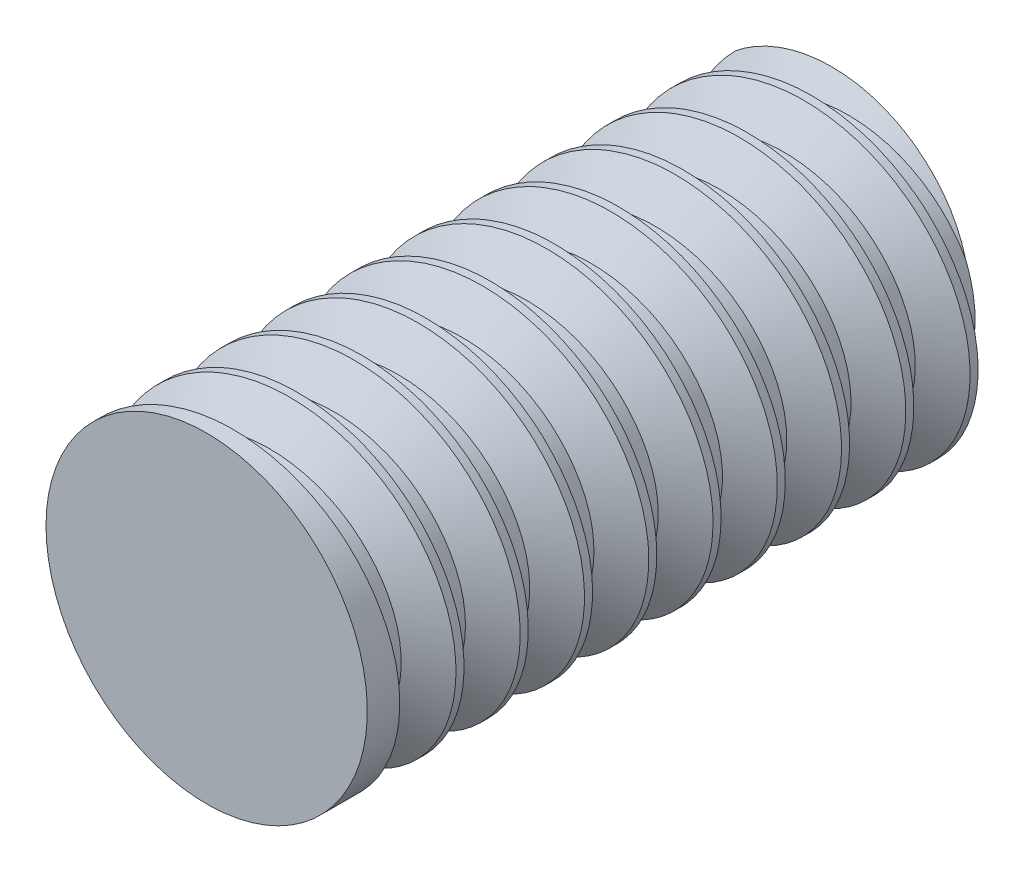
ISO-10303-21;
HEADER;
FILE_DESCRIPTION(('STEP AP214'),'2;1');
FILE_NAME('part.step','',(''),(''),'','','');
FILE_SCHEMA(('AUTOMOTIVE_DESIGN { 1 0 10303 214 1 1 1 1 }'));
ENDSEC;
DATA;
#1=APPLICATION_CONTEXT('core data for automotive mechanical design processes');
#2=APPLICATION_PROTOCOL_DEFINITION('international standard','automotive_design',2000,#1);
#3=PRODUCT_CONTEXT('',#1,'mechanical');
#4=PRODUCT('Part','Part','',(#3));
#5=PRODUCT_RELATED_PRODUCT_CATEGORY('part','',(#4));
#6=PRODUCT_DEFINITION_FORMATION('','',#4);
#7=PRODUCT_DEFINITION_CONTEXT('part definition',#1,'design');
#8=PRODUCT_DEFINITION('design','',#6,#7);
#9=PRODUCT_DEFINITION_SHAPE('','',#8);
#10=(LENGTH_UNIT() NAMED_UNIT(*) SI_UNIT(.MILLI.,.METRE.));
#11=(NAMED_UNIT(*) PLANE_ANGLE_UNIT() SI_UNIT($,.RADIAN.));
#12=(NAMED_UNIT(*) SI_UNIT($,.STERADIAN.) SOLID_ANGLE_UNIT());
#13=UNCERTAINTY_MEASURE_WITH_UNIT(LENGTH_MEASURE(1.E-05),#10,'distance_accuracy_value','');
#14=(GEOMETRIC_REPRESENTATION_CONTEXT(3) GLOBAL_UNCERTAINTY_ASSIGNED_CONTEXT((#13)) GLOBAL_UNIT_ASSIGNED_CONTEXT((#10,
#11,#12)) REPRESENTATION_CONTEXT('',''));
#15=CARTESIAN_POINT('',(0.,0.,0.));
#16=DIRECTION('',(0.,0.,1.));
#17=DIRECTION('',(1.,0.,0.));
#18=AXIS2_PLACEMENT_3D('',#15,#16,#17);
#19=CARTESIAN_POINT('',(0.,0.,6.35));
#20=DIRECTION('',(0.,0.,-1.));
#21=DIRECTION('',(-1.,0.,0.));
#22=AXIS2_PLACEMENT_3D('',#19,#20,#21);
#23=CYLINDRICAL_SURFACE('',#22,3.175);
#24=CARTESIAN_POINT('',(-3.175,0.,6.35));
#25=CARTESIAN_POINT('',(-3.175,1.31512806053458,6.270625));
#26=CARTESIAN_POINT('',(-2.24506403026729,2.24506403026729,6.19125));
#27=CARTESIAN_POINT('',(-1.31512806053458,3.175,6.111875));
#28=CARTESIAN_POINT('',(0.,3.175,6.0325));
#29=CARTESIAN_POINT('',(1.31512806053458,3.175,5.953125));
#30=CARTESIAN_POINT('',(2.24506403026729,2.24506403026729,5.87375));
#31=CARTESIAN_POINT('',(3.175,1.31512806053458,5.794375));
#32=CARTESIAN_POINT('',(3.175,0.,5.715));
#33=CARTESIAN_POINT('',(3.175,-1.31512806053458,5.635625));
#34=CARTESIAN_POINT('',(2.24506403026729,-2.24506403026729,5.55625));
#35=CARTESIAN_POINT('',(1.31512806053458,-3.175,5.476875));
#36=CARTESIAN_POINT('',(0.,-3.175,5.3975));
#37=CARTESIAN_POINT('',(-1.31512806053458,-3.175,5.318125));
#38=CARTESIAN_POINT('',(-2.24506403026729,-2.24506403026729,5.23875));
#39=CARTESIAN_POINT('',(-3.175,-1.31512806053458,5.159375));
#40=CARTESIAN_POINT('',(-3.175,0.,5.08));
#41=CARTESIAN_POINT('',(-3.175,1.31512806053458,5.000625));
#42=CARTESIAN_POINT('',(-2.24506403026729,2.24506403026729,4.92125));
#43=CARTESIAN_POINT('',(-1.31512806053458,3.175,4.841875));
#44=CARTESIAN_POINT('',(0.,3.175,4.7625));
#45=CARTESIAN_POINT('',(1.31512806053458,3.175,4.683125));
#46=CARTESIAN_POINT('',(2.24506403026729,2.24506403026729,4.60375));
#47=CARTESIAN_POINT('',(3.175,1.31512806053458,4.524375));
#48=CARTESIAN_POINT('',(3.175,0.,4.445));
#49=CARTESIAN_POINT('',(3.175,-1.31512806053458,4.365625));
#50=CARTESIAN_POINT('',(2.24506403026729,-2.24506403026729,4.28625));
#51=CARTESIAN_POINT('',(1.31512806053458,-3.175,4.206875));
#52=CARTESIAN_POINT('',(0.,-3.175,4.1275));
#53=CARTESIAN_POINT('',(-1.31512806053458,-3.175,4.048125));
#54=CARTESIAN_POINT('',(-2.24506403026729,-2.24506403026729,3.96875));
#55=CARTESIAN_POINT('',(-3.175,-1.31512806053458,3.889375));
#56=CARTESIAN_POINT('',(-3.175,0.,3.81));
#57=CARTESIAN_POINT('',(-3.175,1.31512806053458,3.730625));
#58=CARTESIAN_POINT('',(-2.24506403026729,2.24506403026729,3.65125));
#59=CARTESIAN_POINT('',(-1.31512806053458,3.175,3.571875));
#60=CARTESIAN_POINT('',(0.,3.175,3.4925));
#61=CARTESIAN_POINT('',(1.31512806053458,3.175,3.413125));
#62=CARTESIAN_POINT('',(2.24506403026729,2.24506403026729,3.33375));
#63=CARTESIAN_POINT('',(3.175,1.31512806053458,3.254375));
#64=CARTESIAN_POINT('',(3.175,0.,3.175));
#65=CARTESIAN_POINT('',(3.175,-1.31512806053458,3.095625));
#66=CARTESIAN_POINT('',(2.24506403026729,-2.24506403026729,3.01625));
#67=CARTESIAN_POINT('',(1.31512806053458,-3.175,2.936875));
#68=CARTESIAN_POINT('',(0.,-3.175,2.8575));
#69=CARTESIAN_POINT('',(-1.31512806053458,-3.175,2.778125));
#70=CARTESIAN_POINT('',(-2.24506403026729,-2.24506403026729,2.69875));
#71=CARTESIAN_POINT('',(-3.175,-1.31512806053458,2.619375));
#72=CARTESIAN_POINT('',(-3.175,0.,2.54));
#73=CARTESIAN_POINT('',(-3.175,1.31512806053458,2.460625));
#74=CARTESIAN_POINT('',(-2.24506403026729,2.24506403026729,2.38125));
#75=CARTESIAN_POINT('',(-1.31512806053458,3.175,2.301875));
#76=CARTESIAN_POINT('',(0.,3.175,2.2225));
#77=CARTESIAN_POINT('',(1.31512806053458,3.175,2.143125));
#78=CARTESIAN_POINT('',(2.24506403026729,2.24506403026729,2.06375));
#79=CARTESIAN_POINT('',(3.175,1.31512806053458,1.984375));
#80=CARTESIAN_POINT('',(3.175,0.,1.905));
#81=CARTESIAN_POINT('',(3.175,-1.31512806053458,1.825625));
#82=CARTESIAN_POINT('',(2.24506403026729,-2.24506403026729,1.74625));
#83=CARTESIAN_POINT('',(1.31512806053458,-3.175,1.666875));
#84=CARTESIAN_POINT('',(0.,-3.175,1.5875));
#85=CARTESIAN_POINT('',(-1.31512806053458,-3.175,1.508125));
#86=CARTESIAN_POINT('',(-2.24506403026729,-2.24506403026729,1.42875));
#87=CARTESIAN_POINT('',(-3.175,-1.31512806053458,1.349375));
#88=CARTESIAN_POINT('',(-3.175,0.,1.27));
#89=CARTESIAN_POINT('',(-3.175,1.31512806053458,1.190625));
#90=CARTESIAN_POINT('',(-2.24506403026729,2.24506403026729,1.11125));
#91=CARTESIAN_POINT('',(-1.31512806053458,3.175,1.031875));
#92=CARTESIAN_POINT('',(0.,3.175,0.952499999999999));
#93=CARTESIAN_POINT('',(1.31512806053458,3.175,0.873125));
#94=CARTESIAN_POINT('',(2.24506403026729,2.24506403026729,0.793749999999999));
#95=CARTESIAN_POINT('',(3.175,1.31512806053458,0.714375));
#96=CARTESIAN_POINT('',(3.175,0.,0.634999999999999));
#97=CARTESIAN_POINT('',(3.175,-1.31512806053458,0.555625));
#98=CARTESIAN_POINT('',(2.24506403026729,-2.24506403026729,0.476249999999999));
#99=CARTESIAN_POINT('',(1.31512806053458,-3.175,0.396875));
#100=CARTESIAN_POINT('',(0.,-3.175,0.317499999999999));
#101=CARTESIAN_POINT('',(-1.31512806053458,-3.175,0.238125));
#102=CARTESIAN_POINT('',(-2.24506403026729,-2.24506403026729,0.158749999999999));
#103=CARTESIAN_POINT('',(-3.175,-1.31512806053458,0.0793749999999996));
#104=CARTESIAN_POINT('',(-3.175,0.,0.));
#105=CARTESIAN_POINT('',(-3.175,1.31512806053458,-0.0793750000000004));
#106=CARTESIAN_POINT('',(-2.24506403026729,2.24506403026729,-0.158750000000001));
#107=CARTESIAN_POINT('',(-1.31512806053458,3.175,-0.238125));
#108=CARTESIAN_POINT('',(0.,3.175,-0.317500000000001));
#109=CARTESIAN_POINT('',(1.31512806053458,3.175,-0.396875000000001));
#110=CARTESIAN_POINT('',(2.24506403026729,2.24506403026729,-0.476250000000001));
#111=CARTESIAN_POINT('',(3.175,1.31512806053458,-0.555625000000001));
#112=CARTESIAN_POINT('',(3.175,0.,-0.635000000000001));
#113=CARTESIAN_POINT('',(3.175,-1.31512806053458,-0.714375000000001));
#114=CARTESIAN_POINT('',(2.24506403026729,-2.24506403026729,-0.793750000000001));
#115=CARTESIAN_POINT('',(1.31512806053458,-3.175,-0.873125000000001));
#116=CARTESIAN_POINT('',(0.,-3.175,-0.952500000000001));
#117=CARTESIAN_POINT('',(-1.31512806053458,-3.175,-1.031875));
#118=CARTESIAN_POINT('',(-2.24506403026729,-2.24506403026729,-1.11125));
#119=CARTESIAN_POINT('',(-3.175,-1.31512806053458,-1.190625));
#120=CARTESIAN_POINT('',(-3.175,0.,-1.27));
#121=CARTESIAN_POINT('',(-3.175,1.31512806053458,-1.349375));
#122=CARTESIAN_POINT('',(-2.24506403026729,2.24506403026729,-1.42875));
#123=CARTESIAN_POINT('',(-1.31512806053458,3.175,-1.508125));
#124=CARTESIAN_POINT('',(0.,3.175,-1.5875));
#125=CARTESIAN_POINT('',(1.31512806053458,3.175,-1.666875));
#126=CARTESIAN_POINT('',(2.24506403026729,2.24506403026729,-1.74625));
#127=CARTESIAN_POINT('',(3.175,1.31512806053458,-1.825625));
#128=CARTESIAN_POINT('',(3.175,0.,-1.905));
#129=CARTESIAN_POINT('',(3.175,-1.31512806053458,-1.984375));
#130=CARTESIAN_POINT('',(2.24506403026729,-2.24506403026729,-2.06375));
#131=CARTESIAN_POINT('',(1.31512806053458,-3.175,-2.143125));
#132=CARTESIAN_POINT('',(0.,-3.175,-2.2225));
#133=CARTESIAN_POINT('',(-1.31512806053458,-3.175,-2.301875));
#134=CARTESIAN_POINT('',(-2.24506403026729,-2.24506403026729,-2.38125));
#135=CARTESIAN_POINT('',(-3.175,-1.31512806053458,-2.460625));
#136=CARTESIAN_POINT('',(-3.175,0.,-2.54));
#137=CARTESIAN_POINT('',(-3.175,1.31512806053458,-2.619375));
#138=CARTESIAN_POINT('',(-2.24506403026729,2.24506403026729,-2.69875));
#139=CARTESIAN_POINT('',(-1.31512806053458,3.175,-2.778125));
#140=CARTESIAN_POINT('',(0.,3.175,-2.8575));
#141=CARTESIAN_POINT('',(1.31512806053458,3.175,-2.936875));
#142=CARTESIAN_POINT('',(2.24506403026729,2.24506403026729,-3.01625));
#143=CARTESIAN_POINT('',(3.175,1.31512806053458,-3.095625));
#144=CARTESIAN_POINT('',(3.175,0.,-3.175));
#145=CARTESIAN_POINT('',(3.175,-1.31512806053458,-3.254375));
#146=CARTESIAN_POINT('',(2.24506403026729,-2.24506403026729,-3.33375));
#147=CARTESIAN_POINT('',(1.31512806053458,-3.175,-3.413125));
#148=CARTESIAN_POINT('',(0.,-3.175,-3.4925));
#149=CARTESIAN_POINT('',(-1.31512806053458,-3.175,-3.571875));
#150=CARTESIAN_POINT('',(-2.24506403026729,-2.24506403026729,-3.65125));
#151=CARTESIAN_POINT('',(-3.175,-1.31512806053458,-3.730625));
#152=CARTESIAN_POINT('',(-3.175,0.,-3.81));
#153=CARTESIAN_POINT('',(-3.175,1.31512806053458,-3.889375));
#154=CARTESIAN_POINT('',(-2.24506403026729,2.24506403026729,-3.96875));
#155=CARTESIAN_POINT('',(-1.31512806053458,3.175,-4.048125));
#156=CARTESIAN_POINT('',(0.,3.175,-4.1275));
#157=CARTESIAN_POINT('',(1.31512806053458,3.175,-4.206875));
#158=CARTESIAN_POINT('',(2.24506403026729,2.24506403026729,-4.28625));
#159=CARTESIAN_POINT('',(3.175,1.31512806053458,-4.365625));
#160=CARTESIAN_POINT('',(3.175,0.,-4.445));
#161=CARTESIAN_POINT('',(3.175,-1.31512806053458,-4.524375));
#162=CARTESIAN_POINT('',(2.24506403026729,-2.24506403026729,-4.60375));
#163=CARTESIAN_POINT('',(1.31512806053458,-3.175,-4.683125));
#164=CARTESIAN_POINT('',(0.,-3.175,-4.7625));
#165=CARTESIAN_POINT('',(-1.31512806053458,-3.175,-4.841875));
#166=CARTESIAN_POINT('',(-2.24506403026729,-2.24506403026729,-4.92125));
#167=CARTESIAN_POINT('',(-3.175,-1.31512806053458,-5.000625));
#168=CARTESIAN_POINT('',(-3.175,0.,-5.08));
#169=CARTESIAN_POINT('',(-3.175,1.31512806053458,-5.159375));
#170=CARTESIAN_POINT('',(-2.24506403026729,2.24506403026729,-5.23875));
#171=CARTESIAN_POINT('',(-1.31512806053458,3.175,-5.318125));
#172=CARTESIAN_POINT('',(0.,3.175,-5.3975));
#173=CARTESIAN_POINT('',(1.31512806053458,3.175,-5.476875));
#174=CARTESIAN_POINT('',(2.24506403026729,2.24506403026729,-5.55625));
#175=CARTESIAN_POINT('',(3.175,1.31512806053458,-5.635625));
#176=CARTESIAN_POINT('',(3.175,0.,-5.715));
#177=CARTESIAN_POINT('',(3.175,-1.31512806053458,-5.794375));
#178=CARTESIAN_POINT('',(2.24506403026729,-2.24506403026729,-5.87375));
#179=CARTESIAN_POINT('',(1.31512806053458,-3.175,-5.953125));
#180=CARTESIAN_POINT('',(0.,-3.175,-6.0325));
#181=CARTESIAN_POINT('',(-1.31512806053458,-3.175,-6.111875));
#182=CARTESIAN_POINT('',(-2.24506403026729,-2.24506403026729,-6.19125));
#183=CARTESIAN_POINT('',(-3.175,-1.31512806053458,-6.270625));
#184=CARTESIAN_POINT('',(-3.175,0.,-6.35));
#185=(BOUNDED_CURVE() B_SPLINE_CURVE(2,(#24,#25,#26,#27,#28,#29,#30,#31,#32,#33,#34,#35,#36,#37,
#38,#39,#40,#41,#42,#43,#44,#45,#46,#47,#48,#49,#50,#51,#52,#53,#54,#55,#56,#57,#58,#59,#60,#61,
#62,#63,#64,#65,#66,#67,#68,#69,#70,#71,#72,#73,#74,#75,#76,#77,#78,#79,#80,#81,#82,#83,#84,#85,
#86,#87,#88,#89,#90,#91,#92,#93,#94,#95,#96,#97,#98,#99,#100,#101,#102,#103,#104,#105,#106,#107,
#108,#109,#110,#111,#112,#113,#114,#115,#116,#117,#118,#119,#120,#121,#122,#123,#124,#125,#126,
#127,#128,#129,#130,#131,#132,#133,#134,#135,#136,#137,#138,#139,#140,#141,#142,#143,#144,#145,
#146,#147,#148,#149,#150,#151,#152,#153,#154,#155,#156,#157,#158,#159,#160,#161,#162,#163,#164,
#165,#166,#167,#168,#169,#170,#171,#172,#173,#174,#175,#176,#177,#178,#179,#180,#181,#182,#183,
#184),.UNSPECIFIED.,.F.,.F.) B_SPLINE_CURVE_WITH_KNOTS((3,2,2,2,2,2,2,2,2,2,2,2,2,2,2,2,2,2,2,2,
2,2,2,2,2,2,2,2,2,2,2,2,2,2,2,2,2,2,2,2,2,2,2,2,2,2,2,2,2,2,2,2,2,2,2,2,2,2,2,2,2,2,2,2,2,2,2,2,
2,2,2,2,2,2,2,2,2,2,2,2,3),(0.,0.0125,0.025,0.0375,0.05,0.0625,0.075,0.0875,0.1,0.1125,0.125,
0.1375,0.15,0.1625,0.175,0.1875,0.2,0.2125,0.225,0.2375,0.25,0.2625,0.275,0.2875,0.3,0.3125,
0.325,0.3375,0.35,0.3625,0.375,0.3875,0.4,0.4125,0.425,0.4375,0.45,0.4625,0.475,0.4875,0.5,
0.5125,0.525,0.5375,0.55,0.5625,0.575,0.5875,0.6,0.6125,0.625,0.6375,0.65,0.6625,0.675,0.6875,
0.7,0.7125,0.725,0.7375,0.75,0.7625,0.775,0.7875,0.8,0.8125,0.825,0.8375,0.85,0.8625,0.875,
0.8875,0.9,0.9125,0.925,0.9375,0.95,0.9625,0.975,0.9875,1.),
.UNSPECIFIED.) CURVE() GEOMETRIC_REPRESENTATION_ITEM() RATIONAL_B_SPLINE_CURVE((1.,
0.923879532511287,1.,0.923879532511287,1.,0.923879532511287,1.,0.923879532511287,1.,
0.923879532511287,1.,0.923879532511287,1.,0.923879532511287,1.,0.923879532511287,1.,
0.923879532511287,1.,0.923879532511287,1.,0.923879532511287,1.,0.923879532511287,1.,
0.923879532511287,1.,0.923879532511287,1.,0.923879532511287,1.,0.923879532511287,1.,
0.923879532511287,1.,0.923879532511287,1.,0.923879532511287,1.,0.923879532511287,1.,
0.923879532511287,1.,0.923879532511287,1.,0.923879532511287,1.,0.923879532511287,1.,
0.923879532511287,1.,0.923879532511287,1.,0.923879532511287,1.,0.923879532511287,1.,
0.923879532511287,1.,0.923879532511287,1.,0.923879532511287,1.,0.923879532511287,1.,
0.923879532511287,1.,0.923879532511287,1.,0.923879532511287,1.,0.923879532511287,1.,
0.923879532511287,1.,0.923879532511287,1.,0.923879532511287,1.,0.923879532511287,1.,
0.923879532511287,1.,0.923879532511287,1.,0.923879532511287,1.,0.923879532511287,1.,
0.923879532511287,1.,0.923879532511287,1.,0.923879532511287,1.,0.923879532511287,1.,
0.923879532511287,1.,0.923879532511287,1.,0.923879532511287,1.,0.923879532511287,1.,
0.923879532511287,1.,0.923879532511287,1.,0.923879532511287,1.,0.923879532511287,1.,
0.923879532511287,1.,0.923879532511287,1.,0.923879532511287,1.,0.923879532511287,1.,
0.923879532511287,1.,0.923879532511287,1.,0.923879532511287,1.,0.923879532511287,1.,
0.923879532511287,1.,0.923879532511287,1.,0.923879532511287,1.,0.923879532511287,1.,
0.923879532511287,1.,0.923879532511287,1.,0.923879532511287,1.,0.923879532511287,1.,
0.923879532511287,1.,0.923879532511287,1.,0.923879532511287,1.,0.923879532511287,1.,
0.923879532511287,1.,0.923879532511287,1.,0.923879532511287,1.,0.923879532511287,1.)) REPRESENTATION_ITEM(''));
#186=CARTESIAN_POINT('',(-3.175,0.,6.35));
#187=VERTEX_POINT('',#186);
#188=CARTESIAN_POINT('',(-3.175,0.,-6.35));
#189=VERTEX_POINT('',#188);
#190=EDGE_CURVE('E84',#187,#189,#185,.T.);
#191=ORIENTED_EDGE('',*,*,#190,.F.);
#192=CARTESIAN_POINT('',(0.,0.,6.35));
#193=DIRECTION('',(0.,0.,1.));
#194=DIRECTION('',(1.,0.,0.));
#195=AXIS2_PLACEMENT_3D('',#192,#193,#194);
#196=CIRCLE('',#195,3.175);
#197=EDGE_CURVE('E97',#187,#187,#196,.T.);
#198=ORIENTED_EDGE('',*,*,#197,.F.);
#199=DIRECTION('',(0.,0.,-1.));
#200=VECTOR('',#199,1.);
#201=CARTESIAN_POINT('',(-3.175,0.,5.7943750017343));
#202=LINE('',#201,#200);
#203=CARTESIAN_POINT('',(-3.175,0.,5.23875000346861));
#204=VERTEX_POINT('',#203);
#205=EDGE_CURVE('E85',#187,#204,#202,.T.);
#206=ORIENTED_EDGE('',*,*,#205,.T.);
#207=CARTESIAN_POINT('',(-3.175,0.,5.23875000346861));
#208=CARTESIAN_POINT('',(-3.175,1.31512806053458,5.15937500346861));
#209=CARTESIAN_POINT('',(-2.24506403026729,2.24506403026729,5.08000000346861));
#210=CARTESIAN_POINT('',(-1.31512806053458,3.175,5.00062500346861));
#211=CARTESIAN_POINT('',(0.,3.175,4.92125000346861));
#212=CARTESIAN_POINT('',(1.31512806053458,3.175,4.84187500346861));
#213=CARTESIAN_POINT('',(2.24506403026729,2.24506403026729,4.76250000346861));
#214=CARTESIAN_POINT('',(3.175,1.31512806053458,4.68312500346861));
#215=CARTESIAN_POINT('',(3.175,0.,4.60375000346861));
#216=CARTESIAN_POINT('',(3.175,-1.31512806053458,4.52437500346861));
#217=CARTESIAN_POINT('',(2.24506403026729,-2.24506403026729,4.44500000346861));
#218=CARTESIAN_POINT('',(1.31512806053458,-3.175,4.36562500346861));
#219=CARTESIAN_POINT('',(0.,-3.175,4.28625000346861));
#220=CARTESIAN_POINT('',(-1.31512806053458,-3.175,4.20687500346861));
#221=CARTESIAN_POINT('',(-2.24506403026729,-2.24506403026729,4.12750000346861));
#222=CARTESIAN_POINT('',(-3.175,-1.31512806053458,4.04812500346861));
#223=CARTESIAN_POINT('',(-3.175,0.,3.96875000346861));
#224=CARTESIAN_POINT('',(-3.175,1.31512806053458,3.88937500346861));
#225=CARTESIAN_POINT('',(-2.24506403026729,2.24506403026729,3.81000000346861));
#226=CARTESIAN_POINT('',(-1.31512806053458,3.175,3.73062500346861));
#227=CARTESIAN_POINT('',(0.,3.175,3.65125000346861));
#228=CARTESIAN_POINT('',(1.31512806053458,3.175,3.57187500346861));
#229=CARTESIAN_POINT('',(2.24506403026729,2.24506403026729,3.49250000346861));
#230=CARTESIAN_POINT('',(3.175,1.31512806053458,3.41312500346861));
#231=CARTESIAN_POINT('',(3.175,0.,3.33375000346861));
#232=CARTESIAN_POINT('',(3.175,-1.31512806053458,3.25437500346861));
#233=CARTESIAN_POINT('',(2.24506403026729,-2.24506403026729,3.17500000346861));
#234=CARTESIAN_POINT('',(1.31512806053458,-3.175,3.09562500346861));
#235=CARTESIAN_POINT('',(0.,-3.175,3.01625000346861));
#236=CARTESIAN_POINT('',(-1.31512806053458,-3.175,2.93687500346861));
#237=CARTESIAN_POINT('',(-2.24506403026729,-2.24506403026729,2.85750000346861));
#238=CARTESIAN_POINT('',(-3.175,-1.31512806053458,2.77812500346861));
#239=CARTESIAN_POINT('',(-3.175,0.,2.69875000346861));
#240=CARTESIAN_POINT('',(-3.175,1.31512806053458,2.61937500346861));
#241=CARTESIAN_POINT('',(-2.24506403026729,2.24506403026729,2.54000000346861));
#242=CARTESIAN_POINT('',(-1.31512806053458,3.175,2.46062500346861));
#243=CARTESIAN_POINT('',(0.,3.175,2.38125000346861));
#244=CARTESIAN_POINT('',(1.31512806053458,3.175,2.30187500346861));
#245=CARTESIAN_POINT('',(2.24506403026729,2.24506403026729,2.22250000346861));
#246=CARTESIAN_POINT('',(3.175,1.31512806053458,2.14312500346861));
#247=CARTESIAN_POINT('',(3.175,0.,2.06375000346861));
#248=CARTESIAN_POINT('',(3.175,-1.31512806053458,1.98437500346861));
#249=CARTESIAN_POINT('',(2.24506403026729,-2.24506403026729,1.90500000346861));
#250=CARTESIAN_POINT('',(1.31512806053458,-3.175,1.82562500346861));
#251=CARTESIAN_POINT('',(0.,-3.175,1.74625000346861));
#252=CARTESIAN_POINT('',(-1.31512806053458,-3.175,1.66687500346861));
#253=CARTESIAN_POINT('',(-2.24506403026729,-2.24506403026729,1.58750000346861));
#254=CARTESIAN_POINT('',(-3.175,-1.31512806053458,1.50812500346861));
#255=CARTESIAN_POINT('',(-3.175,0.,1.42875000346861));
#256=CARTESIAN_POINT('',(-3.175,1.31512806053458,1.34937500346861));
#257=CARTESIAN_POINT('',(-2.24506403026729,2.24506403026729,1.27000000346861));
#258=CARTESIAN_POINT('',(-1.31512806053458,3.175,1.19062500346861));
#259=CARTESIAN_POINT('',(0.,3.175,1.11125000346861));
#260=CARTESIAN_POINT('',(1.31512806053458,3.175,1.03187500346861));
#261=CARTESIAN_POINT('',(2.24506403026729,2.24506403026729,0.952500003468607));
#262=CARTESIAN_POINT('',(3.175,1.31512806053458,0.873125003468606));
#263=CARTESIAN_POINT('',(3.175,0.,0.793750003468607));
#264=CARTESIAN_POINT('',(3.175,-1.31512806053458,0.714375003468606));
#265=CARTESIAN_POINT('',(2.24506403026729,-2.24506403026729,0.635000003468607));
#266=CARTESIAN_POINT('',(1.31512806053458,-3.175,0.555625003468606));
#267=CARTESIAN_POINT('',(0.,-3.175,0.476250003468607));
#268=CARTESIAN_POINT('',(-1.31512806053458,-3.175,0.396875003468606));
#269=CARTESIAN_POINT('',(-2.24506403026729,-2.24506403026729,0.317500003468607));
#270=CARTESIAN_POINT('',(-3.175,-1.31512806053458,0.238125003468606));
#271=CARTESIAN_POINT('',(-3.175,0.,0.158750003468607));
#272=CARTESIAN_POINT('',(-3.175,1.31512806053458,0.0793750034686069));
#273=CARTESIAN_POINT('',(-2.24506403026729,2.24506403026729,3.4686064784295E-09));
#274=CARTESIAN_POINT('',(-1.31512806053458,3.175,-0.0793749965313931));
#275=CARTESIAN_POINT('',(0.,3.175,-0.158749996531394));
#276=CARTESIAN_POINT('',(1.31512806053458,3.175,-0.238124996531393));
#277=CARTESIAN_POINT('',(2.24506403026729,2.24506403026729,-0.317499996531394));
#278=CARTESIAN_POINT('',(3.175,1.31512806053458,-0.396874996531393));
#279=CARTESIAN_POINT('',(3.175,0.,-0.476249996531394));
#280=CARTESIAN_POINT('',(3.175,-1.31512806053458,-0.555624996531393));
#281=CARTESIAN_POINT('',(2.24506403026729,-2.24506403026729,-0.634999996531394));
#282=CARTESIAN_POINT('',(1.31512806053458,-3.175,-0.714374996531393));
#283=CARTESIAN_POINT('',(0.,-3.175,-0.793749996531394));
#284=CARTESIAN_POINT('',(-1.31512806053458,-3.175,-0.873124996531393));
#285=CARTESIAN_POINT('',(-2.24506403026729,-2.24506403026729,-0.952499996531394));
#286=CARTESIAN_POINT('',(-3.175,-1.31512806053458,-1.03187499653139));
#287=CARTESIAN_POINT('',(-3.175,0.,-1.11124999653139));
#288=CARTESIAN_POINT('',(-3.175,1.31512806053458,-1.19062499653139));
#289=CARTESIAN_POINT('',(-2.24506403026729,2.24506403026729,-1.26999999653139));
#290=CARTESIAN_POINT('',(-1.31512806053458,3.175,-1.34937499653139));
#291=CARTESIAN_POINT('',(0.,3.175,-1.42874999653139));
#292=CARTESIAN_POINT('',(1.31512806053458,3.175,-1.50812499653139));
#293=CARTESIAN_POINT('',(2.24506403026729,2.24506403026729,-1.58749999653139));
#294=CARTESIAN_POINT('',(3.175,1.31512806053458,-1.66687499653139));
#295=CARTESIAN_POINT('',(3.175,0.,-1.74624999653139));
#296=CARTESIAN_POINT('',(3.175,-1.31512806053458,-1.82562499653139));
#297=CARTESIAN_POINT('',(2.24506403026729,-2.24506403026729,-1.90499999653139));
#298=CARTESIAN_POINT('',(1.31512806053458,-3.175,-1.98437499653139));
#299=CARTESIAN_POINT('',(0.,-3.175,-2.06374999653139));
#300=CARTESIAN_POINT('',(-1.31512806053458,-3.175,-2.14312499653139));
#301=CARTESIAN_POINT('',(-2.24506403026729,-2.24506403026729,-2.22249999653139));
#302=CARTESIAN_POINT('',(-3.175,-1.31512806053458,-2.30187499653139));
#303=CARTESIAN_POINT('',(-3.175,0.,-2.38124999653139));
#304=CARTESIAN_POINT('',(-3.175,1.31512806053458,-2.46062499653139));
#305=CARTESIAN_POINT('',(-2.24506403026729,2.24506403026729,-2.53999999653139));
#306=CARTESIAN_POINT('',(-1.31512806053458,3.175,-2.61937499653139));
#307=CARTESIAN_POINT('',(0.,3.175,-2.69874999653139));
#308=CARTESIAN_POINT('',(1.31512806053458,3.175,-2.77812499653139));
#309=CARTESIAN_POINT('',(2.24506403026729,2.24506403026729,-2.85749999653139));
#310=CARTESIAN_POINT('',(3.175,1.31512806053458,-2.93687499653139));
#311=CARTESIAN_POINT('',(3.175,0.,-3.01624999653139));
#312=CARTESIAN_POINT('',(3.175,-1.31512806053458,-3.09562499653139));
#313=CARTESIAN_POINT('',(2.24506403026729,-2.24506403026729,-3.17499999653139));
#314=CARTESIAN_POINT('',(1.31512806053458,-3.175,-3.25437499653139));
#315=CARTESIAN_POINT('',(0.,-3.175,-3.33374999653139));
#316=CARTESIAN_POINT('',(-1.31512806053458,-3.175,-3.41312499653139));
#317=CARTESIAN_POINT('',(-2.24506403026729,-2.24506403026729,-3.49249999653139));
#318=CARTESIAN_POINT('',(-3.175,-1.31512806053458,-3.57187499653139));
#319=CARTESIAN_POINT('',(-3.175,0.,-3.65124999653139));
#320=CARTESIAN_POINT('',(-3.175,1.31512806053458,-3.73062499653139));
#321=CARTESIAN_POINT('',(-2.24506403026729,2.24506403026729,-3.80999999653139));
#322=CARTESIAN_POINT('',(-1.31512806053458,3.175,-3.88937499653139));
#323=CARTESIAN_POINT('',(0.,3.175,-3.96874999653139));
#324=CARTESIAN_POINT('',(1.31512806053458,3.175,-4.04812499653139));
#325=CARTESIAN_POINT('',(2.24506403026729,2.24506403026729,-4.12749999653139));
#326=CARTESIAN_POINT('',(3.175,1.31512806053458,-4.20687499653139));
#327=CARTESIAN_POINT('',(3.175,0.,-4.28624999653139));
#328=CARTESIAN_POINT('',(3.175,-1.31512806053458,-4.36562499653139));
#329=CARTESIAN_POINT('',(2.24506403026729,-2.24506403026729,-4.44499999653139));
#330=CARTESIAN_POINT('',(1.31512806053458,-3.175,-4.52437499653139));
#331=CARTESIAN_POINT('',(0.,-3.175,-4.60374999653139));
#332=CARTESIAN_POINT('',(-1.31512806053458,-3.175,-4.68312499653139));
#333=CARTESIAN_POINT('',(-2.24506403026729,-2.24506403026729,-4.76249999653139));
#334=CARTESIAN_POINT('',(-3.175,-1.31512806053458,-4.84187499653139));
#335=CARTESIAN_POINT('',(-3.175,0.,-4.92124999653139));
#336=CARTESIAN_POINT('',(-3.175,1.31512806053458,-5.00062499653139));
#337=CARTESIAN_POINT('',(-2.24506403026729,2.24506403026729,-5.07999999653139));
#338=CARTESIAN_POINT('',(-1.31512806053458,3.175,-5.15937499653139));
#339=CARTESIAN_POINT('',(0.,3.175,-5.23874999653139));
#340=CARTESIAN_POINT('',(1.31512806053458,3.175,-5.31812499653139));
#341=CARTESIAN_POINT('',(2.24506403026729,2.24506403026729,-5.39749999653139));
#342=CARTESIAN_POINT('',(3.175,1.31512806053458,-5.47687499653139));
#343=CARTESIAN_POINT('',(3.175,0.,-5.55624999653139));
#344=CARTESIAN_POINT('',(3.175,-1.31512806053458,-5.63562499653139));
#345=CARTESIAN_POINT('',(2.24506403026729,-2.24506403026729,-5.71499999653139));
#346=CARTESIAN_POINT('',(1.31512806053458,-3.175,-5.79437499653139));
#347=CARTESIAN_POINT('',(0.,-3.175,-5.87374999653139));
#348=CARTESIAN_POINT('',(-1.31512806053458,-3.175,-5.95312499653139));
#349=CARTESIAN_POINT('',(-2.24506403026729,-2.24506403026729,-6.03249999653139));
#350=CARTESIAN_POINT('',(-3.175,-1.31512806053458,-6.11187499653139));
#351=CARTESIAN_POINT('',(-3.175,0.,-6.19124999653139));
#352=CARTESIAN_POINT('',(-3.175,1.31512806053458,-6.27062499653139));
#353=CARTESIAN_POINT('',(-2.24506403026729,2.24506403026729,-6.34999999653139));
#354=CARTESIAN_POINT('',(-1.31512806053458,3.175,-6.42937499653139));
#355=CARTESIAN_POINT('',(0.,3.175,-6.50874999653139));
#356=CARTESIAN_POINT('',(1.31512806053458,3.175,-6.58812499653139));
#357=CARTESIAN_POINT('',(2.24506403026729,2.24506403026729,-6.66749999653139));
#358=CARTESIAN_POINT('',(3.175,1.31512806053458,-6.74687499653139));
#359=CARTESIAN_POINT('',(3.175,0.,-6.82624999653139));
#360=CARTESIAN_POINT('',(3.175,-1.31512806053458,-6.90562499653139));
#361=CARTESIAN_POINT('',(2.24506403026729,-2.24506403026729,-6.98499999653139));
#362=CARTESIAN_POINT('',(1.31512806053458,-3.175,-7.0643749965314));
#363=CARTESIAN_POINT('',(0.,-3.175,-7.14374999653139));
#364=CARTESIAN_POINT('',(-1.31512806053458,-3.175,-7.22312499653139));
#365=CARTESIAN_POINT('',(-2.24506403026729,-2.24506403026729,-7.30249999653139));
#366=CARTESIAN_POINT('',(-3.175,-1.31512806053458,-7.3818749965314));
#367=CARTESIAN_POINT('',(-3.175,0.,-7.46124999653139));
#368=(BOUNDED_CURVE() B_SPLINE_CURVE(2,(#207,#208,#209,#210,#211,#212,#213,#214,#215,#216,#217,
#218,#219,#220,#221,#222,#223,#224,#225,#226,#227,#228,#229,#230,#231,#232,#233,#234,#235,#236,
#237,#238,#239,#240,#241,#242,#243,#244,#245,#246,#247,#248,#249,#250,#251,#252,#253,#254,#255,
#256,#257,#258,#259,#260,#261,#262,#263,#264,#265,#266,#267,#268,#269,#270,#271,#272,#273,#274,
#275,#276,#277,#278,#279,#280,#281,#282,#283,#284,#285,#286,#287,#288,#289,#290,#291,#292,#293,
#294,#295,#296,#297,#298,#299,#300,#301,#302,#303,#304,#305,#306,#307,#308,#309,#310,#311,#312,
#313,#314,#315,#316,#317,#318,#319,#320,#321,#322,#323,#324,#325,#326,#327,#328,#329,#330,#331,
#332,#333,#334,#335,#336,#337,#338,#339,#340,#341,#342,#343,#344,#345,#346,#347,#348,#349,#350,
#351,#352,#353,#354,#355,#356,#357,#358,#359,#360,#361,#362,#363,#364,#365,#366,#367),
.UNSPECIFIED.,.F.,.F.) B_SPLINE_CURVE_WITH_KNOTS((3,2,2,2,2,2,2,2,2,2,2,2,2,2,2,2,2,2,2,2,2,2,2,
2,2,2,2,2,2,2,2,2,2,2,2,2,2,2,2,2,2,2,2,2,2,2,2,2,2,2,2,2,2,2,2,2,2,2,2,2,2,2,2,2,2,2,2,2,2,2,2,
2,2,2,2,2,2,2,2,2,3),(0.,0.0125,0.025,0.0375,0.05,0.0625,0.075,0.0875,0.1,0.1125,0.125,0.1375,
0.15,0.1625,0.175,0.1875,0.2,0.2125,0.225,0.2375,0.25,0.2625,0.275,0.2875,0.3,0.3125,0.325,
0.3375,0.35,0.3625,0.375,0.3875,0.4,0.4125,0.425,0.4375,0.45,0.4625,0.475,0.4875,0.5,0.5125,
0.525,0.5375,0.55,0.5625,0.575,0.5875,0.6,0.6125,0.625,0.6375,0.65,0.6625,0.675,0.6875,0.7,
0.7125,0.725,0.7375,0.75,0.7625,0.775,0.7875,0.8,0.8125,0.825,0.8375,0.85,0.8625,0.875,0.8875,
0.9,0.9125,0.925,0.9375,0.95,0.9625,0.975,0.9875,1.),
.UNSPECIFIED.) CURVE() GEOMETRIC_REPRESENTATION_ITEM() RATIONAL_B_SPLINE_CURVE((1.,
0.923879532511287,1.,0.923879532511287,1.,0.923879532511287,1.,0.923879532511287,1.,
0.923879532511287,1.,0.923879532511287,1.,0.923879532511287,1.,0.923879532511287,1.,
0.923879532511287,1.,0.923879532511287,1.,0.923879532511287,1.,0.923879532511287,1.,
0.923879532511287,1.,0.923879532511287,1.,0.923879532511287,1.,0.923879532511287,1.,
0.923879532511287,1.,0.923879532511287,1.,0.923879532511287,1.,0.923879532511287,1.,
0.923879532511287,1.,0.923879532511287,1.,0.923879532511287,1.,0.923879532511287,1.,
0.923879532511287,1.,0.923879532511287,1.,0.923879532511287,1.,0.923879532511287,1.,
0.923879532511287,1.,0.923879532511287,1.,0.923879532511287,1.,0.923879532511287,1.,
0.923879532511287,1.,0.923879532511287,1.,0.923879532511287,1.,0.923879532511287,1.,
0.923879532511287,1.,0.923879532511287,1.,0.923879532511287,1.,0.923879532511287,1.,
0.923879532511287,1.,0.923879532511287,1.,0.923879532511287,1.,0.923879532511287,1.,
0.923879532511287,1.,0.923879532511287,1.,0.923879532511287,1.,0.923879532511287,1.,
0.923879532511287,1.,0.923879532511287,1.,0.923879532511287,1.,0.923879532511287,1.,
0.923879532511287,1.,0.923879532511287,1.,0.923879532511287,1.,0.923879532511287,1.,
0.923879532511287,1.,0.923879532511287,1.,0.923879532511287,1.,0.923879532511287,1.,
0.923879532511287,1.,0.923879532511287,1.,0.923879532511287,1.,0.923879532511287,1.,
0.923879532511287,1.,0.923879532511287,1.,0.923879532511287,1.,0.923879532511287,1.,
0.923879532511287,1.,0.923879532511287,1.,0.923879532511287,1.,0.923879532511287,1.,
0.923879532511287,1.,0.923879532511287,1.,0.923879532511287,1.,0.923879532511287,1.,
0.923879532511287,1.,0.923879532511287,1.,0.923879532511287,1.,0.923879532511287,1.)) REPRESENTATION_ITEM(''));
#369=CARTESIAN_POINT('',(-2.24506398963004,2.24506407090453,-6.35));
#370=VERTEX_POINT('',#369);
#371=EDGE_CURVE('E74',#204,#370,#368,.T.);
#372=ORIENTED_EDGE('',*,*,#371,.T.);
#373=CARTESIAN_POINT('',(0.,0.,-6.35));
#374=DIRECTION('',(0.,0.,1.));
#375=DIRECTION('',(1.,0.,0.));
#376=AXIS2_PLACEMENT_3D('',#373,#374,#375);
#377=CIRCLE('',#376,3.175);
#378=EDGE_CURVE('E102',#370,#189,#377,.T.);
#379=ORIENTED_EDGE('',*,*,#378,.T.);
#380=EDGE_LOOP('',(#191,#198,#206,#372,#379));
#381=FACE_BOUND('',#380,.T.);
#382=ADVANCED_FACE('F33',(#381),#23,.T.);
#383=CARTESIAN_POINT('',(0.,0.,6.35));
#384=DIRECTION('',(0.,0.,1.));
#385=DIRECTION('',(1.,0.,0.));
#386=AXIS2_PLACEMENT_3D('',#383,#384,#385);
#387=PLANE('',#386);
#388=ORIENTED_EDGE('',*,*,#197,.T.);
#389=EDGE_LOOP('',(#388));
#390=FACE_BOUND('',#389,.T.);
#391=ADVANCED_FACE('F151',(#390),#387,.T.);
#392=CARTESIAN_POINT('',(0.,0.,-6.35));
#393=DIRECTION('',(0.,0.,1.));
#394=DIRECTION('',(1.,0.,0.));
#395=AXIS2_PLACEMENT_3D('',#392,#393,#394);
#396=PLANE('',#395);
#397=CARTESIAN_POINT('',(-3.175,0.,-6.35));
#398=CARTESIAN_POINT('',(-3.16759465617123,-0.0708563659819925,-6.35));
#399=CARTESIAN_POINT('',(-3.15768795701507,-0.14143319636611,-6.35));
#400=CARTESIAN_POINT('',(-3.13292627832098,-0.281702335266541,-6.35));
#401=CARTESIAN_POINT('',(-3.11807204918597,-0.35139477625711,-6.35));
#402=CARTESIAN_POINT('',(-3.06619277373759,-0.558579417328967,-6.35));
#403=CARTESIAN_POINT('',(-3.02183915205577,-0.694292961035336,-6.35));
#404=CARTESIAN_POINT('',(-2.9039732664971,-0.983677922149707,-6.35));
#405=CARTESIAN_POINT('',(-2.82648335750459,-1.13575384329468,-6.35));
#406=CARTESIAN_POINT('',(-2.6919763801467,-1.35238007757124,-6.35));
#407=CARTESIAN_POINT('',(-2.64404346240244,-1.4227329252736,-6.35));
#408=CARTESIAN_POINT('',(-2.54239293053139,-1.55915857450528,-6.35));
#409=CARTESIAN_POINT('',(-2.48867512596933,-1.62523123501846,-6.35));
#410=CARTESIAN_POINT('',(-2.37591880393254,-1.75251951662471,-6.35));
#411=CARTESIAN_POINT('',(-2.31688743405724,-1.81374146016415,-6.35));
#412=CARTESIAN_POINT('',(-2.22463837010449,-1.90165788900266,-6.35));
#413=CARTESIAN_POINT('',(-2.19326809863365,-1.9303134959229,-6.35));
#414=CARTESIAN_POINT('',(-2.12935318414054,-1.98628772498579,-6.35));
#415=CARTESIAN_POINT('',(-2.09680853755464,-2.01360634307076,-6.35));
#416=CARTESIAN_POINT('',(-2.03059404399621,-2.06678309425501,-6.35));
#417=CARTESIAN_POINT('',(-1.99692527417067,-2.09264256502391,-6.35));
#418=CARTESIAN_POINT('',(-1.92841446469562,-2.14275081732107,-6.35));
#419=CARTESIAN_POINT('',(-1.89357246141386,-2.1669996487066,-6.35));
#420=CARTESIAN_POINT('',(-1.78743369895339,-2.2372861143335,-6.35));
#421=CARTESIAN_POINT('',(-1.714498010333,-2.2808847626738,-6.35));
#422=CARTESIAN_POINT('',(-1.56811636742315,-2.3594130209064,-6.35));
#423=CARTESIAN_POINT('',(-1.49482572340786,-2.3946337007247,-6.35));
#424=CARTESIAN_POINT('',(-1.34539774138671,-2.45844140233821,-6.35));
#425=CARTESIAN_POINT('',(-1.26926011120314,-2.48702774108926,-6.35));
#426=CARTESIAN_POINT('',(-1.11468051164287,-2.53734762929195,-6.35));
#427=CARTESIAN_POINT('',(-1.03623657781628,-2.55907514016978,-6.35));
#428=CARTESIAN_POINT('',(-0.877726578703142,-2.59546810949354,-6.35));
#429=CARTESIAN_POINT('',(-0.797660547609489,-2.61013371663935,-6.35));
#430=CARTESIAN_POINT('',(-0.6406565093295,-2.63172020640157,-6.35));
#431=CARTESIAN_POINT('',(-0.563767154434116,-2.63899783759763,-6.35));
#432=CARTESIAN_POINT('',(-0.409622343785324,-2.64703873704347,-6.35));
#433=CARTESIAN_POINT('',(-0.332366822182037,-2.64780078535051,-6.35));
#434=CARTESIAN_POINT('',(-0.216725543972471,-2.64405331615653,-6.35));
#435=CARTESIAN_POINT('',(-0.178245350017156,-2.64199218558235,-6.35));
#436=CARTESIAN_POINT('',(-0.10140583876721,-2.63625873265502,-6.35));
#437=CARTESIAN_POINT('',(-0.0630465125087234,-2.63258653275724,-6.35));
#438=CARTESIAN_POINT('',(0.0134664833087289,-2.62360093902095,-6.35));
#439=CARTESIAN_POINT('',(0.0516202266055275,-2.61828817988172,-6.35));
#440=CARTESIAN_POINT('',(0.127639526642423,-2.6058584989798,-6.35));
#441=CARTESIAN_POINT('',(0.165505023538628,-2.5987412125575,-6.35));
#442=CARTESIAN_POINT('',(0.26888734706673,-2.57680624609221,-6.35));
#443=CARTESIAN_POINT('',(0.334033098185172,-2.56019751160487,-6.35));
#444=CARTESIAN_POINT('',(0.462758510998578,-2.52172282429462,-6.35));
#445=CARTESIAN_POINT('',(0.526337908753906,-2.49985599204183,-6.35));
#446=CARTESIAN_POINT('',(0.65171278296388,-2.45092581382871,-6.35));
#447=CARTESIAN_POINT('',(0.71350155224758,-2.42384526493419,-6.35));
#448=CARTESIAN_POINT('',(0.834653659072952,-2.36471879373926,-6.35));
#449=CARTESIAN_POINT('',(0.894017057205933,-2.33267299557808,-6.35));
#450=CARTESIAN_POINT('',(0.951960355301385,-2.29823565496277,-6.35));
#451=B_SPLINE_CURVE_WITH_KNOTS('',3,(#397,#398,#399,#400,#401,#402,#403,#404,#405,#406,#407,
#408,#409,#410,#411,#412,#413,#414,#415,#416,#417,#418,#419,#420,#421,#422,#423,#424,#425,#426,
#427,#428,#429,#430,#431,#432,#433,#434,#435,#436,#437,#438,#439,#440,#441,#442,#443,#444,#445,
#446,#447,#448,#449,#450),.UNSPECIFIED.,.F.,.F.,(4,2,2,2,2,2,2,2,2,2,2,2,2,2,2,2,2,2,2,2,2,2,2,
2,2,2,4),(0.,0.213646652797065,0.427260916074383,0.854148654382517,1.36350220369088,
1.61864325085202,1.8737926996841,2.12860391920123,2.25603701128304,2.38347049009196,
2.51078518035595,2.63809592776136,2.89261704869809,3.13624977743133,3.37990757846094,
3.62377930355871,3.86764589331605,4.0990786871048,4.33055481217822,4.44613290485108,
4.56170221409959,4.67722686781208,4.79277488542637,4.99422513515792,5.19570910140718,
5.3978696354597,5.60002511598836),.UNSPECIFIED.);
#452=CARTESIAN_POINT('',(0.951960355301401,-2.29823565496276,-6.35));
#453=VERTEX_POINT('',#452);
#454=EDGE_CURVE('E11',#189,#453,#451,.T.);
#455=ORIENTED_EDGE('',*,*,#454,.F.);
#456=ORIENTED_EDGE('',*,*,#378,.F.);
#457=CARTESIAN_POINT('',(2.29823565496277,0.951960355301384,-6.35));
#458=CARTESIAN_POINT('',(2.28110721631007,1.01927962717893,-6.35));
#459=CARTESIAN_POINT('',(2.26111537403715,1.08586924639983,-6.35));
#460=CARTESIAN_POINT('',(2.2155850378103,1.21713230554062,-6.35));
#461=CARTESIAN_POINT('',(2.19004598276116,1.28180555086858,-6.35));
#462=CARTESIAN_POINT('',(2.13373076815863,1.40848208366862,-6.35));
#463=CARTESIAN_POINT('',(2.102978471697,1.4704959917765,-6.35));
#464=CARTESIAN_POINT('',(2.03638049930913,1.59171850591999,-6.35));
#465=CARTESIAN_POINT('',(2.00053589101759,1.65092769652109,-6.35));
#466=CARTESIAN_POINT('',(1.94316279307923,1.73733805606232,-6.35));
#467=CARTESIAN_POINT('',(1.92343183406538,1.76574796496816,-6.35));
#468=CARTESIAN_POINT('',(1.88278212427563,1.82169705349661,-6.35));
#469=CARTESIAN_POINT('',(1.86186363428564,1.84923642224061,-6.35));
#470=CARTESIAN_POINT('',(1.81898125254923,1.90349786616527,-6.35));
#471=CARTESIAN_POINT('',(1.79701710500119,1.93021973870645,-6.35));
#472=CARTESIAN_POINT('',(1.75209760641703,1.98281775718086,-6.35));
#473=CARTESIAN_POINT('',(1.72914218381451,2.00869384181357,-6.35));
#474=CARTESIAN_POINT('',(1.65876251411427,2.08506179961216,-6.35));
#475=CARTESIAN_POINT('',(1.60987833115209,2.13422573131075,-6.35000000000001));
#476=CARTESIAN_POINT('',(1.50855089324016,2.22869041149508,-6.34999999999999));
#477=CARTESIAN_POINT('',(1.45610798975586,2.27399154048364,-6.34999999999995));
#478=CARTESIAN_POINT('',(1.28453771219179,2.41116481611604,-6.34999999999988));
#479=CARTESIAN_POINT('',(1.15921366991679,2.49547514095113,-6.34999999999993));
#480=CARTESIAN_POINT('',(0.896536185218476,2.64230371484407,-6.35000000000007));
#481=CARTESIAN_POINT('',(0.759192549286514,2.70483952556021,-6.35000000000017));
#482=CARTESIAN_POINT('',(0.545316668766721,2.78176540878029,-6.35000000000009));
#483=CARTESIAN_POINT('',(0.471776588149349,2.8047650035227,-6.35000000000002));
#484=CARTESIAN_POINT('',(0.323026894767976,2.84450749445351,-6.34999999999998));
#485=CARTESIAN_POINT('',(0.247817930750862,2.86125277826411,-6.35));
#486=CARTESIAN_POINT('',(0.134138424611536,2.88160739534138,-6.35));
#487=CARTESIAN_POINT('',(0.0960784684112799,2.88760048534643,-6.35));
#488=CARTESIAN_POINT('',(0.01974552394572,2.89797242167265,-6.35));
#489=CARTESIAN_POINT('',(-0.0185274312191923,2.90235151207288,-6.35));
#490=CARTESIAN_POINT('',(-0.133568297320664,2.91330130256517,-6.35));
#491=CARTESIAN_POINT('',(-0.210553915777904,2.91768378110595,-6.35));
#492=CARTESIAN_POINT('',(-0.366854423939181,2.92057548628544,-6.35));
#493=CARTESIAN_POINT('',(-0.446172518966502,2.91891186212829,-6.35));
#494=CARTESIAN_POINT('',(-0.604405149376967,2.90935309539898,-6.35));
#495=CARTESIAN_POINT('',(-0.683319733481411,2.90145872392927,-6.35));
#496=CARTESIAN_POINT('',(-0.918793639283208,2.86846295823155,-6.35));
#497=CARTESIAN_POINT('',(-1.07415308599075,2.83405015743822,-6.35));
#498=CARTESIAN_POINT('',(-1.38818177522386,2.73799691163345,-6.35));
#499=CARTESIAN_POINT('',(-1.5463116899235,2.67460736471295,-6.35));
#500=CARTESIAN_POINT('',(-1.8494788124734,2.52226646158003,-6.35));
#501=CARTESIAN_POINT('',(-1.99454109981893,2.43336550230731,-6.35));
#502=CARTESIAN_POINT('',(-2.16973729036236,2.30466851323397,-6.35));
#503=CARTESIAN_POINT('',(-2.20777198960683,2.27530655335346,-6.35));
#504=CARTESIAN_POINT('',(-2.24506398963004,2.24506407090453,-6.35));
#505=B_SPLINE_CURVE_WITH_KNOTS('',3,(#457,#458,#459,#460,#461,#462,#463,#464,#465,#466,#467,
#468,#469,#470,#471,#472,#473,#474,#475,#476,#477,#478,#479,#480,#481,#482,#483,#484,#485,#486,
#487,#488,#489,#490,#491,#492,#493,#494,#495,#496,#497,#498,#499,#500,#501,#502,#503,#504),
.UNSPECIFIED.,.F.,.F.,(4,2,2,2,2,2,2,2,2,2,2,2,2,2,2,2,2,2,2,2,2,2,2,4),(0.,0.208329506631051,
0.416680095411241,0.624101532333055,0.831479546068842,0.935222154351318,1.03894206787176,
1.14268748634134,1.24644040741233,1.45420427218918,1.66194764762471,2.11288072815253,
2.56344927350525,2.79438325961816,3.02522899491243,3.14078669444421,3.2563269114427,
3.48742037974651,3.72517183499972,3.96289387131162,4.43813032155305,4.94688354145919,
5.45463857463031,5.5987268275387),.UNSPECIFIED.);
#506=CARTESIAN_POINT('',(2.29823565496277,0.951960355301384,-6.35));
#507=VERTEX_POINT('',#506);
#508=EDGE_CURVE('E79',#507,#370,#505,.T.);
#509=ORIENTED_EDGE('',*,*,#508,.F.);
#510=CARTESIAN_POINT('',(0.951960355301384,-2.29823565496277,-6.35));
#511=CARTESIAN_POINT('',(1.05082238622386,-2.25731866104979,-6.35));
#512=CARTESIAN_POINT('',(1.14697982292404,-2.20998390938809,-6.35));
#513=CARTESIAN_POINT('',(1.33251483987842,-2.10331746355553,-6.35));
#514=CARTESIAN_POINT('',(1.42188595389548,-2.04397452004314,-6.35));
#515=CARTESIAN_POINT('',(1.61831796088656,-1.89438668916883,-6.35));
#516=CARTESIAN_POINT('',(1.72244063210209,-1.80023995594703,-6.35));
#517=CARTESIAN_POINT('',(1.91341068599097,-1.59579416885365,-6.35));
#518=CARTESIAN_POINT('',(2.00025250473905,-1.48548993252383,-6.35));
#519=CARTESIAN_POINT('',(2.15417878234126,-1.25187435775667,-6.35));
#520=CARTESIAN_POINT('',(2.2212657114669,-1.12856464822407,-6.35));
#521=CARTESIAN_POINT('',(2.33377888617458,-0.872442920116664,-6.35));
#522=CARTESIAN_POINT('',(2.37920667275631,-0.739631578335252,-6.35));
#523=CARTESIAN_POINT('',(2.44712339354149,-0.468259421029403,-6.35));
#524=CARTESIAN_POINT('',(2.46961100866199,-0.329698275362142,-6.35));
#525=CARTESIAN_POINT('',(2.4910043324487,-0.0507725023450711,-6.35));
#526=CARTESIAN_POINT('',(2.48991107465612,0.0895920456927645,-6.35));
#527=CARTESIAN_POINT('',(2.46557244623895,0.352989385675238,-6.35));
#528=CARTESIAN_POINT('',(2.44475000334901,0.476246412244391,-6.35));
#529=CARTESIAN_POINT('',(2.39989384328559,0.657660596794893,-6.35));
#530=CARTESIAN_POINT('',(2.38266519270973,0.717568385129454,-6.35));
#531=CARTESIAN_POINT('',(2.34376111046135,0.835929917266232,-6.35));
#532=CARTESIAN_POINT('',(2.32208516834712,0.894383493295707,-6.35));
#533=CARTESIAN_POINT('',(2.29823565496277,0.951960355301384,-6.35));
#534=B_SPLINE_CURVE_WITH_KNOTS('',3,(#510,#511,#512,#513,#514,#515,#516,#517,#518,#519,#520,
#521,#522,#523,#524,#525,#526,#527,#528,#529,#530,#531,#532,#533),.UNSPECIFIED.,.F.,.F.,(4,2,2,
2,2,2,2,2,2,2,2,4),(0.,0.320679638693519,0.641661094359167,1.06071473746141,1.47990308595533,
1.89903899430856,2.31814507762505,2.73727525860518,3.15638706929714,3.52990257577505,
3.71675641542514,3.90363171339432),.UNSPECIFIED.);
#535=EDGE_CURVE('E44',#453,#507,#534,.T.);
#536=ORIENTED_EDGE('',*,*,#535,.F.);
#537=EDGE_LOOP('',(#455,#456,#509,#536));
#538=FACE_BOUND('',#537,.T.);
#539=ADVANCED_FACE('F113',(#538),#396,.F.);
#540=CARTESIAN_POINT('',(-2.48759233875,0.,5.9531250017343));
#541=CARTESIAN_POINT('',(-2.48759233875,1.03039448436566,5.8737500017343));
#542=CARTESIAN_POINT('',(-1.75899341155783,1.75899341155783,5.7943750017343));
#543=CARTESIAN_POINT('',(-1.03039448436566,2.48759233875,5.7150000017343));
#544=CARTESIAN_POINT('',(0.,2.48759233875,5.6356250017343));
#545=CARTESIAN_POINT('',(1.03039448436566,2.48759233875,5.5562500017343));
#546=CARTESIAN_POINT('',(1.75899341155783,1.75899341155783,5.4768750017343));
#547=CARTESIAN_POINT('',(2.48759233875,1.03039448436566,5.3975000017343));
#548=CARTESIAN_POINT('',(2.48759233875,0.,5.3181250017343));
#549=CARTESIAN_POINT('',(2.48759233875,-1.03039448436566,5.2387500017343));
#550=CARTESIAN_POINT('',(1.75899341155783,-1.75899341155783,5.1593750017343));
#551=CARTESIAN_POINT('',(1.03039448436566,-2.48759233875,5.0800000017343));
#552=CARTESIAN_POINT('',(0.,-2.48759233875,5.0006250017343));
#553=CARTESIAN_POINT('',(-1.03039448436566,-2.48759233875,4.9212500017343));
#554=CARTESIAN_POINT('',(-1.75899341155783,-1.75899341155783,4.8418750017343));
#555=CARTESIAN_POINT('',(-2.48759233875,-1.03039448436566,4.7625000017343));
#556=CARTESIAN_POINT('',(-2.48759233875,0.,4.6831250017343));
#557=CARTESIAN_POINT('',(-2.48759233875,1.03039448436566,4.6037500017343));
#558=CARTESIAN_POINT('',(-1.75899341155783,1.75899341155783,4.5243750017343));
#559=CARTESIAN_POINT('',(-1.03039448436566,2.48759233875,4.4450000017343));
#560=CARTESIAN_POINT('',(0.,2.48759233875,4.3656250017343));
#561=CARTESIAN_POINT('',(1.03039448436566,2.48759233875,4.2862500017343));
#562=CARTESIAN_POINT('',(1.75899341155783,1.75899341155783,4.2068750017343));
#563=CARTESIAN_POINT('',(2.48759233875,1.03039448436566,4.1275000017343));
#564=CARTESIAN_POINT('',(2.48759233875,0.,4.0481250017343));
#565=CARTESIAN_POINT('',(2.48759233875,-1.03039448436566,3.9687500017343));
#566=CARTESIAN_POINT('',(1.75899341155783,-1.75899341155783,3.8893750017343));
#567=CARTESIAN_POINT('',(1.03039448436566,-2.48759233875,3.8100000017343));
#568=CARTESIAN_POINT('',(0.,-2.48759233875,3.7306250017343));
#569=CARTESIAN_POINT('',(-1.03039448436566,-2.48759233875,3.6512500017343));
#570=CARTESIAN_POINT('',(-1.75899341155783,-1.75899341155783,3.5718750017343));
#571=CARTESIAN_POINT('',(-2.48759233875,-1.03039448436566,3.4925000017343));
#572=CARTESIAN_POINT('',(-2.48759233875,0.,3.4131250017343));
#573=CARTESIAN_POINT('',(-2.48759233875,1.03039448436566,3.3337500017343));
#574=CARTESIAN_POINT('',(-1.75899341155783,1.75899341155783,3.2543750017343));
#575=CARTESIAN_POINT('',(-1.03039448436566,2.48759233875,3.1750000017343));
#576=CARTESIAN_POINT('',(0.,2.48759233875,3.0956250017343));
#577=CARTESIAN_POINT('',(1.03039448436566,2.48759233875,3.0162500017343));
#578=CARTESIAN_POINT('',(1.75899341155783,1.75899341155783,2.9368750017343));
#579=CARTESIAN_POINT('',(2.48759233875,1.03039448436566,2.8575000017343));
#580=CARTESIAN_POINT('',(2.48759233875,0.,2.7781250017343));
#581=CARTESIAN_POINT('',(2.48759233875,-1.03039448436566,2.6987500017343));
#582=CARTESIAN_POINT('',(1.75899341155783,-1.75899341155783,2.6193750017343));
#583=CARTESIAN_POINT('',(1.03039448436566,-2.48759233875,2.5400000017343));
#584=CARTESIAN_POINT('',(0.,-2.48759233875,2.4606250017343));
#585=CARTESIAN_POINT('',(-1.03039448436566,-2.48759233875,2.3812500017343));
#586=CARTESIAN_POINT('',(-1.75899341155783,-1.75899341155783,2.3018750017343));
#587=CARTESIAN_POINT('',(-2.48759233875,-1.03039448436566,2.2225000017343));
#588=CARTESIAN_POINT('',(-2.48759233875,0.,2.1431250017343));
#589=CARTESIAN_POINT('',(-2.48759233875,1.03039448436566,2.0637500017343));
#590=CARTESIAN_POINT('',(-1.75899341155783,1.75899341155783,1.9843750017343));
#591=CARTESIAN_POINT('',(-1.03039448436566,2.48759233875,1.9050000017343));
#592=CARTESIAN_POINT('',(0.,2.48759233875,1.8256250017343));
#593=CARTESIAN_POINT('',(1.03039448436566,2.48759233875,1.7462500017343));
#594=CARTESIAN_POINT('',(1.75899341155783,1.75899341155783,1.6668750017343));
#595=CARTESIAN_POINT('',(2.48759233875,1.03039448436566,1.5875000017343));
#596=CARTESIAN_POINT('',(2.48759233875,0.,1.5081250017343));
#597=CARTESIAN_POINT('',(2.48759233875,-1.03039448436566,1.4287500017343));
#598=CARTESIAN_POINT('',(1.75899341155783,-1.75899341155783,1.3493750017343));
#599=CARTESIAN_POINT('',(1.03039448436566,-2.48759233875,1.2700000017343));
#600=CARTESIAN_POINT('',(0.,-2.48759233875,1.1906250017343));
#601=CARTESIAN_POINT('',(-1.03039448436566,-2.48759233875,1.1112500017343));
#602=CARTESIAN_POINT('',(-1.75899341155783,-1.75899341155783,1.0318750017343));
#603=CARTESIAN_POINT('',(-2.48759233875,-1.03039448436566,0.952500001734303));
#604=CARTESIAN_POINT('',(-2.48759233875,0.,0.873125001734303));
#605=CARTESIAN_POINT('',(-2.48759233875,1.03039448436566,0.793750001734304));
#606=CARTESIAN_POINT('',(-1.75899341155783,1.75899341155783,0.714375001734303));
#607=CARTESIAN_POINT('',(-1.03039448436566,2.48759233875,0.635000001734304));
#608=CARTESIAN_POINT('',(0.,2.48759233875,0.555625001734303));
#609=CARTESIAN_POINT('',(1.03039448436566,2.48759233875,0.476250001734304));
#610=CARTESIAN_POINT('',(1.75899341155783,1.75899341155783,0.396875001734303));
#611=CARTESIAN_POINT('',(2.48759233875,1.03039448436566,0.317500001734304));
#612=CARTESIAN_POINT('',(2.48759233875,0.,0.238125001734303));
#613=CARTESIAN_POINT('',(2.48759233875,-1.03039448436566,0.158750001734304));
#614=CARTESIAN_POINT('',(1.75899341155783,-1.75899341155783,0.0793750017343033));
#615=CARTESIAN_POINT('',(1.03039448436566,-2.48759233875,1.73430367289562E-09));
#616=CARTESIAN_POINT('',(0.,-2.48759233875,-0.0793749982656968));
#617=CARTESIAN_POINT('',(-1.03039448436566,-2.48759233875,-0.158749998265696));
#618=CARTESIAN_POINT('',(-1.75899341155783,-1.75899341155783,-0.238124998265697));
#619=CARTESIAN_POINT('',(-2.48759233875,-1.03039448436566,-0.317499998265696));
#620=CARTESIAN_POINT('',(-2.48759233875,0.,-0.396874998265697));
#621=CARTESIAN_POINT('',(-2.48759233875,1.03039448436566,-0.476249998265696));
#622=CARTESIAN_POINT('',(-1.75899341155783,1.75899341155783,-0.555624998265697));
#623=CARTESIAN_POINT('',(-1.03039448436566,2.48759233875,-0.634999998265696));
#624=CARTESIAN_POINT('',(0.,2.48759233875,-0.714374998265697));
#625=CARTESIAN_POINT('',(1.03039448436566,2.48759233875,-0.793749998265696));
#626=CARTESIAN_POINT('',(1.75899341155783,1.75899341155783,-0.873124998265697));
#627=CARTESIAN_POINT('',(2.48759233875,1.03039448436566,-0.952499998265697));
#628=CARTESIAN_POINT('',(2.48759233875,0.,-1.0318749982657));
#629=CARTESIAN_POINT('',(2.48759233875,-1.03039448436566,-1.1112499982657));
#630=CARTESIAN_POINT('',(1.75899341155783,-1.75899341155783,-1.1906249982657));
#631=CARTESIAN_POINT('',(1.03039448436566,-2.48759233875,-1.2699999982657));
#632=CARTESIAN_POINT('',(0.,-2.48759233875,-1.3493749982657));
#633=CARTESIAN_POINT('',(-1.03039448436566,-2.48759233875,-1.4287499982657));
#634=CARTESIAN_POINT('',(-1.75899341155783,-1.75899341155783,-1.5081249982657));
#635=CARTESIAN_POINT('',(-2.48759233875,-1.03039448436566,-1.5874999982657));
#636=CARTESIAN_POINT('',(-2.48759233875,0.,-1.6668749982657));
#637=CARTESIAN_POINT('',(-2.48759233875,1.03039448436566,-1.7462499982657));
#638=CARTESIAN_POINT('',(-1.75899341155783,1.75899341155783,-1.8256249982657));
#639=CARTESIAN_POINT('',(-1.03039448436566,2.48759233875,-1.9049999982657));
#640=CARTESIAN_POINT('',(0.,2.48759233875,-1.9843749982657));
#641=CARTESIAN_POINT('',(1.03039448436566,2.48759233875,-2.0637499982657));
#642=CARTESIAN_POINT('',(1.75899341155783,1.75899341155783,-2.1431249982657));
#643=CARTESIAN_POINT('',(2.48759233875,1.03039448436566,-2.2224999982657));
#644=CARTESIAN_POINT('',(2.48759233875,0.,-2.3018749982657));
#645=CARTESIAN_POINT('',(2.48759233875,-1.03039448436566,-2.3812499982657));
#646=CARTESIAN_POINT('',(1.75899341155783,-1.75899341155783,-2.4606249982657));
#647=CARTESIAN_POINT('',(1.03039448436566,-2.48759233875,-2.5399999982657));
#648=CARTESIAN_POINT('',(0.,-2.48759233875,-2.6193749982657));
#649=CARTESIAN_POINT('',(-1.03039448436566,-2.48759233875,-2.6987499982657));
#650=CARTESIAN_POINT('',(-1.75899341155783,-1.75899341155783,-2.7781249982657));
#651=CARTESIAN_POINT('',(-2.48759233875,-1.03039448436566,-2.8574999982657));
#652=CARTESIAN_POINT('',(-2.48759233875,0.,-2.9368749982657));
#653=CARTESIAN_POINT('',(-2.48759233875,1.03039448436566,-3.0162499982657));
#654=CARTESIAN_POINT('',(-1.75899341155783,1.75899341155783,-3.0956249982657));
#655=CARTESIAN_POINT('',(-1.03039448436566,2.48759233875,-3.1749999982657));
#656=CARTESIAN_POINT('',(0.,2.48759233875,-3.2543749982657));
#657=CARTESIAN_POINT('',(1.03039448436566,2.48759233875,-3.3337499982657));
#658=CARTESIAN_POINT('',(1.75899341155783,1.75899341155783,-3.4131249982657));
#659=CARTESIAN_POINT('',(2.48759233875,1.03039448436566,-3.4924999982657));
#660=CARTESIAN_POINT('',(2.48759233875,0.,-3.5718749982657));
#661=CARTESIAN_POINT('',(2.48759233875,-1.03039448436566,-3.6512499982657));
#662=CARTESIAN_POINT('',(1.75899341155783,-1.75899341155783,-3.7306249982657));
#663=CARTESIAN_POINT('',(1.03039448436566,-2.48759233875,-3.8099999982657));
#664=CARTESIAN_POINT('',(0.,-2.48759233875,-3.8893749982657));
#665=CARTESIAN_POINT('',(-1.03039448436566,-2.48759233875,-3.9687499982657));
#666=CARTESIAN_POINT('',(-1.75899341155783,-1.75899341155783,-4.0481249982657));
#667=CARTESIAN_POINT('',(-2.48759233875,-1.03039448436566,-4.1274999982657));
#668=CARTESIAN_POINT('',(-2.48759233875,0.,-4.2068749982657));
#669=CARTESIAN_POINT('',(-2.48759233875,1.03039448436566,-4.2862499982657));
#670=CARTESIAN_POINT('',(-1.75899341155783,1.75899341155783,-4.3656249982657));
#671=CARTESIAN_POINT('',(-1.03039448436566,2.48759233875,-4.4449999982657));
#672=CARTESIAN_POINT('',(0.,2.48759233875,-4.5243749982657));
#673=CARTESIAN_POINT('',(1.03039448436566,2.48759233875,-4.6037499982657));
#674=CARTESIAN_POINT('',(1.75899341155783,1.75899341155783,-4.6831249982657));
#675=CARTESIAN_POINT('',(2.48759233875,1.03039448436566,-4.7624999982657));
#676=CARTESIAN_POINT('',(2.48759233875,0.,-4.8418749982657));
#677=CARTESIAN_POINT('',(2.48759233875,-1.03039448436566,-4.9212499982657));
#678=CARTESIAN_POINT('',(1.75899341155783,-1.75899341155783,-5.0006249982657));
#679=CARTESIAN_POINT('',(1.03039448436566,-2.48759233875,-5.0799999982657));
#680=CARTESIAN_POINT('',(0.,-2.48759233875,-5.1593749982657));
#681=CARTESIAN_POINT('',(-1.03039448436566,-2.48759233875,-5.2387499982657));
#682=CARTESIAN_POINT('',(-1.75899341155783,-1.75899341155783,-5.3181249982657));
#683=CARTESIAN_POINT('',(-2.48759233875,-1.03039448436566,-5.3974999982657));
#684=CARTESIAN_POINT('',(-2.48759233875,0.,-5.4768749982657));
#685=CARTESIAN_POINT('',(-2.48759233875,1.03039448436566,-5.5562499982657));
#686=CARTESIAN_POINT('',(-1.75899341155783,1.75899341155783,-5.6356249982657));
#687=CARTESIAN_POINT('',(-1.03039448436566,2.48759233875,-5.7149999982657));
#688=CARTESIAN_POINT('',(0.,2.48759233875,-5.7943749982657));
#689=CARTESIAN_POINT('',(1.03039448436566,2.48759233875,-5.8737499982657));
#690=CARTESIAN_POINT('',(1.75899341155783,1.75899341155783,-5.9531249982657));
#691=CARTESIAN_POINT('',(2.48759233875,1.03039448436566,-6.0324999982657));
#692=CARTESIAN_POINT('',(2.48759233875,0.,-6.1118749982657));
#693=CARTESIAN_POINT('',(2.48759233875,-1.03039448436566,-6.1912499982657));
#694=CARTESIAN_POINT('',(1.75899341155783,-1.75899341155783,-6.2706249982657));
#695=CARTESIAN_POINT('',(1.03039448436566,-2.48759233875,-6.3499999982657));
#696=CARTESIAN_POINT('',(0.,-2.48759233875,-6.4293749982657));
#697=CARTESIAN_POINT('',(-1.03039448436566,-2.48759233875,-6.5087499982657));
#698=CARTESIAN_POINT('',(-1.75899341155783,-1.75899341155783,-6.5881249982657));
#699=CARTESIAN_POINT('',(-2.48759233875,-1.03039448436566,-6.6674999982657));
#700=CARTESIAN_POINT('',(-2.48759233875,0.,-6.7468749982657));
#701=CARTESIAN_POINT('',(-3.175,0.,6.35));
#702=CARTESIAN_POINT('',(-3.175,1.31512806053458,6.270625));
#703=CARTESIAN_POINT('',(-2.24506403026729,2.24506403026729,6.19125));
#704=CARTESIAN_POINT('',(-1.31512806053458,3.175,6.111875));
#705=CARTESIAN_POINT('',(0.,3.175,6.0325));
#706=CARTESIAN_POINT('',(1.31512806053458,3.175,5.953125));
#707=CARTESIAN_POINT('',(2.24506403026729,2.24506403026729,5.87375));
#708=CARTESIAN_POINT('',(3.175,1.31512806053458,5.794375));
#709=CARTESIAN_POINT('',(3.175,0.,5.715));
#710=CARTESIAN_POINT('',(3.175,-1.31512806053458,5.635625));
#711=CARTESIAN_POINT('',(2.24506403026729,-2.24506403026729,5.55625));
#712=CARTESIAN_POINT('',(1.31512806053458,-3.175,5.476875));
#713=CARTESIAN_POINT('',(0.,-3.175,5.3975));
#714=CARTESIAN_POINT('',(-1.31512806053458,-3.175,5.318125));
#715=CARTESIAN_POINT('',(-2.24506403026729,-2.24506403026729,5.23875));
#716=CARTESIAN_POINT('',(-3.175,-1.31512806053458,5.159375));
#717=CARTESIAN_POINT('',(-3.175,0.,5.08));
#718=CARTESIAN_POINT('',(-3.175,1.31512806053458,5.000625));
#719=CARTESIAN_POINT('',(-2.24506403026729,2.24506403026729,4.92125));
#720=CARTESIAN_POINT('',(-1.31512806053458,3.175,4.841875));
#721=CARTESIAN_POINT('',(0.,3.175,4.7625));
#722=CARTESIAN_POINT('',(1.31512806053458,3.175,4.683125));
#723=CARTESIAN_POINT('',(2.24506403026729,2.24506403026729,4.60375));
#724=CARTESIAN_POINT('',(3.175,1.31512806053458,4.524375));
#725=CARTESIAN_POINT('',(3.175,0.,4.445));
#726=CARTESIAN_POINT('',(3.175,-1.31512806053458,4.365625));
#727=CARTESIAN_POINT('',(2.24506403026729,-2.24506403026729,4.28625));
#728=CARTESIAN_POINT('',(1.31512806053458,-3.175,4.206875));
#729=CARTESIAN_POINT('',(0.,-3.175,4.1275));
#730=CARTESIAN_POINT('',(-1.31512806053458,-3.175,4.048125));
#731=CARTESIAN_POINT('',(-2.24506403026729,-2.24506403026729,3.96875));
#732=CARTESIAN_POINT('',(-3.175,-1.31512806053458,3.889375));
#733=CARTESIAN_POINT('',(-3.175,0.,3.81));
#734=CARTESIAN_POINT('',(-3.175,1.31512806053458,3.730625));
#735=CARTESIAN_POINT('',(-2.24506403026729,2.24506403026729,3.65125));
#736=CARTESIAN_POINT('',(-1.31512806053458,3.175,3.571875));
#737=CARTESIAN_POINT('',(0.,3.175,3.4925));
#738=CARTESIAN_POINT('',(1.31512806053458,3.175,3.413125));
#739=CARTESIAN_POINT('',(2.24506403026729,2.24506403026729,3.33375));
#740=CARTESIAN_POINT('',(3.175,1.31512806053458,3.254375));
#741=CARTESIAN_POINT('',(3.175,0.,3.175));
#742=CARTESIAN_POINT('',(3.175,-1.31512806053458,3.095625));
#743=CARTESIAN_POINT('',(2.24506403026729,-2.24506403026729,3.01625));
#744=CARTESIAN_POINT('',(1.31512806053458,-3.175,2.936875));
#745=CARTESIAN_POINT('',(0.,-3.175,2.8575));
#746=CARTESIAN_POINT('',(-1.31512806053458,-3.175,2.778125));
#747=CARTESIAN_POINT('',(-2.24506403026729,-2.24506403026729,2.69875));
#748=CARTESIAN_POINT('',(-3.175,-1.31512806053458,2.619375));
#749=CARTESIAN_POINT('',(-3.175,0.,2.54));
#750=CARTESIAN_POINT('',(-3.175,1.31512806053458,2.460625));
#751=CARTESIAN_POINT('',(-2.24506403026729,2.24506403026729,2.38125));
#752=CARTESIAN_POINT('',(-1.31512806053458,3.175,2.301875));
#753=CARTESIAN_POINT('',(0.,3.175,2.2225));
#754=CARTESIAN_POINT('',(1.31512806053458,3.175,2.143125));
#755=CARTESIAN_POINT('',(2.24506403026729,2.24506403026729,2.06375));
#756=CARTESIAN_POINT('',(3.175,1.31512806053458,1.984375));
#757=CARTESIAN_POINT('',(3.175,0.,1.905));
#758=CARTESIAN_POINT('',(3.175,-1.31512806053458,1.825625));
#759=CARTESIAN_POINT('',(2.24506403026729,-2.24506403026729,1.74625));
#760=CARTESIAN_POINT('',(1.31512806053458,-3.175,1.666875));
#761=CARTESIAN_POINT('',(0.,-3.175,1.5875));
#762=CARTESIAN_POINT('',(-1.31512806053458,-3.175,1.508125));
#763=CARTESIAN_POINT('',(-2.24506403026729,-2.24506403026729,1.42875));
#764=CARTESIAN_POINT('',(-3.175,-1.31512806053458,1.349375));
#765=CARTESIAN_POINT('',(-3.175,0.,1.27));
#766=CARTESIAN_POINT('',(-3.175,1.31512806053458,1.190625));
#767=CARTESIAN_POINT('',(-2.24506403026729,2.24506403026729,1.11125));
#768=CARTESIAN_POINT('',(-1.31512806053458,3.175,1.031875));
#769=CARTESIAN_POINT('',(0.,3.175,0.952499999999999));
#770=CARTESIAN_POINT('',(1.31512806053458,3.175,0.873125));
#771=CARTESIAN_POINT('',(2.24506403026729,2.24506403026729,0.793749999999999));
#772=CARTESIAN_POINT('',(3.175,1.31512806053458,0.714375));
#773=CARTESIAN_POINT('',(3.175,0.,0.634999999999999));
#774=CARTESIAN_POINT('',(3.175,-1.31512806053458,0.555625));
#775=CARTESIAN_POINT('',(2.24506403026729,-2.24506403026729,0.476249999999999));
#776=CARTESIAN_POINT('',(1.31512806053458,-3.175,0.396875));
#777=CARTESIAN_POINT('',(0.,-3.175,0.317499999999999));
#778=CARTESIAN_POINT('',(-1.31512806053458,-3.175,0.238125));
#779=CARTESIAN_POINT('',(-2.24506403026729,-2.24506403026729,0.158749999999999));
#780=CARTESIAN_POINT('',(-3.175,-1.31512806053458,0.0793749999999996));
#781=CARTESIAN_POINT('',(-3.175,0.,0.));
#782=CARTESIAN_POINT('',(-3.175,1.31512806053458,-0.0793750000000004));
#783=CARTESIAN_POINT('',(-2.24506403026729,2.24506403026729,-0.158750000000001));
#784=CARTESIAN_POINT('',(-1.31512806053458,3.175,-0.238125));
#785=CARTESIAN_POINT('',(0.,3.175,-0.317500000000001));
#786=CARTESIAN_POINT('',(1.31512806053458,3.175,-0.396875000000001));
#787=CARTESIAN_POINT('',(2.24506403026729,2.24506403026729,-0.476250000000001));
#788=CARTESIAN_POINT('',(3.175,1.31512806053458,-0.555625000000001));
#789=CARTESIAN_POINT('',(3.175,0.,-0.635000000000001));
#790=CARTESIAN_POINT('',(3.175,-1.31512806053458,-0.714375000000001));
#791=CARTESIAN_POINT('',(2.24506403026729,-2.24506403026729,-0.793750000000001));
#792=CARTESIAN_POINT('',(1.31512806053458,-3.175,-0.873125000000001));
#793=CARTESIAN_POINT('',(0.,-3.175,-0.952500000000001));
#794=CARTESIAN_POINT('',(-1.31512806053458,-3.175,-1.031875));
#795=CARTESIAN_POINT('',(-2.24506403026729,-2.24506403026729,-1.11125));
#796=CARTESIAN_POINT('',(-3.175,-1.31512806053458,-1.190625));
#797=CARTESIAN_POINT('',(-3.175,0.,-1.27));
#798=CARTESIAN_POINT('',(-3.175,1.31512806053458,-1.349375));
#799=CARTESIAN_POINT('',(-2.24506403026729,2.24506403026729,-1.42875));
#800=CARTESIAN_POINT('',(-1.31512806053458,3.175,-1.508125));
#801=CARTESIAN_POINT('',(0.,3.175,-1.5875));
#802=CARTESIAN_POINT('',(1.31512806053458,3.175,-1.666875));
#803=CARTESIAN_POINT('',(2.24506403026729,2.24506403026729,-1.74625));
#804=CARTESIAN_POINT('',(3.175,1.31512806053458,-1.825625));
#805=CARTESIAN_POINT('',(3.175,0.,-1.905));
#806=CARTESIAN_POINT('',(3.175,-1.31512806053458,-1.984375));
#807=CARTESIAN_POINT('',(2.24506403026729,-2.24506403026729,-2.06375));
#808=CARTESIAN_POINT('',(1.31512806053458,-3.175,-2.143125));
#809=CARTESIAN_POINT('',(0.,-3.175,-2.2225));
#810=CARTESIAN_POINT('',(-1.31512806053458,-3.175,-2.301875));
#811=CARTESIAN_POINT('',(-2.24506403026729,-2.24506403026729,-2.38125));
#812=CARTESIAN_POINT('',(-3.175,-1.31512806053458,-2.460625));
#813=CARTESIAN_POINT('',(-3.175,0.,-2.54));
#814=CARTESIAN_POINT('',(-3.175,1.31512806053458,-2.619375));
#815=CARTESIAN_POINT('',(-2.24506403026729,2.24506403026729,-2.69875));
#816=CARTESIAN_POINT('',(-1.31512806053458,3.175,-2.778125));
#817=CARTESIAN_POINT('',(0.,3.175,-2.8575));
#818=CARTESIAN_POINT('',(1.31512806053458,3.175,-2.936875));
#819=CARTESIAN_POINT('',(2.24506403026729,2.24506403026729,-3.01625));
#820=CARTESIAN_POINT('',(3.175,1.31512806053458,-3.095625));
#821=CARTESIAN_POINT('',(3.175,0.,-3.175));
#822=CARTESIAN_POINT('',(3.175,-1.31512806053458,-3.254375));
#823=CARTESIAN_POINT('',(2.24506403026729,-2.24506403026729,-3.33375));
#824=CARTESIAN_POINT('',(1.31512806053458,-3.175,-3.413125));
#825=CARTESIAN_POINT('',(0.,-3.175,-3.4925));
#826=CARTESIAN_POINT('',(-1.31512806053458,-3.175,-3.571875));
#827=CARTESIAN_POINT('',(-2.24506403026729,-2.24506403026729,-3.65125));
#828=CARTESIAN_POINT('',(-3.175,-1.31512806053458,-3.730625));
#829=CARTESIAN_POINT('',(-3.175,0.,-3.81));
#830=CARTESIAN_POINT('',(-3.175,1.31512806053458,-3.889375));
#831=CARTESIAN_POINT('',(-2.24506403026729,2.24506403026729,-3.96875));
#832=CARTESIAN_POINT('',(-1.31512806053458,3.175,-4.048125));
#833=CARTESIAN_POINT('',(0.,3.175,-4.1275));
#834=CARTESIAN_POINT('',(1.31512806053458,3.175,-4.206875));
#835=CARTESIAN_POINT('',(2.24506403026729,2.24506403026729,-4.28625));
#836=CARTESIAN_POINT('',(3.175,1.31512806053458,-4.365625));
#837=CARTESIAN_POINT('',(3.175,0.,-4.445));
#838=CARTESIAN_POINT('',(3.175,-1.31512806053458,-4.524375));
#839=CARTESIAN_POINT('',(2.24506403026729,-2.24506403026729,-4.60375));
#840=CARTESIAN_POINT('',(1.31512806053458,-3.175,-4.683125));
#841=CARTESIAN_POINT('',(0.,-3.175,-4.7625));
#842=CARTESIAN_POINT('',(-1.31512806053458,-3.175,-4.841875));
#843=CARTESIAN_POINT('',(-2.24506403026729,-2.24506403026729,-4.92125));
#844=CARTESIAN_POINT('',(-3.175,-1.31512806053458,-5.000625));
#845=CARTESIAN_POINT('',(-3.175,0.,-5.08));
#846=CARTESIAN_POINT('',(-3.175,1.31512806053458,-5.159375));
#847=CARTESIAN_POINT('',(-2.24506403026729,2.24506403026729,-5.23875));
#848=CARTESIAN_POINT('',(-1.31512806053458,3.175,-5.318125));
#849=CARTESIAN_POINT('',(0.,3.175,-5.3975));
#850=CARTESIAN_POINT('',(1.31512806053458,3.175,-5.476875));
#851=CARTESIAN_POINT('',(2.24506403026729,2.24506403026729,-5.55625));
#852=CARTESIAN_POINT('',(3.175,1.31512806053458,-5.635625));
#853=CARTESIAN_POINT('',(3.175,0.,-5.715));
#854=CARTESIAN_POINT('',(3.175,-1.31512806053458,-5.794375));
#855=CARTESIAN_POINT('',(2.24506403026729,-2.24506403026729,-5.87375));
#856=CARTESIAN_POINT('',(1.31512806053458,-3.175,-5.953125));
#857=CARTESIAN_POINT('',(0.,-3.175,-6.0325));
#858=CARTESIAN_POINT('',(-1.31512806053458,-3.175,-6.111875));
#859=CARTESIAN_POINT('',(-2.24506403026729,-2.24506403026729,-6.19125));
#860=CARTESIAN_POINT('',(-3.175,-1.31512806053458,-6.270625));
#861=CARTESIAN_POINT('',(-3.175,0.,-6.35));
#862=(BOUNDED_SURFACE() B_SPLINE_SURFACE(1,2,((#540,#541,#542,#543,#544,#545,#546,#547,#548,
#549,#550,#551,#552,#553,#554,#555,#556,#557,#558,#559,#560,#561,#562,#563,#564,#565,#566,#567,
#568,#569,#570,#571,#572,#573,#574,#575,#576,#577,#578,#579,#580,#581,#582,#583,#584,#585,#586,
#587,#588,#589,#590,#591,#592,#593,#594,#595,#596,#597,#598,#599,#600,#601,#602,#603,#604,#605,
#606,#607,#608,#609,#610,#611,#612,#613,#614,#615,#616,#617,#618,#619,#620,#621,#622,#623,#624,
#625,#626,#627,#628,#629,#630,#631,#632,#633,#634,#635,#636,#637,#638,#639,#640,#641,#642,#643,
#644,#645,#646,#647,#648,#649,#650,#651,#652,#653,#654,#655,#656,#657,#658,#659,#660,#661,#662,
#663,#664,#665,#666,#667,#668,#669,#670,#671,#672,#673,#674,#675,#676,#677,#678,#679,#680,#681,
#682,#683,#684,#685,#686,#687,#688,#689,#690,#691,#692,#693,#694,#695,#696,#697,#698,#699,#700),
(#701,#702,#703,#704,#705,#706,#707,#708,#709,#710,#711,#712,#713,#714,#715,#716,#717,#718,#719,
#720,#721,#722,#723,#724,#725,#726,#727,#728,#729,#730,#731,#732,#733,#734,#735,#736,#737,#738,
#739,#740,#741,#742,#743,#744,#745,#746,#747,#748,#749,#750,#751,#752,#753,#754,#755,#756,#757,
#758,#759,#760,#761,#762,#763,#764,#765,#766,#767,#768,#769,#770,#771,#772,#773,#774,#775,#776,
#777,#778,#779,#780,#781,#782,#783,#784,#785,#786,#787,#788,#789,#790,#791,#792,#793,#794,#795,
#796,#797,#798,#799,#800,#801,#802,#803,#804,#805,#806,#807,#808,#809,#810,#811,#812,#813,#814,
#815,#816,#817,#818,#819,#820,#821,#822,#823,#824,#825,#826,#827,#828,#829,#830,#831,#832,#833,
#834,#835,#836,#837,#838,#839,#840,#841,#842,#843,#844,#845,#846,#847,#848,#849,#850,#851,#852,
#853,#854,#855,#856,#857,#858,#859,#860,#861)),.UNSPECIFIED.,.F.,.F.,
.F.) B_SPLINE_SURFACE_WITH_KNOTS((2,2),(3,2,2,2,2,2,2,2,2,2,2,2,2,2,2,2,2,2,2,2,2,2,2,2,2,2,2,2,
2,2,2,2,2,2,2,2,2,2,2,2,2,2,2,2,2,2,2,2,2,2,2,2,2,2,2,2,2,2,2,2,2,2,2,2,2,2,2,2,2,2,2,2,2,2,2,2,
2,2,2,2,3),(0.,1.),(0.,0.0125,0.025,0.0375,0.05,0.0625,0.075,0.0875,0.1,0.1125,0.125,0.1375,
0.15,0.1625,0.175,0.1875,0.2,0.2125,0.225,0.2375,0.25,0.2625,0.275,0.2875,0.3,0.3125,0.325,
0.3375,0.35,0.3625,0.375,0.3875,0.4,0.4125,0.425,0.4375,0.45,0.4625,0.475,0.4875,0.5,0.5125,
0.525,0.5375,0.55,0.5625,0.575,0.5875,0.6,0.6125,0.625,0.6375,0.65,0.6625,0.675,0.6875,0.7,
0.7125,0.725,0.7375,0.75,0.7625,0.775,0.7875,0.8,0.8125,0.825,0.8375,0.85,0.8625,0.875,0.8875,
0.9,0.9125,0.925,0.9375,0.95,0.9625,0.975,0.9875,1.),
.UNSPECIFIED.) GEOMETRIC_REPRESENTATION_ITEM() RATIONAL_B_SPLINE_SURFACE(((1.,0.923879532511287,
1.,0.923879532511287,1.,0.923879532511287,1.,0.923879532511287,1.,0.923879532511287,1.,
0.923879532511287,1.,0.923879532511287,1.,0.923879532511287,1.,0.923879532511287,1.,
0.923879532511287,1.,0.923879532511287,1.,0.923879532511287,1.,0.923879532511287,1.,
0.923879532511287,1.,0.923879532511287,1.,0.923879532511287,1.,0.923879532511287,1.,
0.923879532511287,1.,0.923879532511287,1.,0.923879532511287,1.,0.923879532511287,1.,
0.923879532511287,1.,0.923879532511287,1.,0.923879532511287,1.,0.923879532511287,1.,
0.923879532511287,1.,0.923879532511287,1.,0.923879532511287,1.,0.923879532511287,1.,
0.923879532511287,1.,0.923879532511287,1.,0.923879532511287,1.,0.923879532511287,1.,
0.923879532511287,1.,0.923879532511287,1.,0.923879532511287,1.,0.923879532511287,1.,
0.923879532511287,1.,0.923879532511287,1.,0.923879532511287,1.,0.923879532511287,1.,
0.923879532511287,1.,0.923879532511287,1.,0.923879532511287,1.,0.923879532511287,1.,
0.923879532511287,1.,0.923879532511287,1.,0.923879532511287,1.,0.923879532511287,1.,
0.923879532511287,1.,0.923879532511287,1.,0.923879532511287,1.,0.923879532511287,1.,
0.923879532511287,1.,0.923879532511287,1.,0.923879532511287,1.,0.923879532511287,1.,
0.923879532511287,1.,0.923879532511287,1.,0.923879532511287,1.,0.923879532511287,1.,
0.923879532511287,1.,0.923879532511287,1.,0.923879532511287,1.,0.923879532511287,1.,
0.923879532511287,1.,0.923879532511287,1.,0.923879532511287,1.,0.923879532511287,1.,
0.923879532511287,1.,0.923879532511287,1.,0.923879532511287,1.,0.923879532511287,1.,
0.923879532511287,1.,0.923879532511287,1.,0.923879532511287,1.,0.923879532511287,1.,
0.923879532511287,1.,0.923879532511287,1.,0.923879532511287,1.),(1.,0.923879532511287,1.,
0.923879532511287,1.,0.923879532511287,1.,0.923879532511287,1.,0.923879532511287,1.,
0.923879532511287,1.,0.923879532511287,1.,0.923879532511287,1.,0.923879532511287,1.,
0.923879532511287,1.,0.923879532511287,1.,0.923879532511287,1.,0.923879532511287,1.,
0.923879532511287,1.,0.923879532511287,1.,0.923879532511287,1.,0.923879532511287,1.,
0.923879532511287,1.,0.923879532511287,1.,0.923879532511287,1.,0.923879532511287,1.,
0.923879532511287,1.,0.923879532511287,1.,0.923879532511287,1.,0.923879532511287,1.,
0.923879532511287,1.,0.923879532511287,1.,0.923879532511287,1.,0.923879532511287,1.,
0.923879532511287,1.,0.923879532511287,1.,0.923879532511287,1.,0.923879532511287,1.,
0.923879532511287,1.,0.923879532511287,1.,0.923879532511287,1.,0.923879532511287,1.,
0.923879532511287,1.,0.923879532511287,1.,0.923879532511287,1.,0.923879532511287,1.,
0.923879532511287,1.,0.923879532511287,1.,0.923879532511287,1.,0.923879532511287,1.,
0.923879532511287,1.,0.923879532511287,1.,0.923879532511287,1.,0.923879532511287,1.,
0.923879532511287,1.,0.923879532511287,1.,0.923879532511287,1.,0.923879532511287,1.,
0.923879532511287,1.,0.923879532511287,1.,0.923879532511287,1.,0.923879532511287,1.,
0.923879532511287,1.,0.923879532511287,1.,0.923879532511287,1.,0.923879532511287,1.,
0.923879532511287,1.,0.923879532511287,1.,0.923879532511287,1.,0.923879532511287,1.,
0.923879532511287,1.,0.923879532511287,1.,0.923879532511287,1.,0.923879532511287,1.,
0.923879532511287,1.,0.923879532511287,1.,0.923879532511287,1.,0.923879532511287,1.,
0.923879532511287,1.,0.923879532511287,1.,0.923879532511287,1.,0.923879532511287,1.,
0.923879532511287,1.,0.923879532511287,1.,0.923879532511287,1.))) REPRESENTATION_ITEM('') SURFACE());
#863=CARTESIAN_POINT('',(-2.48759233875,0.,5.9531250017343));
#864=CARTESIAN_POINT('',(-2.48759233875,1.03039448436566,5.8737500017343));
#865=CARTESIAN_POINT('',(-1.75899341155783,1.75899341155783,5.7943750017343));
#866=CARTESIAN_POINT('',(-1.03039448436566,2.48759233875,5.7150000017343));
#867=CARTESIAN_POINT('',(0.,2.48759233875,5.6356250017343));
#868=CARTESIAN_POINT('',(1.03039448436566,2.48759233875,5.5562500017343));
#869=CARTESIAN_POINT('',(1.75899341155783,1.75899341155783,5.4768750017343));
#870=CARTESIAN_POINT('',(2.48759233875,1.03039448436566,5.3975000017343));
#871=CARTESIAN_POINT('',(2.48759233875,0.,5.3181250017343));
#872=CARTESIAN_POINT('',(2.48759233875,-1.03039448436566,5.2387500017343));
#873=CARTESIAN_POINT('',(1.75899341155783,-1.75899341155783,5.1593750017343));
#874=CARTESIAN_POINT('',(1.03039448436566,-2.48759233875,5.0800000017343));
#875=CARTESIAN_POINT('',(0.,-2.48759233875,5.0006250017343));
#876=CARTESIAN_POINT('',(-1.03039448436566,-2.48759233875,4.9212500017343));
#877=CARTESIAN_POINT('',(-1.75899341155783,-1.75899341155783,4.8418750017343));
#878=CARTESIAN_POINT('',(-2.48759233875,-1.03039448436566,4.7625000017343));
#879=CARTESIAN_POINT('',(-2.48759233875,0.,4.6831250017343));
#880=CARTESIAN_POINT('',(-2.48759233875,1.03039448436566,4.6037500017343));
#881=CARTESIAN_POINT('',(-1.75899341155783,1.75899341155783,4.5243750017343));
#882=CARTESIAN_POINT('',(-1.03039448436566,2.48759233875,4.4450000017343));
#883=CARTESIAN_POINT('',(0.,2.48759233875,4.3656250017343));
#884=CARTESIAN_POINT('',(1.03039448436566,2.48759233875,4.2862500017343));
#885=CARTESIAN_POINT('',(1.75899341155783,1.75899341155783,4.2068750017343));
#886=CARTESIAN_POINT('',(2.48759233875,1.03039448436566,4.1275000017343));
#887=CARTESIAN_POINT('',(2.48759233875,0.,4.0481250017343));
#888=CARTESIAN_POINT('',(2.48759233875,-1.03039448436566,3.9687500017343));
#889=CARTESIAN_POINT('',(1.75899341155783,-1.75899341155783,3.8893750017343));
#890=CARTESIAN_POINT('',(1.03039448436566,-2.48759233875,3.8100000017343));
#891=CARTESIAN_POINT('',(0.,-2.48759233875,3.7306250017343));
#892=CARTESIAN_POINT('',(-1.03039448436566,-2.48759233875,3.6512500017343));
#893=CARTESIAN_POINT('',(-1.75899341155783,-1.75899341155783,3.5718750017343));
#894=CARTESIAN_POINT('',(-2.48759233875,-1.03039448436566,3.4925000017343));
#895=CARTESIAN_POINT('',(-2.48759233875,0.,3.4131250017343));
#896=CARTESIAN_POINT('',(-2.48759233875,1.03039448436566,3.3337500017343));
#897=CARTESIAN_POINT('',(-1.75899341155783,1.75899341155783,3.2543750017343));
#898=CARTESIAN_POINT('',(-1.03039448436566,2.48759233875,3.1750000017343));
#899=CARTESIAN_POINT('',(0.,2.48759233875,3.0956250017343));
#900=CARTESIAN_POINT('',(1.03039448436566,2.48759233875,3.0162500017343));
#901=CARTESIAN_POINT('',(1.75899341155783,1.75899341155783,2.9368750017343));
#902=CARTESIAN_POINT('',(2.48759233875,1.03039448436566,2.8575000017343));
#903=CARTESIAN_POINT('',(2.48759233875,0.,2.7781250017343));
#904=CARTESIAN_POINT('',(2.48759233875,-1.03039448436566,2.6987500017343));
#905=CARTESIAN_POINT('',(1.75899341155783,-1.75899341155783,2.6193750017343));
#906=CARTESIAN_POINT('',(1.03039448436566,-2.48759233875,2.5400000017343));
#907=CARTESIAN_POINT('',(0.,-2.48759233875,2.4606250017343));
#908=CARTESIAN_POINT('',(-1.03039448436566,-2.48759233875,2.3812500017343));
#909=CARTESIAN_POINT('',(-1.75899341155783,-1.75899341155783,2.3018750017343));
#910=CARTESIAN_POINT('',(-2.48759233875,-1.03039448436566,2.2225000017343));
#911=CARTESIAN_POINT('',(-2.48759233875,0.,2.1431250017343));
#912=CARTESIAN_POINT('',(-2.48759233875,1.03039448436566,2.0637500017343));
#913=CARTESIAN_POINT('',(-1.75899341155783,1.75899341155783,1.9843750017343));
#914=CARTESIAN_POINT('',(-1.03039448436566,2.48759233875,1.9050000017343));
#915=CARTESIAN_POINT('',(0.,2.48759233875,1.8256250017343));
#916=CARTESIAN_POINT('',(1.03039448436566,2.48759233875,1.7462500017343));
#917=CARTESIAN_POINT('',(1.75899341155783,1.75899341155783,1.6668750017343));
#918=CARTESIAN_POINT('',(2.48759233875,1.03039448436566,1.5875000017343));
#919=CARTESIAN_POINT('',(2.48759233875,0.,1.5081250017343));
#920=CARTESIAN_POINT('',(2.48759233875,-1.03039448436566,1.4287500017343));
#921=CARTESIAN_POINT('',(1.75899341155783,-1.75899341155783,1.3493750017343));
#922=CARTESIAN_POINT('',(1.03039448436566,-2.48759233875,1.2700000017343));
#923=CARTESIAN_POINT('',(0.,-2.48759233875,1.1906250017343));
#924=CARTESIAN_POINT('',(-1.03039448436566,-2.48759233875,1.1112500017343));
#925=CARTESIAN_POINT('',(-1.75899341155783,-1.75899341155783,1.0318750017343));
#926=CARTESIAN_POINT('',(-2.48759233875,-1.03039448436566,0.952500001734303));
#927=CARTESIAN_POINT('',(-2.48759233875,0.,0.873125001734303));
#928=CARTESIAN_POINT('',(-2.48759233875,1.03039448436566,0.793750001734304));
#929=CARTESIAN_POINT('',(-1.75899341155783,1.75899341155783,0.714375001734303));
#930=CARTESIAN_POINT('',(-1.03039448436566,2.48759233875,0.635000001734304));
#931=CARTESIAN_POINT('',(0.,2.48759233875,0.555625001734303));
#932=CARTESIAN_POINT('',(1.03039448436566,2.48759233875,0.476250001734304));
#933=CARTESIAN_POINT('',(1.75899341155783,1.75899341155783,0.396875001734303));
#934=CARTESIAN_POINT('',(2.48759233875,1.03039448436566,0.317500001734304));
#935=CARTESIAN_POINT('',(2.48759233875,0.,0.238125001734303));
#936=CARTESIAN_POINT('',(2.48759233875,-1.03039448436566,0.158750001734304));
#937=CARTESIAN_POINT('',(1.75899341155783,-1.75899341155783,0.0793750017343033));
#938=CARTESIAN_POINT('',(1.03039448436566,-2.48759233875,1.73430367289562E-09));
#939=CARTESIAN_POINT('',(0.,-2.48759233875,-0.0793749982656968));
#940=CARTESIAN_POINT('',(-1.03039448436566,-2.48759233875,-0.158749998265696));
#941=CARTESIAN_POINT('',(-1.75899341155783,-1.75899341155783,-0.238124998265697));
#942=CARTESIAN_POINT('',(-2.48759233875,-1.03039448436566,-0.317499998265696));
#943=CARTESIAN_POINT('',(-2.48759233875,0.,-0.396874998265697));
#944=CARTESIAN_POINT('',(-2.48759233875,1.03039448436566,-0.476249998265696));
#945=CARTESIAN_POINT('',(-1.75899341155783,1.75899341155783,-0.555624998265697));
#946=CARTESIAN_POINT('',(-1.03039448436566,2.48759233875,-0.634999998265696));
#947=CARTESIAN_POINT('',(0.,2.48759233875,-0.714374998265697));
#948=CARTESIAN_POINT('',(1.03039448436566,2.48759233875,-0.793749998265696));
#949=CARTESIAN_POINT('',(1.75899341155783,1.75899341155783,-0.873124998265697));
#950=CARTESIAN_POINT('',(2.48759233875,1.03039448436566,-0.952499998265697));
#951=CARTESIAN_POINT('',(2.48759233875,0.,-1.0318749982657));
#952=CARTESIAN_POINT('',(2.48759233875,-1.03039448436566,-1.1112499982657));
#953=CARTESIAN_POINT('',(1.75899341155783,-1.75899341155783,-1.1906249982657));
#954=CARTESIAN_POINT('',(1.03039448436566,-2.48759233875,-1.2699999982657));
#955=CARTESIAN_POINT('',(0.,-2.48759233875,-1.3493749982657));
#956=CARTESIAN_POINT('',(-1.03039448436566,-2.48759233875,-1.4287499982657));
#957=CARTESIAN_POINT('',(-1.75899341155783,-1.75899341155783,-1.5081249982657));
#958=CARTESIAN_POINT('',(-2.48759233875,-1.03039448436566,-1.5874999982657));
#959=CARTESIAN_POINT('',(-2.48759233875,0.,-1.6668749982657));
#960=CARTESIAN_POINT('',(-2.48759233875,1.03039448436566,-1.7462499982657));
#961=CARTESIAN_POINT('',(-1.75899341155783,1.75899341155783,-1.8256249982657));
#962=CARTESIAN_POINT('',(-1.03039448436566,2.48759233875,-1.9049999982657));
#963=CARTESIAN_POINT('',(0.,2.48759233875,-1.9843749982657));
#964=CARTESIAN_POINT('',(1.03039448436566,2.48759233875,-2.0637499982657));
#965=CARTESIAN_POINT('',(1.75899341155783,1.75899341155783,-2.1431249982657));
#966=CARTESIAN_POINT('',(2.48759233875,1.03039448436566,-2.2224999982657));
#967=CARTESIAN_POINT('',(2.48759233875,0.,-2.3018749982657));
#968=CARTESIAN_POINT('',(2.48759233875,-1.03039448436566,-2.3812499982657));
#969=CARTESIAN_POINT('',(1.75899341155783,-1.75899341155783,-2.4606249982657));
#970=CARTESIAN_POINT('',(1.03039448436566,-2.48759233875,-2.5399999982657));
#971=CARTESIAN_POINT('',(0.,-2.48759233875,-2.6193749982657));
#972=CARTESIAN_POINT('',(-1.03039448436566,-2.48759233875,-2.6987499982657));
#973=CARTESIAN_POINT('',(-1.75899341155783,-1.75899341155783,-2.7781249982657));
#974=CARTESIAN_POINT('',(-2.48759233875,-1.03039448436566,-2.8574999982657));
#975=CARTESIAN_POINT('',(-2.48759233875,0.,-2.9368749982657));
#976=CARTESIAN_POINT('',(-2.48759233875,1.03039448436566,-3.0162499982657));
#977=CARTESIAN_POINT('',(-1.75899341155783,1.75899341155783,-3.0956249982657));
#978=CARTESIAN_POINT('',(-1.03039448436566,2.48759233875,-3.1749999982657));
#979=CARTESIAN_POINT('',(0.,2.48759233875,-3.2543749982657));
#980=CARTESIAN_POINT('',(1.03039448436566,2.48759233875,-3.3337499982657));
#981=CARTESIAN_POINT('',(1.75899341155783,1.75899341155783,-3.4131249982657));
#982=CARTESIAN_POINT('',(2.48759233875,1.03039448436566,-3.4924999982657));
#983=CARTESIAN_POINT('',(2.48759233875,0.,-3.5718749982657));
#984=CARTESIAN_POINT('',(2.48759233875,-1.03039448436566,-3.6512499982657));
#985=CARTESIAN_POINT('',(1.75899341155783,-1.75899341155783,-3.7306249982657));
#986=CARTESIAN_POINT('',(1.03039448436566,-2.48759233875,-3.8099999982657));
#987=CARTESIAN_POINT('',(0.,-2.48759233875,-3.8893749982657));
#988=CARTESIAN_POINT('',(-1.03039448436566,-2.48759233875,-3.9687499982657));
#989=CARTESIAN_POINT('',(-1.75899341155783,-1.75899341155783,-4.0481249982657));
#990=CARTESIAN_POINT('',(-2.48759233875,-1.03039448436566,-4.1274999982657));
#991=CARTESIAN_POINT('',(-2.48759233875,0.,-4.2068749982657));
#992=CARTESIAN_POINT('',(-2.48759233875,1.03039448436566,-4.2862499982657));
#993=CARTESIAN_POINT('',(-1.75899341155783,1.75899341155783,-4.3656249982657));
#994=CARTESIAN_POINT('',(-1.03039448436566,2.48759233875,-4.4449999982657));
#995=CARTESIAN_POINT('',(0.,2.48759233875,-4.5243749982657));
#996=CARTESIAN_POINT('',(1.03039448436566,2.48759233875,-4.6037499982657));
#997=CARTESIAN_POINT('',(1.75899341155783,1.75899341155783,-4.6831249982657));
#998=CARTESIAN_POINT('',(2.48759233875,1.03039448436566,-4.7624999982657));
#999=CARTESIAN_POINT('',(2.48759233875,0.,-4.8418749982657));
#1000=CARTESIAN_POINT('',(2.48759233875,-1.03039448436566,-4.9212499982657));
#1001=CARTESIAN_POINT('',(1.75899341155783,-1.75899341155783,-5.0006249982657));
#1002=CARTESIAN_POINT('',(1.03039448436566,-2.48759233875,-5.0799999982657));
#1003=CARTESIAN_POINT('',(0.,-2.48759233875,-5.1593749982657));
#1004=CARTESIAN_POINT('',(-1.03039448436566,-2.48759233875,-5.2387499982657));
#1005=CARTESIAN_POINT('',(-1.75899341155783,-1.75899341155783,-5.3181249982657));
#1006=CARTESIAN_POINT('',(-2.48759233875,-1.03039448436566,-5.3974999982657));
#1007=CARTESIAN_POINT('',(-2.48759233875,0.,-5.4768749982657));
#1008=CARTESIAN_POINT('',(-2.48759233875,1.03039448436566,-5.5562499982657));
#1009=CARTESIAN_POINT('',(-1.75899341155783,1.75899341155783,-5.6356249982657));
#1010=CARTESIAN_POINT('',(-1.03039448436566,2.48759233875,-5.7149999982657));
#1011=CARTESIAN_POINT('',(0.,2.48759233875,-5.7943749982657));
#1012=CARTESIAN_POINT('',(1.03039448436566,2.48759233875,-5.8737499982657));
#1013=CARTESIAN_POINT('',(1.75899341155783,1.75899341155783,-5.9531249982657));
#1014=CARTESIAN_POINT('',(2.48759233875,1.03039448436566,-6.0324999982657));
#1015=CARTESIAN_POINT('',(2.48759233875,0.,-6.1118749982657));
#1016=CARTESIAN_POINT('',(2.48759233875,-1.03039448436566,-6.1912499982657));
#1017=CARTESIAN_POINT('',(1.75899341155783,-1.75899341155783,-6.2706249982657));
#1018=CARTESIAN_POINT('',(1.03039448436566,-2.48759233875,-6.3499999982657));
#1019=CARTESIAN_POINT('',(0.,-2.48759233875,-6.4293749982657));
#1020=CARTESIAN_POINT('',(-1.03039448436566,-2.48759233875,-6.5087499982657));
#1021=CARTESIAN_POINT('',(-1.75899341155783,-1.75899341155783,-6.5881249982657));
#1022=CARTESIAN_POINT('',(-2.48759233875,-1.03039448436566,-6.6674999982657));
#1023=CARTESIAN_POINT('',(-2.48759233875,0.,-6.7468749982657));
#1024=(BOUNDED_CURVE() B_SPLINE_CURVE(2,(#863,#864,#865,#866,#867,#868,#869,#870,#871,#872,#873,
#874,#875,#876,#877,#878,#879,#880,#881,#882,#883,#884,#885,#886,#887,#888,#889,#890,#891,#892,
#893,#894,#895,#896,#897,#898,#899,#900,#901,#902,#903,#904,#905,#906,#907,#908,#909,#910,#911,
#912,#913,#914,#915,#916,#917,#918,#919,#920,#921,#922,#923,#924,#925,#926,#927,#928,#929,#930,
#931,#932,#933,#934,#935,#936,#937,#938,#939,#940,#941,#942,#943,#944,#945,#946,#947,#948,#949,
#950,#951,#952,#953,#954,#955,#956,#957,#958,#959,#960,#961,#962,#963,#964,#965,#966,#967,#968,
#969,#970,#971,#972,#973,#974,#975,#976,#977,#978,#979,#980,#981,#982,#983,#984,#985,#986,#987,
#988,#989,#990,#991,#992,#993,#994,#995,#996,#997,#998,#999,#1000,#1001,#1002,#1003,#1004,#1005,
#1006,#1007,#1008,#1009,#1010,#1011,#1012,#1013,#1014,#1015,#1016,#1017,#1018,#1019,#1020,#1021,
#1022,#1023),.UNSPECIFIED.,.F.,.F.) B_SPLINE_CURVE_WITH_KNOTS((3,2,2,2,2,2,2,2,2,2,2,2,2,2,2,2,
2,2,2,2,2,2,2,2,2,2,2,2,2,2,2,2,2,2,2,2,2,2,2,2,2,2,2,2,2,2,2,2,2,2,2,2,2,2,2,2,2,2,2,2,2,2,2,2,
2,2,2,2,2,2,2,2,2,2,2,2,2,2,2,2,3),(0.,0.0125,0.025,0.0375,0.05,0.0625,0.075,0.0875,0.1,0.1125,
0.125,0.1375,0.15,0.1625,0.175,0.1875,0.2,0.2125,0.225,0.2375,0.25,0.2625,0.275,0.2875,0.3,
0.3125,0.325,0.3375,0.35,0.3625,0.375,0.3875,0.4,0.4125,0.425,0.4375,0.45,0.4625,0.475,0.4875,
0.5,0.5125,0.525,0.5375,0.55,0.5625,0.575,0.5875,0.6,0.6125,0.625,0.6375,0.65,0.6625,0.675,
0.6875,0.7,0.7125,0.725,0.7375,0.75,0.7625,0.775,0.7875,0.8,0.8125,0.825,0.8375,0.85,0.8625,
0.875,0.8875,0.9,0.9125,0.925,0.9375,0.95,0.9625,0.975,0.9875,1.),
.UNSPECIFIED.) CURVE() GEOMETRIC_REPRESENTATION_ITEM() RATIONAL_B_SPLINE_CURVE((1.,
0.923879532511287,1.,0.923879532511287,1.,0.923879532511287,1.,0.923879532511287,1.,
0.923879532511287,1.,0.923879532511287,1.,0.923879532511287,1.,0.923879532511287,1.,
0.923879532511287,1.,0.923879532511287,1.,0.923879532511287,1.,0.923879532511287,1.,
0.923879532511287,1.,0.923879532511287,1.,0.923879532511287,1.,0.923879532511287,1.,
0.923879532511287,1.,0.923879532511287,1.,0.923879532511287,1.,0.923879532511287,1.,
0.923879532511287,1.,0.923879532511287,1.,0.923879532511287,1.,0.923879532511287,1.,
0.923879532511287,1.,0.923879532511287,1.,0.923879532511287,1.,0.923879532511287,1.,
0.923879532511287,1.,0.923879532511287,1.,0.923879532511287,1.,0.923879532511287,1.,
0.923879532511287,1.,0.923879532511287,1.,0.923879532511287,1.,0.923879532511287,1.,
0.923879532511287,1.,0.923879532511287,1.,0.923879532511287,1.,0.923879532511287,1.,
0.923879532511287,1.,0.923879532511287,1.,0.923879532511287,1.,0.923879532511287,1.,
0.923879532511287,1.,0.923879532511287,1.,0.923879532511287,1.,0.923879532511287,1.,
0.923879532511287,1.,0.923879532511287,1.,0.923879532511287,1.,0.923879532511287,1.,
0.923879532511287,1.,0.923879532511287,1.,0.923879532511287,1.,0.923879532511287,1.,
0.923879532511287,1.,0.923879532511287,1.,0.923879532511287,1.,0.923879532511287,1.,
0.923879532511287,1.,0.923879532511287,1.,0.923879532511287,1.,0.923879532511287,1.,
0.923879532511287,1.,0.923879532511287,1.,0.923879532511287,1.,0.923879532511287,1.,
0.923879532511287,1.,0.923879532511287,1.,0.923879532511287,1.,0.923879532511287,1.,
0.923879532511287,1.,0.923879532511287,1.,0.923879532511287,1.,0.923879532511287,1.,
0.923879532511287,1.,0.923879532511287,1.,0.923879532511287,1.,0.923879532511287,1.)) REPRESENTATION_ITEM(''));
#1025=CARTESIAN_POINT('',(-2.48759233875,0.,5.9531250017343));
#1026=VERTEX_POINT('',#1025);
#1027=EDGE_CURVE('E213',#1026,#453,#1024,.T.);
#1028=DIRECTION('',(-0.86602540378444,0.,0.499999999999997));
#1029=VECTOR('',#1028,1.);
#1030=CARTESIAN_POINT('',(-2.831296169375,0.,6.15156250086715));
#1031=LINE('',#1030,#1029);
#1032=EDGE_CURVE('E104',#1026,#187,#1031,.T.);
#1033=ORIENTED_EDGE('',*,*,#454,.T.);
#1034=ORIENTED_EDGE('',*,*,#1027,.F.);
#1035=ORIENTED_EDGE('',*,*,#1032,.T.);
#1036=ORIENTED_EDGE('',*,*,#190,.T.);
#1037=EDGE_LOOP('',(#1033,#1034,#1035,#1036));
#1038=FACE_BOUND('',#1037,.T.);
#1039=ADVANCED_FACE('F131',(#1038),#862,.T.);
#1040=CARTESIAN_POINT('',(-2.48759233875,0.,5.6356250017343));
#1041=CARTESIAN_POINT('',(-2.48759233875,1.03039448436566,5.5562500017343));
#1042=CARTESIAN_POINT('',(-1.75899341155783,1.75899341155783,5.4768750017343));
#1043=CARTESIAN_POINT('',(-1.03039448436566,2.48759233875,5.3975000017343));
#1044=CARTESIAN_POINT('',(0.,2.48759233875,5.3181250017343));
#1045=CARTESIAN_POINT('',(1.03039448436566,2.48759233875,5.2387500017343));
#1046=CARTESIAN_POINT('',(1.75899341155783,1.75899341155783,5.1593750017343));
#1047=CARTESIAN_POINT('',(2.48759233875,1.03039448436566,5.0800000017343));
#1048=CARTESIAN_POINT('',(2.48759233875,0.,5.0006250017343));
#1049=CARTESIAN_POINT('',(2.48759233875,-1.03039448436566,4.9212500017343));
#1050=CARTESIAN_POINT('',(1.75899341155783,-1.75899341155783,4.8418750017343));
#1051=CARTESIAN_POINT('',(1.03039448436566,-2.48759233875,4.7625000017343));
#1052=CARTESIAN_POINT('',(0.,-2.48759233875,4.6831250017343));
#1053=CARTESIAN_POINT('',(-1.03039448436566,-2.48759233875,4.6037500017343));
#1054=CARTESIAN_POINT('',(-1.75899341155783,-1.75899341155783,4.5243750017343));
#1055=CARTESIAN_POINT('',(-2.48759233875,-1.03039448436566,4.4450000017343));
#1056=CARTESIAN_POINT('',(-2.48759233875,0.,4.3656250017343));
#1057=CARTESIAN_POINT('',(-2.48759233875,1.03039448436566,4.2862500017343));
#1058=CARTESIAN_POINT('',(-1.75899341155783,1.75899341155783,4.2068750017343));
#1059=CARTESIAN_POINT('',(-1.03039448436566,2.48759233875,4.1275000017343));
#1060=CARTESIAN_POINT('',(0.,2.48759233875,4.0481250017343));
#1061=CARTESIAN_POINT('',(1.03039448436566,2.48759233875,3.9687500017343));
#1062=CARTESIAN_POINT('',(1.75899341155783,1.75899341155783,3.8893750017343));
#1063=CARTESIAN_POINT('',(2.48759233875,1.03039448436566,3.8100000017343));
#1064=CARTESIAN_POINT('',(2.48759233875,0.,3.7306250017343));
#1065=CARTESIAN_POINT('',(2.48759233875,-1.03039448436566,3.6512500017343));
#1066=CARTESIAN_POINT('',(1.75899341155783,-1.75899341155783,3.5718750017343));
#1067=CARTESIAN_POINT('',(1.03039448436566,-2.48759233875,3.4925000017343));
#1068=CARTESIAN_POINT('',(0.,-2.48759233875,3.4131250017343));
#1069=CARTESIAN_POINT('',(-1.03039448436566,-2.48759233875,3.3337500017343));
#1070=CARTESIAN_POINT('',(-1.75899341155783,-1.75899341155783,3.2543750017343));
#1071=CARTESIAN_POINT('',(-2.48759233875,-1.03039448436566,3.1750000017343));
#1072=CARTESIAN_POINT('',(-2.48759233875,0.,3.0956250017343));
#1073=CARTESIAN_POINT('',(-2.48759233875,1.03039448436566,3.0162500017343));
#1074=CARTESIAN_POINT('',(-1.75899341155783,1.75899341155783,2.9368750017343));
#1075=CARTESIAN_POINT('',(-1.03039448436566,2.48759233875,2.8575000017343));
#1076=CARTESIAN_POINT('',(0.,2.48759233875,2.7781250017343));
#1077=CARTESIAN_POINT('',(1.03039448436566,2.48759233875,2.6987500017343));
#1078=CARTESIAN_POINT('',(1.75899341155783,1.75899341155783,2.6193750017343));
#1079=CARTESIAN_POINT('',(2.48759233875,1.03039448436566,2.5400000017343));
#1080=CARTESIAN_POINT('',(2.48759233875,0.,2.4606250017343));
#1081=CARTESIAN_POINT('',(2.48759233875,-1.03039448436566,2.3812500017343));
#1082=CARTESIAN_POINT('',(1.75899341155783,-1.75899341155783,2.3018750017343));
#1083=CARTESIAN_POINT('',(1.03039448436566,-2.48759233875,2.2225000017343));
#1084=CARTESIAN_POINT('',(0.,-2.48759233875,2.1431250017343));
#1085=CARTESIAN_POINT('',(-1.03039448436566,-2.48759233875,2.0637500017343));
#1086=CARTESIAN_POINT('',(-1.75899341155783,-1.75899341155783,1.9843750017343));
#1087=CARTESIAN_POINT('',(-2.48759233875,-1.03039448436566,1.9050000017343));
#1088=CARTESIAN_POINT('',(-2.48759233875,0.,1.8256250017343));
#1089=CARTESIAN_POINT('',(-2.48759233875,1.03039448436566,1.7462500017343));
#1090=CARTESIAN_POINT('',(-1.75899341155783,1.75899341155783,1.6668750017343));
#1091=CARTESIAN_POINT('',(-1.03039448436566,2.48759233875,1.5875000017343));
#1092=CARTESIAN_POINT('',(0.,2.48759233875,1.5081250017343));
#1093=CARTESIAN_POINT('',(1.03039448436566,2.48759233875,1.4287500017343));
#1094=CARTESIAN_POINT('',(1.75899341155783,1.75899341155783,1.3493750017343));
#1095=CARTESIAN_POINT('',(2.48759233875,1.03039448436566,1.2700000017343));
#1096=CARTESIAN_POINT('',(2.48759233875,0.,1.1906250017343));
#1097=CARTESIAN_POINT('',(2.48759233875,-1.03039448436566,1.1112500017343));
#1098=CARTESIAN_POINT('',(1.75899341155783,-1.75899341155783,1.0318750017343));
#1099=CARTESIAN_POINT('',(1.03039448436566,-2.48759233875,0.952500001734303));
#1100=CARTESIAN_POINT('',(0.,-2.48759233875,0.873125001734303));
#1101=CARTESIAN_POINT('',(-1.03039448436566,-2.48759233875,0.793750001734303));
#1102=CARTESIAN_POINT('',(-1.75899341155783,-1.75899341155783,0.714375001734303));
#1103=CARTESIAN_POINT('',(-2.48759233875,-1.03039448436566,0.635000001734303));
#1104=CARTESIAN_POINT('',(-2.48759233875,0.,0.555625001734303));
#1105=CARTESIAN_POINT('',(-2.48759233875,1.03039448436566,0.476250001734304));
#1106=CARTESIAN_POINT('',(-1.75899341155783,1.75899341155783,0.396875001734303));
#1107=CARTESIAN_POINT('',(-1.03039448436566,2.48759233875,0.317500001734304));
#1108=CARTESIAN_POINT('',(0.,2.48759233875,0.238125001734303));
#1109=CARTESIAN_POINT('',(1.03039448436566,2.48759233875,0.158750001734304));
#1110=CARTESIAN_POINT('',(1.75899341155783,1.75899341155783,0.0793750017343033));
#1111=CARTESIAN_POINT('',(2.48759233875,1.03039448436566,1.73430367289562E-09));
#1112=CARTESIAN_POINT('',(2.48759233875,0.,-0.0793749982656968));
#1113=CARTESIAN_POINT('',(2.48759233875,-1.03039448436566,-0.158749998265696));
#1114=CARTESIAN_POINT('',(1.75899341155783,-1.75899341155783,-0.238124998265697));
#1115=CARTESIAN_POINT('',(1.03039448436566,-2.48759233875,-0.317499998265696));
#1116=CARTESIAN_POINT('',(0.,-2.48759233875,-0.396874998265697));
#1117=CARTESIAN_POINT('',(-1.03039448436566,-2.48759233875,-0.476249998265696));
#1118=CARTESIAN_POINT('',(-1.75899341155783,-1.75899341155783,-0.555624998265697));
#1119=CARTESIAN_POINT('',(-2.48759233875,-1.03039448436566,-0.634999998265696));
#1120=CARTESIAN_POINT('',(-2.48759233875,0.,-0.714374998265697));
#1121=CARTESIAN_POINT('',(-2.48759233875,1.03039448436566,-0.793749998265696));
#1122=CARTESIAN_POINT('',(-1.75899341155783,1.75899341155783,-0.873124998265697));
#1123=CARTESIAN_POINT('',(-1.03039448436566,2.48759233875,-0.952499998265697));
#1124=CARTESIAN_POINT('',(0.,2.48759233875,-1.0318749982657));
#1125=CARTESIAN_POINT('',(1.03039448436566,2.48759233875,-1.1112499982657));
#1126=CARTESIAN_POINT('',(1.75899341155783,1.75899341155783,-1.1906249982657));
#1127=CARTESIAN_POINT('',(2.48759233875,1.03039448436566,-1.2699999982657));
#1128=CARTESIAN_POINT('',(2.48759233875,0.,-1.3493749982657));
#1129=CARTESIAN_POINT('',(2.48759233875,-1.03039448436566,-1.4287499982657));
#1130=CARTESIAN_POINT('',(1.75899341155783,-1.75899341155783,-1.5081249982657));
#1131=CARTESIAN_POINT('',(1.03039448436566,-2.48759233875,-1.5874999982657));
#1132=CARTESIAN_POINT('',(0.,-2.48759233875,-1.6668749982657));
#1133=CARTESIAN_POINT('',(-1.03039448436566,-2.48759233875,-1.7462499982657));
#1134=CARTESIAN_POINT('',(-1.75899341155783,-1.75899341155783,-1.8256249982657));
#1135=CARTESIAN_POINT('',(-2.48759233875,-1.03039448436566,-1.9049999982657));
#1136=CARTESIAN_POINT('',(-2.48759233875,0.,-1.9843749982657));
#1137=CARTESIAN_POINT('',(-2.48759233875,1.03039448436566,-2.0637499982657));
#1138=CARTESIAN_POINT('',(-1.75899341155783,1.75899341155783,-2.1431249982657));
#1139=CARTESIAN_POINT('',(-1.03039448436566,2.48759233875,-2.2224999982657));
#1140=CARTESIAN_POINT('',(0.,2.48759233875,-2.3018749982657));
#1141=CARTESIAN_POINT('',(1.03039448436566,2.48759233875,-2.3812499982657));
#1142=CARTESIAN_POINT('',(1.75899341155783,1.75899341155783,-2.4606249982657));
#1143=CARTESIAN_POINT('',(2.48759233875,1.03039448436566,-2.5399999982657));
#1144=CARTESIAN_POINT('',(2.48759233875,0.,-2.6193749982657));
#1145=CARTESIAN_POINT('',(2.48759233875,-1.03039448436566,-2.6987499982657));
#1146=CARTESIAN_POINT('',(1.75899341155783,-1.75899341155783,-2.7781249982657));
#1147=CARTESIAN_POINT('',(1.03039448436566,-2.48759233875,-2.8574999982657));
#1148=CARTESIAN_POINT('',(0.,-2.48759233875,-2.9368749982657));
#1149=CARTESIAN_POINT('',(-1.03039448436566,-2.48759233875,-3.0162499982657));
#1150=CARTESIAN_POINT('',(-1.75899341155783,-1.75899341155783,-3.0956249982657));
#1151=CARTESIAN_POINT('',(-2.48759233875,-1.03039448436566,-3.1749999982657));
#1152=CARTESIAN_POINT('',(-2.48759233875,0.,-3.2543749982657));
#1153=CARTESIAN_POINT('',(-2.48759233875,1.03039448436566,-3.3337499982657));
#1154=CARTESIAN_POINT('',(-1.75899341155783,1.75899341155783,-3.4131249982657));
#1155=CARTESIAN_POINT('',(-1.03039448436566,2.48759233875,-3.4924999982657));
#1156=CARTESIAN_POINT('',(0.,2.48759233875,-3.5718749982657));
#1157=CARTESIAN_POINT('',(1.03039448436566,2.48759233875,-3.6512499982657));
#1158=CARTESIAN_POINT('',(1.75899341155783,1.75899341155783,-3.7306249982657));
#1159=CARTESIAN_POINT('',(2.48759233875,1.03039448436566,-3.8099999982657));
#1160=CARTESIAN_POINT('',(2.48759233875,0.,-3.8893749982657));
#1161=CARTESIAN_POINT('',(2.48759233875,-1.03039448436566,-3.9687499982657));
#1162=CARTESIAN_POINT('',(1.75899341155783,-1.75899341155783,-4.0481249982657));
#1163=CARTESIAN_POINT('',(1.03039448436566,-2.48759233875,-4.1274999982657));
#1164=CARTESIAN_POINT('',(0.,-2.48759233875,-4.2068749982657));
#1165=CARTESIAN_POINT('',(-1.03039448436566,-2.48759233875,-4.2862499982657));
#1166=CARTESIAN_POINT('',(-1.75899341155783,-1.75899341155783,-4.3656249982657));
#1167=CARTESIAN_POINT('',(-2.48759233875,-1.03039448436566,-4.4449999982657));
#1168=CARTESIAN_POINT('',(-2.48759233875,0.,-4.5243749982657));
#1169=CARTESIAN_POINT('',(-2.48759233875,1.03039448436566,-4.6037499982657));
#1170=CARTESIAN_POINT('',(-1.75899341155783,1.75899341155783,-4.6831249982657));
#1171=CARTESIAN_POINT('',(-1.03039448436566,2.48759233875,-4.7624999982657));
#1172=CARTESIAN_POINT('',(0.,2.48759233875,-4.8418749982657));
#1173=CARTESIAN_POINT('',(1.03039448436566,2.48759233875,-4.9212499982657));
#1174=CARTESIAN_POINT('',(1.75899341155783,1.75899341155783,-5.0006249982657));
#1175=CARTESIAN_POINT('',(2.48759233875,1.03039448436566,-5.0799999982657));
#1176=CARTESIAN_POINT('',(2.48759233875,0.,-5.1593749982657));
#1177=CARTESIAN_POINT('',(2.48759233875,-1.03039448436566,-5.2387499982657));
#1178=CARTESIAN_POINT('',(1.75899341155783,-1.75899341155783,-5.3181249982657));
#1179=CARTESIAN_POINT('',(1.03039448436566,-2.48759233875,-5.3974999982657));
#1180=CARTESIAN_POINT('',(0.,-2.48759233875,-5.4768749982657));
#1181=CARTESIAN_POINT('',(-1.03039448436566,-2.48759233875,-5.5562499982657));
#1182=CARTESIAN_POINT('',(-1.75899341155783,-1.75899341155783,-5.6356249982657));
#1183=CARTESIAN_POINT('',(-2.48759233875,-1.03039448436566,-5.7149999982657));
#1184=CARTESIAN_POINT('',(-2.48759233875,0.,-5.7943749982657));
#1185=CARTESIAN_POINT('',(-2.48759233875,1.03039448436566,-5.8737499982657));
#1186=CARTESIAN_POINT('',(-1.75899341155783,1.75899341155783,-5.9531249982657));
#1187=CARTESIAN_POINT('',(-1.03039448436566,2.48759233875,-6.0324999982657));
#1188=CARTESIAN_POINT('',(0.,2.48759233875,-6.1118749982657));
#1189=CARTESIAN_POINT('',(1.03039448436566,2.48759233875,-6.1912499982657));
#1190=CARTESIAN_POINT('',(1.75899341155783,1.75899341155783,-6.2706249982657));
#1191=CARTESIAN_POINT('',(2.48759233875,1.03039448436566,-6.3499999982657));
#1192=CARTESIAN_POINT('',(2.48759233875,0.,-6.4293749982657));
#1193=CARTESIAN_POINT('',(2.48759233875,-1.03039448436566,-6.5087499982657));
#1194=CARTESIAN_POINT('',(1.75899341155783,-1.75899341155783,-6.5881249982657));
#1195=CARTESIAN_POINT('',(1.03039448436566,-2.48759233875,-6.6674999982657));
#1196=CARTESIAN_POINT('',(0.,-2.48759233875,-6.7468749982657));
#1197=CARTESIAN_POINT('',(-1.03039448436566,-2.48759233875,-6.8262499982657));
#1198=CARTESIAN_POINT('',(-1.75899341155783,-1.75899341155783,-6.9056249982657));
#1199=CARTESIAN_POINT('',(-2.48759233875,-1.03039448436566,-6.9849999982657));
#1200=CARTESIAN_POINT('',(-2.48759233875,0.,-7.0643749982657));
#1201=CARTESIAN_POINT('',(-2.48759233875,0.,5.9531250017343));
#1202=CARTESIAN_POINT('',(-2.48759233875,1.03039448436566,5.8737500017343));
#1203=CARTESIAN_POINT('',(-1.75899341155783,1.75899341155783,5.7943750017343));
#1204=CARTESIAN_POINT('',(-1.03039448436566,2.48759233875,5.7150000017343));
#1205=CARTESIAN_POINT('',(0.,2.48759233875,5.6356250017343));
#1206=CARTESIAN_POINT('',(1.03039448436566,2.48759233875,5.5562500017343));
#1207=CARTESIAN_POINT('',(1.75899341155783,1.75899341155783,5.4768750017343));
#1208=CARTESIAN_POINT('',(2.48759233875,1.03039448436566,5.3975000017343));
#1209=CARTESIAN_POINT('',(2.48759233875,0.,5.3181250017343));
#1210=CARTESIAN_POINT('',(2.48759233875,-1.03039448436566,5.2387500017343));
#1211=CARTESIAN_POINT('',(1.75899341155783,-1.75899341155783,5.1593750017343));
#1212=CARTESIAN_POINT('',(1.03039448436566,-2.48759233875,5.0800000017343));
#1213=CARTESIAN_POINT('',(0.,-2.48759233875,5.0006250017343));
#1214=CARTESIAN_POINT('',(-1.03039448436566,-2.48759233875,4.9212500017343));
#1215=CARTESIAN_POINT('',(-1.75899341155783,-1.75899341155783,4.8418750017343));
#1216=CARTESIAN_POINT('',(-2.48759233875,-1.03039448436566,4.7625000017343));
#1217=CARTESIAN_POINT('',(-2.48759233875,0.,4.6831250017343));
#1218=CARTESIAN_POINT('',(-2.48759233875,1.03039448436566,4.6037500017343));
#1219=CARTESIAN_POINT('',(-1.75899341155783,1.75899341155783,4.5243750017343));
#1220=CARTESIAN_POINT('',(-1.03039448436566,2.48759233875,4.4450000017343));
#1221=CARTESIAN_POINT('',(0.,2.48759233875,4.3656250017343));
#1222=CARTESIAN_POINT('',(1.03039448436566,2.48759233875,4.2862500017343));
#1223=CARTESIAN_POINT('',(1.75899341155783,1.75899341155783,4.2068750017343));
#1224=CARTESIAN_POINT('',(2.48759233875,1.03039448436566,4.1275000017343));
#1225=CARTESIAN_POINT('',(2.48759233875,0.,4.0481250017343));
#1226=CARTESIAN_POINT('',(2.48759233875,-1.03039448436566,3.9687500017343));
#1227=CARTESIAN_POINT('',(1.75899341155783,-1.75899341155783,3.8893750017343));
#1228=CARTESIAN_POINT('',(1.03039448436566,-2.48759233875,3.8100000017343));
#1229=CARTESIAN_POINT('',(0.,-2.48759233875,3.7306250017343));
#1230=CARTESIAN_POINT('',(-1.03039448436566,-2.48759233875,3.6512500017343));
#1231=CARTESIAN_POINT('',(-1.75899341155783,-1.75899341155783,3.5718750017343));
#1232=CARTESIAN_POINT('',(-2.48759233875,-1.03039448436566,3.4925000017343));
#1233=CARTESIAN_POINT('',(-2.48759233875,0.,3.4131250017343));
#1234=CARTESIAN_POINT('',(-2.48759233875,1.03039448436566,3.3337500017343));
#1235=CARTESIAN_POINT('',(-1.75899341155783,1.75899341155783,3.2543750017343));
#1236=CARTESIAN_POINT('',(-1.03039448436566,2.48759233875,3.1750000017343));
#1237=CARTESIAN_POINT('',(0.,2.48759233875,3.0956250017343));
#1238=CARTESIAN_POINT('',(1.03039448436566,2.48759233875,3.0162500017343));
#1239=CARTESIAN_POINT('',(1.75899341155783,1.75899341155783,2.9368750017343));
#1240=CARTESIAN_POINT('',(2.48759233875,1.03039448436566,2.8575000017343));
#1241=CARTESIAN_POINT('',(2.48759233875,0.,2.7781250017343));
#1242=CARTESIAN_POINT('',(2.48759233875,-1.03039448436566,2.6987500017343));
#1243=CARTESIAN_POINT('',(1.75899341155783,-1.75899341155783,2.6193750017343));
#1244=CARTESIAN_POINT('',(1.03039448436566,-2.48759233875,2.5400000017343));
#1245=CARTESIAN_POINT('',(0.,-2.48759233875,2.4606250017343));
#1246=CARTESIAN_POINT('',(-1.03039448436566,-2.48759233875,2.3812500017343));
#1247=CARTESIAN_POINT('',(-1.75899341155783,-1.75899341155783,2.3018750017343));
#1248=CARTESIAN_POINT('',(-2.48759233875,-1.03039448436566,2.2225000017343));
#1249=CARTESIAN_POINT('',(-2.48759233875,0.,2.1431250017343));
#1250=CARTESIAN_POINT('',(-2.48759233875,1.03039448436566,2.0637500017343));
#1251=CARTESIAN_POINT('',(-1.75899341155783,1.75899341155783,1.9843750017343));
#1252=CARTESIAN_POINT('',(-1.03039448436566,2.48759233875,1.9050000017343));
#1253=CARTESIAN_POINT('',(0.,2.48759233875,1.8256250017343));
#1254=CARTESIAN_POINT('',(1.03039448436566,2.48759233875,1.7462500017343));
#1255=CARTESIAN_POINT('',(1.75899341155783,1.75899341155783,1.6668750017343));
#1256=CARTESIAN_POINT('',(2.48759233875,1.03039448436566,1.5875000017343));
#1257=CARTESIAN_POINT('',(2.48759233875,0.,1.5081250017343));
#1258=CARTESIAN_POINT('',(2.48759233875,-1.03039448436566,1.4287500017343));
#1259=CARTESIAN_POINT('',(1.75899341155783,-1.75899341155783,1.3493750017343));
#1260=CARTESIAN_POINT('',(1.03039448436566,-2.48759233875,1.2700000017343));
#1261=CARTESIAN_POINT('',(0.,-2.48759233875,1.1906250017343));
#1262=CARTESIAN_POINT('',(-1.03039448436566,-2.48759233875,1.1112500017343));
#1263=CARTESIAN_POINT('',(-1.75899341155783,-1.75899341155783,1.0318750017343));
#1264=CARTESIAN_POINT('',(-2.48759233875,-1.03039448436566,0.952500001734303));
#1265=CARTESIAN_POINT('',(-2.48759233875,0.,0.873125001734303));
#1266=CARTESIAN_POINT('',(-2.48759233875,1.03039448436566,0.793750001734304));
#1267=CARTESIAN_POINT('',(-1.75899341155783,1.75899341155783,0.714375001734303));
#1268=CARTESIAN_POINT('',(-1.03039448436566,2.48759233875,0.635000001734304));
#1269=CARTESIAN_POINT('',(0.,2.48759233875,0.555625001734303));
#1270=CARTESIAN_POINT('',(1.03039448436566,2.48759233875,0.476250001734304));
#1271=CARTESIAN_POINT('',(1.75899341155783,1.75899341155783,0.396875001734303));
#1272=CARTESIAN_POINT('',(2.48759233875,1.03039448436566,0.317500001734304));
#1273=CARTESIAN_POINT('',(2.48759233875,0.,0.238125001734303));
#1274=CARTESIAN_POINT('',(2.48759233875,-1.03039448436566,0.158750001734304));
#1275=CARTESIAN_POINT('',(1.75899341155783,-1.75899341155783,0.0793750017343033));
#1276=CARTESIAN_POINT('',(1.03039448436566,-2.48759233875,1.73430367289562E-09));
#1277=CARTESIAN_POINT('',(0.,-2.48759233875,-0.0793749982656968));
#1278=CARTESIAN_POINT('',(-1.03039448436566,-2.48759233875,-0.158749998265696));
#1279=CARTESIAN_POINT('',(-1.75899341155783,-1.75899341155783,-0.238124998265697));
#1280=CARTESIAN_POINT('',(-2.48759233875,-1.03039448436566,-0.317499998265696));
#1281=CARTESIAN_POINT('',(-2.48759233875,0.,-0.396874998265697));
#1282=CARTESIAN_POINT('',(-2.48759233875,1.03039448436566,-0.476249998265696));
#1283=CARTESIAN_POINT('',(-1.75899341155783,1.75899341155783,-0.555624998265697));
#1284=CARTESIAN_POINT('',(-1.03039448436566,2.48759233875,-0.634999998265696));
#1285=CARTESIAN_POINT('',(0.,2.48759233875,-0.714374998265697));
#1286=CARTESIAN_POINT('',(1.03039448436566,2.48759233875,-0.793749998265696));
#1287=CARTESIAN_POINT('',(1.75899341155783,1.75899341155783,-0.873124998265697));
#1288=CARTESIAN_POINT('',(2.48759233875,1.03039448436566,-0.952499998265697));
#1289=CARTESIAN_POINT('',(2.48759233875,0.,-1.0318749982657));
#1290=CARTESIAN_POINT('',(2.48759233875,-1.03039448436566,-1.1112499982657));
#1291=CARTESIAN_POINT('',(1.75899341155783,-1.75899341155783,-1.1906249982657));
#1292=CARTESIAN_POINT('',(1.03039448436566,-2.48759233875,-1.2699999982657));
#1293=CARTESIAN_POINT('',(0.,-2.48759233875,-1.3493749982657));
#1294=CARTESIAN_POINT('',(-1.03039448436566,-2.48759233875,-1.4287499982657));
#1295=CARTESIAN_POINT('',(-1.75899341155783,-1.75899341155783,-1.5081249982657));
#1296=CARTESIAN_POINT('',(-2.48759233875,-1.03039448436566,-1.5874999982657));
#1297=CARTESIAN_POINT('',(-2.48759233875,0.,-1.6668749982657));
#1298=CARTESIAN_POINT('',(-2.48759233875,1.03039448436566,-1.7462499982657));
#1299=CARTESIAN_POINT('',(-1.75899341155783,1.75899341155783,-1.8256249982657));
#1300=CARTESIAN_POINT('',(-1.03039448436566,2.48759233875,-1.9049999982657));
#1301=CARTESIAN_POINT('',(0.,2.48759233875,-1.9843749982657));
#1302=CARTESIAN_POINT('',(1.03039448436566,2.48759233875,-2.0637499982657));
#1303=CARTESIAN_POINT('',(1.75899341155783,1.75899341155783,-2.1431249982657));
#1304=CARTESIAN_POINT('',(2.48759233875,1.03039448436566,-2.2224999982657));
#1305=CARTESIAN_POINT('',(2.48759233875,0.,-2.3018749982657));
#1306=CARTESIAN_POINT('',(2.48759233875,-1.03039448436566,-2.3812499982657));
#1307=CARTESIAN_POINT('',(1.75899341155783,-1.75899341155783,-2.4606249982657));
#1308=CARTESIAN_POINT('',(1.03039448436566,-2.48759233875,-2.5399999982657));
#1309=CARTESIAN_POINT('',(0.,-2.48759233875,-2.6193749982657));
#1310=CARTESIAN_POINT('',(-1.03039448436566,-2.48759233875,-2.6987499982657));
#1311=CARTESIAN_POINT('',(-1.75899341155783,-1.75899341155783,-2.7781249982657));
#1312=CARTESIAN_POINT('',(-2.48759233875,-1.03039448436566,-2.8574999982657));
#1313=CARTESIAN_POINT('',(-2.48759233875,0.,-2.9368749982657));
#1314=CARTESIAN_POINT('',(-2.48759233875,1.03039448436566,-3.0162499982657));
#1315=CARTESIAN_POINT('',(-1.75899341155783,1.75899341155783,-3.0956249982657));
#1316=CARTESIAN_POINT('',(-1.03039448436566,2.48759233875,-3.1749999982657));
#1317=CARTESIAN_POINT('',(0.,2.48759233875,-3.2543749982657));
#1318=CARTESIAN_POINT('',(1.03039448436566,2.48759233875,-3.3337499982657));
#1319=CARTESIAN_POINT('',(1.75899341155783,1.75899341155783,-3.4131249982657));
#1320=CARTESIAN_POINT('',(2.48759233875,1.03039448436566,-3.4924999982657));
#1321=CARTESIAN_POINT('',(2.48759233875,0.,-3.5718749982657));
#1322=CARTESIAN_POINT('',(2.48759233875,-1.03039448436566,-3.6512499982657));
#1323=CARTESIAN_POINT('',(1.75899341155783,-1.75899341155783,-3.7306249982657));
#1324=CARTESIAN_POINT('',(1.03039448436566,-2.48759233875,-3.8099999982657));
#1325=CARTESIAN_POINT('',(0.,-2.48759233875,-3.8893749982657));
#1326=CARTESIAN_POINT('',(-1.03039448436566,-2.48759233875,-3.9687499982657));
#1327=CARTESIAN_POINT('',(-1.75899341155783,-1.75899341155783,-4.0481249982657));
#1328=CARTESIAN_POINT('',(-2.48759233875,-1.03039448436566,-4.1274999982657));
#1329=CARTESIAN_POINT('',(-2.48759233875,0.,-4.2068749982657));
#1330=CARTESIAN_POINT('',(-2.48759233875,1.03039448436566,-4.2862499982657));
#1331=CARTESIAN_POINT('',(-1.75899341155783,1.75899341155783,-4.3656249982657));
#1332=CARTESIAN_POINT('',(-1.03039448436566,2.48759233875,-4.4449999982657));
#1333=CARTESIAN_POINT('',(0.,2.48759233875,-4.5243749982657));
#1334=CARTESIAN_POINT('',(1.03039448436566,2.48759233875,-4.6037499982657));
#1335=CARTESIAN_POINT('',(1.75899341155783,1.75899341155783,-4.6831249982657));
#1336=CARTESIAN_POINT('',(2.48759233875,1.03039448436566,-4.7624999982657));
#1337=CARTESIAN_POINT('',(2.48759233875,0.,-4.8418749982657));
#1338=CARTESIAN_POINT('',(2.48759233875,-1.03039448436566,-4.9212499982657));
#1339=CARTESIAN_POINT('',(1.75899341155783,-1.75899341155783,-5.0006249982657));
#1340=CARTESIAN_POINT('',(1.03039448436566,-2.48759233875,-5.0799999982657));
#1341=CARTESIAN_POINT('',(0.,-2.48759233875,-5.1593749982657));
#1342=CARTESIAN_POINT('',(-1.03039448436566,-2.48759233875,-5.2387499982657));
#1343=CARTESIAN_POINT('',(-1.75899341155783,-1.75899341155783,-5.3181249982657));
#1344=CARTESIAN_POINT('',(-2.48759233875,-1.03039448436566,-5.3974999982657));
#1345=CARTESIAN_POINT('',(-2.48759233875,0.,-5.4768749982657));
#1346=CARTESIAN_POINT('',(-2.48759233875,1.03039448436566,-5.5562499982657));
#1347=CARTESIAN_POINT('',(-1.75899341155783,1.75899341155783,-5.6356249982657));
#1348=CARTESIAN_POINT('',(-1.03039448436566,2.48759233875,-5.7149999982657));
#1349=CARTESIAN_POINT('',(0.,2.48759233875,-5.7943749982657));
#1350=CARTESIAN_POINT('',(1.03039448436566,2.48759233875,-5.8737499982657));
#1351=CARTESIAN_POINT('',(1.75899341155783,1.75899341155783,-5.9531249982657));
#1352=CARTESIAN_POINT('',(2.48759233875,1.03039448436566,-6.0324999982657));
#1353=CARTESIAN_POINT('',(2.48759233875,0.,-6.1118749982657));
#1354=CARTESIAN_POINT('',(2.48759233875,-1.03039448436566,-6.1912499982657));
#1355=CARTESIAN_POINT('',(1.75899341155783,-1.75899341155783,-6.2706249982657));
#1356=CARTESIAN_POINT('',(1.03039448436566,-2.48759233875,-6.3499999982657));
#1357=CARTESIAN_POINT('',(0.,-2.48759233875,-6.4293749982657));
#1358=CARTESIAN_POINT('',(-1.03039448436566,-2.48759233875,-6.5087499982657));
#1359=CARTESIAN_POINT('',(-1.75899341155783,-1.75899341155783,-6.5881249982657));
#1360=CARTESIAN_POINT('',(-2.48759233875,-1.03039448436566,-6.6674999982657));
#1361=CARTESIAN_POINT('',(-2.48759233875,0.,-6.7468749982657));
#1362=(BOUNDED_SURFACE() B_SPLINE_SURFACE(1,2,((#1040,#1041,#1042,#1043,#1044,#1045,#1046,#1047,
#1048,#1049,#1050,#1051,#1052,#1053,#1054,#1055,#1056,#1057,#1058,#1059,#1060,#1061,#1062,#1063,
#1064,#1065,#1066,#1067,#1068,#1069,#1070,#1071,#1072,#1073,#1074,#1075,#1076,#1077,#1078,#1079,
#1080,#1081,#1082,#1083,#1084,#1085,#1086,#1087,#1088,#1089,#1090,#1091,#1092,#1093,#1094,#1095,
#1096,#1097,#1098,#1099,#1100,#1101,#1102,#1103,#1104,#1105,#1106,#1107,#1108,#1109,#1110,#1111,
#1112,#1113,#1114,#1115,#1116,#1117,#1118,#1119,#1120,#1121,#1122,#1123,#1124,#1125,#1126,#1127,
#1128,#1129,#1130,#1131,#1132,#1133,#1134,#1135,#1136,#1137,#1138,#1139,#1140,#1141,#1142,#1143,
#1144,#1145,#1146,#1147,#1148,#1149,#1150,#1151,#1152,#1153,#1154,#1155,#1156,#1157,#1158,#1159,
#1160,#1161,#1162,#1163,#1164,#1165,#1166,#1167,#1168,#1169,#1170,#1171,#1172,#1173,#1174,#1175,
#1176,#1177,#1178,#1179,#1180,#1181,#1182,#1183,#1184,#1185,#1186,#1187,#1188,#1189,#1190,#1191,
#1192,#1193,#1194,#1195,#1196,#1197,#1198,#1199,#1200),(#1201,#1202,#1203,#1204,#1205,#1206,
#1207,#1208,#1209,#1210,#1211,#1212,#1213,#1214,#1215,#1216,#1217,#1218,#1219,#1220,#1221,#1222,
#1223,#1224,#1225,#1226,#1227,#1228,#1229,#1230,#1231,#1232,#1233,#1234,#1235,#1236,#1237,#1238,
#1239,#1240,#1241,#1242,#1243,#1244,#1245,#1246,#1247,#1248,#1249,#1250,#1251,#1252,#1253,#1254,
#1255,#1256,#1257,#1258,#1259,#1260,#1261,#1262,#1263,#1264,#1265,#1266,#1267,#1268,#1269,#1270,
#1271,#1272,#1273,#1274,#1275,#1276,#1277,#1278,#1279,#1280,#1281,#1282,#1283,#1284,#1285,#1286,
#1287,#1288,#1289,#1290,#1291,#1292,#1293,#1294,#1295,#1296,#1297,#1298,#1299,#1300,#1301,#1302,
#1303,#1304,#1305,#1306,#1307,#1308,#1309,#1310,#1311,#1312,#1313,#1314,#1315,#1316,#1317,#1318,
#1319,#1320,#1321,#1322,#1323,#1324,#1325,#1326,#1327,#1328,#1329,#1330,#1331,#1332,#1333,#1334,
#1335,#1336,#1337,#1338,#1339,#1340,#1341,#1342,#1343,#1344,#1345,#1346,#1347,#1348,#1349,#1350,
#1351,#1352,#1353,#1354,#1355,#1356,#1357,#1358,#1359,#1360,#1361)),.UNSPECIFIED.,.F.,.F.,
.F.) B_SPLINE_SURFACE_WITH_KNOTS((2,2),(3,2,2,2,2,2,2,2,2,2,2,2,2,2,2,2,2,2,2,2,2,2,2,2,2,2,2,2,
2,2,2,2,2,2,2,2,2,2,2,2,2,2,2,2,2,2,2,2,2,2,2,2,2,2,2,2,2,2,2,2,2,2,2,2,2,2,2,2,2,2,2,2,2,2,2,2,
2,2,2,2,3),(0.,1.),(0.,0.0125,0.025,0.0375,0.05,0.0625,0.075,0.0875,0.1,0.1125,0.125,0.1375,
0.15,0.1625,0.175,0.1875,0.2,0.2125,0.225,0.2375,0.25,0.2625,0.275,0.2875,0.3,0.3125,0.325,
0.3375,0.35,0.3625,0.375,0.3875,0.4,0.4125,0.425,0.4375,0.45,0.4625,0.475,0.4875,0.5,0.5125,
0.525,0.5375,0.55,0.5625,0.575,0.5875,0.6,0.6125,0.625,0.6375,0.65,0.6625,0.675,0.6875,0.7,
0.7125,0.725,0.7375,0.75,0.7625,0.775,0.7875,0.8,0.8125,0.825,0.8375,0.85,0.8625,0.875,0.8875,
0.9,0.9125,0.925,0.9375,0.95,0.9625,0.975,0.9875,1.),
.UNSPECIFIED.) GEOMETRIC_REPRESENTATION_ITEM() RATIONAL_B_SPLINE_SURFACE(((1.,0.923879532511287,
1.,0.923879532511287,1.,0.923879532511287,1.,0.923879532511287,1.,0.923879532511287,1.,
0.923879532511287,1.,0.923879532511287,1.,0.923879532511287,1.,0.923879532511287,1.,
0.923879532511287,1.,0.923879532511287,1.,0.923879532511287,1.,0.923879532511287,1.,
0.923879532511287,1.,0.923879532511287,1.,0.923879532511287,1.,0.923879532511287,1.,
0.923879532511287,1.,0.923879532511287,1.,0.923879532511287,1.,0.923879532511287,1.,
0.923879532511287,1.,0.923879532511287,1.,0.923879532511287,1.,0.923879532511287,1.,
0.923879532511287,1.,0.923879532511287,1.,0.923879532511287,1.,0.923879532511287,1.,
0.923879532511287,1.,0.923879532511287,1.,0.923879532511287,1.,0.923879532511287,1.,
0.923879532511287,1.,0.923879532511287,1.,0.923879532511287,1.,0.923879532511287,1.,
0.923879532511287,1.,0.923879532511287,1.,0.923879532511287,1.,0.923879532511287,1.,
0.923879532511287,1.,0.923879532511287,1.,0.923879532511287,1.,0.923879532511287,1.,
0.923879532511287,1.,0.923879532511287,1.,0.923879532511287,1.,0.923879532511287,1.,
0.923879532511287,1.,0.923879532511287,1.,0.923879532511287,1.,0.923879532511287,1.,
0.923879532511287,1.,0.923879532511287,1.,0.923879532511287,1.,0.923879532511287,1.,
0.923879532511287,1.,0.923879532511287,1.,0.923879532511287,1.,0.923879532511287,1.,
0.923879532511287,1.,0.923879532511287,1.,0.923879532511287,1.,0.923879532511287,1.,
0.923879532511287,1.,0.923879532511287,1.,0.923879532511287,1.,0.923879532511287,1.,
0.923879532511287,1.,0.923879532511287,1.,0.923879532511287,1.,0.923879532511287,1.,
0.923879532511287,1.,0.923879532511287,1.,0.923879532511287,1.,0.923879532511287,1.,
0.923879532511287,1.,0.923879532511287,1.,0.923879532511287,1.),(1.,0.923879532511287,1.,
0.923879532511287,1.,0.923879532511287,1.,0.923879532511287,1.,0.923879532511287,1.,
0.923879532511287,1.,0.923879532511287,1.,0.923879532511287,1.,0.923879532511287,1.,
0.923879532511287,1.,0.923879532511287,1.,0.923879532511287,1.,0.923879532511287,1.,
0.923879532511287,1.,0.923879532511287,1.,0.923879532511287,1.,0.923879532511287,1.,
0.923879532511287,1.,0.923879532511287,1.,0.923879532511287,1.,0.923879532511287,1.,
0.923879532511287,1.,0.923879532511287,1.,0.923879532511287,1.,0.923879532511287,1.,
0.923879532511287,1.,0.923879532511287,1.,0.923879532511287,1.,0.923879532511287,1.,
0.923879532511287,1.,0.923879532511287,1.,0.923879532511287,1.,0.923879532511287,1.,
0.923879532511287,1.,0.923879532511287,1.,0.923879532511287,1.,0.923879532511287,1.,
0.923879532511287,1.,0.923879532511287,1.,0.923879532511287,1.,0.923879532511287,1.,
0.923879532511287,1.,0.923879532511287,1.,0.923879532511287,1.,0.923879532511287,1.,
0.923879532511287,1.,0.923879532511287,1.,0.923879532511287,1.,0.923879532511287,1.,
0.923879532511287,1.,0.923879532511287,1.,0.923879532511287,1.,0.923879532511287,1.,
0.923879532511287,1.,0.923879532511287,1.,0.923879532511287,1.,0.923879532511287,1.,
0.923879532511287,1.,0.923879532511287,1.,0.923879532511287,1.,0.923879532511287,1.,
0.923879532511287,1.,0.923879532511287,1.,0.923879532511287,1.,0.923879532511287,1.,
0.923879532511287,1.,0.923879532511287,1.,0.923879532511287,1.,0.923879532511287,1.,
0.923879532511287,1.,0.923879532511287,1.,0.923879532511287,1.,0.923879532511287,1.,
0.923879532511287,1.,0.923879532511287,1.,0.923879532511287,1.,0.923879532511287,1.,
0.923879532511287,1.,0.923879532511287,1.,0.923879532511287,1.))) REPRESENTATION_ITEM('') SURFACE());
#1363=CARTESIAN_POINT('',(-2.48759233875,0.,5.6356250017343));
#1364=CARTESIAN_POINT('',(-2.48759233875,1.03039448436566,5.5562500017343));
#1365=CARTESIAN_POINT('',(-1.75899341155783,1.75899341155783,5.4768750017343));
#1366=CARTESIAN_POINT('',(-1.03039448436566,2.48759233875,5.3975000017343));
#1367=CARTESIAN_POINT('',(0.,2.48759233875,5.3181250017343));
#1368=CARTESIAN_POINT('',(1.03039448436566,2.48759233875,5.2387500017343));
#1369=CARTESIAN_POINT('',(1.75899341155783,1.75899341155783,5.1593750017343));
#1370=CARTESIAN_POINT('',(2.48759233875,1.03039448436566,5.0800000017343));
#1371=CARTESIAN_POINT('',(2.48759233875,0.,5.0006250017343));
#1372=CARTESIAN_POINT('',(2.48759233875,-1.03039448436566,4.9212500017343));
#1373=CARTESIAN_POINT('',(1.75899341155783,-1.75899341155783,4.8418750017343));
#1374=CARTESIAN_POINT('',(1.03039448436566,-2.48759233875,4.7625000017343));
#1375=CARTESIAN_POINT('',(0.,-2.48759233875,4.6831250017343));
#1376=CARTESIAN_POINT('',(-1.03039448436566,-2.48759233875,4.6037500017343));
#1377=CARTESIAN_POINT('',(-1.75899341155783,-1.75899341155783,4.5243750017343));
#1378=CARTESIAN_POINT('',(-2.48759233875,-1.03039448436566,4.4450000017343));
#1379=CARTESIAN_POINT('',(-2.48759233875,0.,4.3656250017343));
#1380=CARTESIAN_POINT('',(-2.48759233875,1.03039448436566,4.2862500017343));
#1381=CARTESIAN_POINT('',(-1.75899341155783,1.75899341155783,4.2068750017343));
#1382=CARTESIAN_POINT('',(-1.03039448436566,2.48759233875,4.1275000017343));
#1383=CARTESIAN_POINT('',(0.,2.48759233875,4.0481250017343));
#1384=CARTESIAN_POINT('',(1.03039448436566,2.48759233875,3.9687500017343));
#1385=CARTESIAN_POINT('',(1.75899341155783,1.75899341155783,3.8893750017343));
#1386=CARTESIAN_POINT('',(2.48759233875,1.03039448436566,3.8100000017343));
#1387=CARTESIAN_POINT('',(2.48759233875,0.,3.7306250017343));
#1388=CARTESIAN_POINT('',(2.48759233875,-1.03039448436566,3.6512500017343));
#1389=CARTESIAN_POINT('',(1.75899341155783,-1.75899341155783,3.5718750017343));
#1390=CARTESIAN_POINT('',(1.03039448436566,-2.48759233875,3.4925000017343));
#1391=CARTESIAN_POINT('',(0.,-2.48759233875,3.4131250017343));
#1392=CARTESIAN_POINT('',(-1.03039448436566,-2.48759233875,3.3337500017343));
#1393=CARTESIAN_POINT('',(-1.75899341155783,-1.75899341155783,3.2543750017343));
#1394=CARTESIAN_POINT('',(-2.48759233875,-1.03039448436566,3.1750000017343));
#1395=CARTESIAN_POINT('',(-2.48759233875,0.,3.0956250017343));
#1396=CARTESIAN_POINT('',(-2.48759233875,1.03039448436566,3.0162500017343));
#1397=CARTESIAN_POINT('',(-1.75899341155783,1.75899341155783,2.9368750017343));
#1398=CARTESIAN_POINT('',(-1.03039448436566,2.48759233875,2.8575000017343));
#1399=CARTESIAN_POINT('',(0.,2.48759233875,2.7781250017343));
#1400=CARTESIAN_POINT('',(1.03039448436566,2.48759233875,2.6987500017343));
#1401=CARTESIAN_POINT('',(1.75899341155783,1.75899341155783,2.6193750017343));
#1402=CARTESIAN_POINT('',(2.48759233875,1.03039448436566,2.5400000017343));
#1403=CARTESIAN_POINT('',(2.48759233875,0.,2.4606250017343));
#1404=CARTESIAN_POINT('',(2.48759233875,-1.03039448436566,2.3812500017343));
#1405=CARTESIAN_POINT('',(1.75899341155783,-1.75899341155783,2.3018750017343));
#1406=CARTESIAN_POINT('',(1.03039448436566,-2.48759233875,2.2225000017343));
#1407=CARTESIAN_POINT('',(0.,-2.48759233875,2.1431250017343));
#1408=CARTESIAN_POINT('',(-1.03039448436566,-2.48759233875,2.0637500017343));
#1409=CARTESIAN_POINT('',(-1.75899341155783,-1.75899341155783,1.9843750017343));
#1410=CARTESIAN_POINT('',(-2.48759233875,-1.03039448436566,1.9050000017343));
#1411=CARTESIAN_POINT('',(-2.48759233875,0.,1.8256250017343));
#1412=CARTESIAN_POINT('',(-2.48759233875,1.03039448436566,1.7462500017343));
#1413=CARTESIAN_POINT('',(-1.75899341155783,1.75899341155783,1.6668750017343));
#1414=CARTESIAN_POINT('',(-1.03039448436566,2.48759233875,1.5875000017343));
#1415=CARTESIAN_POINT('',(0.,2.48759233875,1.5081250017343));
#1416=CARTESIAN_POINT('',(1.03039448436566,2.48759233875,1.4287500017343));
#1417=CARTESIAN_POINT('',(1.75899341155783,1.75899341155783,1.3493750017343));
#1418=CARTESIAN_POINT('',(2.48759233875,1.03039448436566,1.2700000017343));
#1419=CARTESIAN_POINT('',(2.48759233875,0.,1.1906250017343));
#1420=CARTESIAN_POINT('',(2.48759233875,-1.03039448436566,1.1112500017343));
#1421=CARTESIAN_POINT('',(1.75899341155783,-1.75899341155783,1.0318750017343));
#1422=CARTESIAN_POINT('',(1.03039448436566,-2.48759233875,0.952500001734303));
#1423=CARTESIAN_POINT('',(0.,-2.48759233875,0.873125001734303));
#1424=CARTESIAN_POINT('',(-1.03039448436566,-2.48759233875,0.793750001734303));
#1425=CARTESIAN_POINT('',(-1.75899341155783,-1.75899341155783,0.714375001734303));
#1426=CARTESIAN_POINT('',(-2.48759233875,-1.03039448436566,0.635000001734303));
#1427=CARTESIAN_POINT('',(-2.48759233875,0.,0.555625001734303));
#1428=CARTESIAN_POINT('',(-2.48759233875,1.03039448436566,0.476250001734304));
#1429=CARTESIAN_POINT('',(-1.75899341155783,1.75899341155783,0.396875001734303));
#1430=CARTESIAN_POINT('',(-1.03039448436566,2.48759233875,0.317500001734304));
#1431=CARTESIAN_POINT('',(0.,2.48759233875,0.238125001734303));
#1432=CARTESIAN_POINT('',(1.03039448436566,2.48759233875,0.158750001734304));
#1433=CARTESIAN_POINT('',(1.75899341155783,1.75899341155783,0.0793750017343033));
#1434=CARTESIAN_POINT('',(2.48759233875,1.03039448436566,1.73430367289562E-09));
#1435=CARTESIAN_POINT('',(2.48759233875,0.,-0.0793749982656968));
#1436=CARTESIAN_POINT('',(2.48759233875,-1.03039448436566,-0.158749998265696));
#1437=CARTESIAN_POINT('',(1.75899341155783,-1.75899341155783,-0.238124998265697));
#1438=CARTESIAN_POINT('',(1.03039448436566,-2.48759233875,-0.317499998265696));
#1439=CARTESIAN_POINT('',(0.,-2.48759233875,-0.396874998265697));
#1440=CARTESIAN_POINT('',(-1.03039448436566,-2.48759233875,-0.476249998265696));
#1441=CARTESIAN_POINT('',(-1.75899341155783,-1.75899341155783,-0.555624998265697));
#1442=CARTESIAN_POINT('',(-2.48759233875,-1.03039448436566,-0.634999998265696));
#1443=CARTESIAN_POINT('',(-2.48759233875,0.,-0.714374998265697));
#1444=CARTESIAN_POINT('',(-2.48759233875,1.03039448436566,-0.793749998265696));
#1445=CARTESIAN_POINT('',(-1.75899341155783,1.75899341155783,-0.873124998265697));
#1446=CARTESIAN_POINT('',(-1.03039448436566,2.48759233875,-0.952499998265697));
#1447=CARTESIAN_POINT('',(0.,2.48759233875,-1.0318749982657));
#1448=CARTESIAN_POINT('',(1.03039448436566,2.48759233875,-1.1112499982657));
#1449=CARTESIAN_POINT('',(1.75899341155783,1.75899341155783,-1.1906249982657));
#1450=CARTESIAN_POINT('',(2.48759233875,1.03039448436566,-1.2699999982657));
#1451=CARTESIAN_POINT('',(2.48759233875,0.,-1.3493749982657));
#1452=CARTESIAN_POINT('',(2.48759233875,-1.03039448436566,-1.4287499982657));
#1453=CARTESIAN_POINT('',(1.75899341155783,-1.75899341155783,-1.5081249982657));
#1454=CARTESIAN_POINT('',(1.03039448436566,-2.48759233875,-1.5874999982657));
#1455=CARTESIAN_POINT('',(0.,-2.48759233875,-1.6668749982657));
#1456=CARTESIAN_POINT('',(-1.03039448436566,-2.48759233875,-1.7462499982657));
#1457=CARTESIAN_POINT('',(-1.75899341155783,-1.75899341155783,-1.8256249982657));
#1458=CARTESIAN_POINT('',(-2.48759233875,-1.03039448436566,-1.9049999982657));
#1459=CARTESIAN_POINT('',(-2.48759233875,0.,-1.9843749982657));
#1460=CARTESIAN_POINT('',(-2.48759233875,1.03039448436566,-2.0637499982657));
#1461=CARTESIAN_POINT('',(-1.75899341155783,1.75899341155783,-2.1431249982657));
#1462=CARTESIAN_POINT('',(-1.03039448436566,2.48759233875,-2.2224999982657));
#1463=CARTESIAN_POINT('',(0.,2.48759233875,-2.3018749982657));
#1464=CARTESIAN_POINT('',(1.03039448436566,2.48759233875,-2.3812499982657));
#1465=CARTESIAN_POINT('',(1.75899341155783,1.75899341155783,-2.4606249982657));
#1466=CARTESIAN_POINT('',(2.48759233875,1.03039448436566,-2.5399999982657));
#1467=CARTESIAN_POINT('',(2.48759233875,0.,-2.6193749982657));
#1468=CARTESIAN_POINT('',(2.48759233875,-1.03039448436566,-2.6987499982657));
#1469=CARTESIAN_POINT('',(1.75899341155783,-1.75899341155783,-2.7781249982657));
#1470=CARTESIAN_POINT('',(1.03039448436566,-2.48759233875,-2.8574999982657));
#1471=CARTESIAN_POINT('',(0.,-2.48759233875,-2.9368749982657));
#1472=CARTESIAN_POINT('',(-1.03039448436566,-2.48759233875,-3.0162499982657));
#1473=CARTESIAN_POINT('',(-1.75899341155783,-1.75899341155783,-3.0956249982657));
#1474=CARTESIAN_POINT('',(-2.48759233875,-1.03039448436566,-3.1749999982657));
#1475=CARTESIAN_POINT('',(-2.48759233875,0.,-3.2543749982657));
#1476=CARTESIAN_POINT('',(-2.48759233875,1.03039448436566,-3.3337499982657));
#1477=CARTESIAN_POINT('',(-1.75899341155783,1.75899341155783,-3.4131249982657));
#1478=CARTESIAN_POINT('',(-1.03039448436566,2.48759233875,-3.4924999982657));
#1479=CARTESIAN_POINT('',(0.,2.48759233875,-3.5718749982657));
#1480=CARTESIAN_POINT('',(1.03039448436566,2.48759233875,-3.6512499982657));
#1481=CARTESIAN_POINT('',(1.75899341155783,1.75899341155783,-3.7306249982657));
#1482=CARTESIAN_POINT('',(2.48759233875,1.03039448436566,-3.8099999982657));
#1483=CARTESIAN_POINT('',(2.48759233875,0.,-3.8893749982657));
#1484=CARTESIAN_POINT('',(2.48759233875,-1.03039448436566,-3.9687499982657));
#1485=CARTESIAN_POINT('',(1.75899341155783,-1.75899341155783,-4.0481249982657));
#1486=CARTESIAN_POINT('',(1.03039448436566,-2.48759233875,-4.1274999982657));
#1487=CARTESIAN_POINT('',(0.,-2.48759233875,-4.2068749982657));
#1488=CARTESIAN_POINT('',(-1.03039448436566,-2.48759233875,-4.2862499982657));
#1489=CARTESIAN_POINT('',(-1.75899341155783,-1.75899341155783,-4.3656249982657));
#1490=CARTESIAN_POINT('',(-2.48759233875,-1.03039448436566,-4.4449999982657));
#1491=CARTESIAN_POINT('',(-2.48759233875,0.,-4.5243749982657));
#1492=CARTESIAN_POINT('',(-2.48759233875,1.03039448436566,-4.6037499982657));
#1493=CARTESIAN_POINT('',(-1.75899341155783,1.75899341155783,-4.6831249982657));
#1494=CARTESIAN_POINT('',(-1.03039448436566,2.48759233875,-4.7624999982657));
#1495=CARTESIAN_POINT('',(0.,2.48759233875,-4.8418749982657));
#1496=CARTESIAN_POINT('',(1.03039448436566,2.48759233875,-4.9212499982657));
#1497=CARTESIAN_POINT('',(1.75899341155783,1.75899341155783,-5.0006249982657));
#1498=CARTESIAN_POINT('',(2.48759233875,1.03039448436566,-5.0799999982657));
#1499=CARTESIAN_POINT('',(2.48759233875,0.,-5.1593749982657));
#1500=CARTESIAN_POINT('',(2.48759233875,-1.03039448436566,-5.2387499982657));
#1501=CARTESIAN_POINT('',(1.75899341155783,-1.75899341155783,-5.3181249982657));
#1502=CARTESIAN_POINT('',(1.03039448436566,-2.48759233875,-5.3974999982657));
#1503=CARTESIAN_POINT('',(0.,-2.48759233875,-5.4768749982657));
#1504=CARTESIAN_POINT('',(-1.03039448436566,-2.48759233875,-5.5562499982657));
#1505=CARTESIAN_POINT('',(-1.75899341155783,-1.75899341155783,-5.6356249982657));
#1506=CARTESIAN_POINT('',(-2.48759233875,-1.03039448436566,-5.7149999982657));
#1507=CARTESIAN_POINT('',(-2.48759233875,0.,-5.7943749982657));
#1508=CARTESIAN_POINT('',(-2.48759233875,1.03039448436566,-5.8737499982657));
#1509=CARTESIAN_POINT('',(-1.75899341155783,1.75899341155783,-5.9531249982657));
#1510=CARTESIAN_POINT('',(-1.03039448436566,2.48759233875,-6.0324999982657));
#1511=CARTESIAN_POINT('',(0.,2.48759233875,-6.1118749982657));
#1512=CARTESIAN_POINT('',(1.03039448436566,2.48759233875,-6.1912499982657));
#1513=CARTESIAN_POINT('',(1.75899341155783,1.75899341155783,-6.2706249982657));
#1514=CARTESIAN_POINT('',(2.48759233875,1.03039448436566,-6.3499999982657));
#1515=CARTESIAN_POINT('',(2.48759233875,0.,-6.4293749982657));
#1516=CARTESIAN_POINT('',(2.48759233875,-1.03039448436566,-6.5087499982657));
#1517=CARTESIAN_POINT('',(1.75899341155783,-1.75899341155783,-6.5881249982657));
#1518=CARTESIAN_POINT('',(1.03039448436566,-2.48759233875,-6.6674999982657));
#1519=CARTESIAN_POINT('',(0.,-2.48759233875,-6.7468749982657));
#1520=CARTESIAN_POINT('',(-1.03039448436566,-2.48759233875,-6.8262499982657));
#1521=CARTESIAN_POINT('',(-1.75899341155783,-1.75899341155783,-6.9056249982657));
#1522=CARTESIAN_POINT('',(-2.48759233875,-1.03039448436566,-6.9849999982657));
#1523=CARTESIAN_POINT('',(-2.48759233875,0.,-7.0643749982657));
#1524=(BOUNDED_CURVE() B_SPLINE_CURVE(2,(#1363,#1364,#1365,#1366,#1367,#1368,#1369,#1370,#1371,
#1372,#1373,#1374,#1375,#1376,#1377,#1378,#1379,#1380,#1381,#1382,#1383,#1384,#1385,#1386,#1387,
#1388,#1389,#1390,#1391,#1392,#1393,#1394,#1395,#1396,#1397,#1398,#1399,#1400,#1401,#1402,#1403,
#1404,#1405,#1406,#1407,#1408,#1409,#1410,#1411,#1412,#1413,#1414,#1415,#1416,#1417,#1418,#1419,
#1420,#1421,#1422,#1423,#1424,#1425,#1426,#1427,#1428,#1429,#1430,#1431,#1432,#1433,#1434,#1435,
#1436,#1437,#1438,#1439,#1440,#1441,#1442,#1443,#1444,#1445,#1446,#1447,#1448,#1449,#1450,#1451,
#1452,#1453,#1454,#1455,#1456,#1457,#1458,#1459,#1460,#1461,#1462,#1463,#1464,#1465,#1466,#1467,
#1468,#1469,#1470,#1471,#1472,#1473,#1474,#1475,#1476,#1477,#1478,#1479,#1480,#1481,#1482,#1483,
#1484,#1485,#1486,#1487,#1488,#1489,#1490,#1491,#1492,#1493,#1494,#1495,#1496,#1497,#1498,#1499,
#1500,#1501,#1502,#1503,#1504,#1505,#1506,#1507,#1508,#1509,#1510,#1511,#1512,#1513,#1514,#1515,
#1516,#1517,#1518,#1519,#1520,#1521,#1522,#1523),.UNSPECIFIED.,.F.,
.F.) B_SPLINE_CURVE_WITH_KNOTS((3,2,2,2,2,2,2,2,2,2,2,2,2,2,2,2,2,2,2,2,2,2,2,2,2,2,2,2,2,2,2,2,
2,2,2,2,2,2,2,2,2,2,2,2,2,2,2,2,2,2,2,2,2,2,2,2,2,2,2,2,2,2,2,2,2,2,2,2,2,2,2,2,2,2,2,2,2,2,2,2,
3),(0.,0.0125,0.025,0.0375,0.05,0.0625,0.075,0.0875,0.1,0.1125,0.125,0.1375,0.15,0.1625,0.175,
0.1875,0.2,0.2125,0.225,0.2375,0.25,0.2625,0.275,0.2875,0.3,0.3125,0.325,0.3375,0.35,0.3625,
0.375,0.3875,0.4,0.4125,0.425,0.4375,0.45,0.4625,0.475,0.4875,0.5,0.5125,0.525,0.5375,0.55,
0.5625,0.575,0.5875,0.6,0.6125,0.625,0.6375,0.65,0.6625,0.675,0.6875,0.7,0.7125,0.725,0.7375,
0.75,0.7625,0.775,0.7875,0.8,0.8125,0.825,0.8375,0.85,0.8625,0.875,0.8875,0.9,0.9125,0.925,
0.9375,0.95,0.9625,0.975,0.9875,1.),
.UNSPECIFIED.) CURVE() GEOMETRIC_REPRESENTATION_ITEM() RATIONAL_B_SPLINE_CURVE((1.,
0.923879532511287,1.,0.923879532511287,1.,0.923879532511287,1.,0.923879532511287,1.,
0.923879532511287,1.,0.923879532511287,1.,0.923879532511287,1.,0.923879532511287,1.,
0.923879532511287,1.,0.923879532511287,1.,0.923879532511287,1.,0.923879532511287,1.,
0.923879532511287,1.,0.923879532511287,1.,0.923879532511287,1.,0.923879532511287,1.,
0.923879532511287,1.,0.923879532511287,1.,0.923879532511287,1.,0.923879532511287,1.,
0.923879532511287,1.,0.923879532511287,1.,0.923879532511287,1.,0.923879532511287,1.,
0.923879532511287,1.,0.923879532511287,1.,0.923879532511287,1.,0.923879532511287,1.,
0.923879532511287,1.,0.923879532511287,1.,0.923879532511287,1.,0.923879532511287,1.,
0.923879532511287,1.,0.923879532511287,1.,0.923879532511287,1.,0.923879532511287,1.,
0.923879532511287,1.,0.923879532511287,1.,0.923879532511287,1.,0.923879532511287,1.,
0.923879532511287,1.,0.923879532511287,1.,0.923879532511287,1.,0.923879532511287,1.,
0.923879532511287,1.,0.923879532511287,1.,0.923879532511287,1.,0.923879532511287,1.,
0.923879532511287,1.,0.923879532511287,1.,0.923879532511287,1.,0.923879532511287,1.,
0.923879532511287,1.,0.923879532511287,1.,0.923879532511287,1.,0.923879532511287,1.,
0.923879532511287,1.,0.923879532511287,1.,0.923879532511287,1.,0.923879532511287,1.,
0.923879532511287,1.,0.923879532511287,1.,0.923879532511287,1.,0.923879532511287,1.,
0.923879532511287,1.,0.923879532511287,1.,0.923879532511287,1.,0.923879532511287,1.,
0.923879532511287,1.,0.923879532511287,1.,0.923879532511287,1.,0.923879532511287,1.,
0.923879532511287,1.,0.923879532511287,1.,0.923879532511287,1.,0.923879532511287,1.,
0.923879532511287,1.,0.923879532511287,1.,0.923879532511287,1.,0.923879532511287,1.)) REPRESENTATION_ITEM(''));
#1525=CARTESIAN_POINT('',(-2.48759233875,0.,5.6356250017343));
#1526=VERTEX_POINT('',#1525);
#1527=EDGE_CURVE('E51',#1526,#507,#1524,.T.);
#1528=DIRECTION('',(0.,0.,1.));
#1529=VECTOR('',#1528,1.);
#1530=CARTESIAN_POINT('',(-2.48759233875,0.,5.7943750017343));
#1531=LINE('',#1530,#1529);
#1532=EDGE_CURVE('E92',#1526,#1026,#1531,.T.);
#1533=ORIENTED_EDGE('',*,*,#535,.T.);
#1534=ORIENTED_EDGE('',*,*,#1527,.F.);
#1535=ORIENTED_EDGE('',*,*,#1532,.T.);
#1536=ORIENTED_EDGE('',*,*,#1027,.T.);
#1537=EDGE_LOOP('',(#1533,#1534,#1535,#1536));
#1538=FACE_BOUND('',#1537,.T.);
#1539=ADVANCED_FACE('F120',(#1538),#1362,.T.);
#1540=CARTESIAN_POINT('',(-3.175,0.,5.23875000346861));
#1541=CARTESIAN_POINT('',(-3.175,1.31512806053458,5.15937500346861));
#1542=CARTESIAN_POINT('',(-2.24506403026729,2.24506403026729,5.08000000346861));
#1543=CARTESIAN_POINT('',(-1.31512806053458,3.175,5.00062500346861));
#1544=CARTESIAN_POINT('',(0.,3.175,4.92125000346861));
#1545=CARTESIAN_POINT('',(1.31512806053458,3.175,4.84187500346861));
#1546=CARTESIAN_POINT('',(2.24506403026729,2.24506403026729,4.76250000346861));
#1547=CARTESIAN_POINT('',(3.175,1.31512806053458,4.68312500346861));
#1548=CARTESIAN_POINT('',(3.175,0.,4.60375000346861));
#1549=CARTESIAN_POINT('',(3.175,-1.31512806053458,4.52437500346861));
#1550=CARTESIAN_POINT('',(2.24506403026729,-2.24506403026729,4.44500000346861));
#1551=CARTESIAN_POINT('',(1.31512806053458,-3.175,4.36562500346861));
#1552=CARTESIAN_POINT('',(0.,-3.175,4.28625000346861));
#1553=CARTESIAN_POINT('',(-1.31512806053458,-3.175,4.20687500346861));
#1554=CARTESIAN_POINT('',(-2.24506403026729,-2.24506403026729,4.12750000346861));
#1555=CARTESIAN_POINT('',(-3.175,-1.31512806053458,4.04812500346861));
#1556=CARTESIAN_POINT('',(-3.175,0.,3.96875000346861));
#1557=CARTESIAN_POINT('',(-3.175,1.31512806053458,3.88937500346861));
#1558=CARTESIAN_POINT('',(-2.24506403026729,2.24506403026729,3.81000000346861));
#1559=CARTESIAN_POINT('',(-1.31512806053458,3.175,3.73062500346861));
#1560=CARTESIAN_POINT('',(0.,3.175,3.65125000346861));
#1561=CARTESIAN_POINT('',(1.31512806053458,3.175,3.57187500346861));
#1562=CARTESIAN_POINT('',(2.24506403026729,2.24506403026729,3.49250000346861));
#1563=CARTESIAN_POINT('',(3.175,1.31512806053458,3.41312500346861));
#1564=CARTESIAN_POINT('',(3.175,0.,3.33375000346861));
#1565=CARTESIAN_POINT('',(3.175,-1.31512806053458,3.25437500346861));
#1566=CARTESIAN_POINT('',(2.24506403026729,-2.24506403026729,3.17500000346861));
#1567=CARTESIAN_POINT('',(1.31512806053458,-3.175,3.09562500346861));
#1568=CARTESIAN_POINT('',(0.,-3.175,3.01625000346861));
#1569=CARTESIAN_POINT('',(-1.31512806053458,-3.175,2.93687500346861));
#1570=CARTESIAN_POINT('',(-2.24506403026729,-2.24506403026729,2.85750000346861));
#1571=CARTESIAN_POINT('',(-3.175,-1.31512806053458,2.77812500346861));
#1572=CARTESIAN_POINT('',(-3.175,0.,2.69875000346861));
#1573=CARTESIAN_POINT('',(-3.175,1.31512806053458,2.61937500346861));
#1574=CARTESIAN_POINT('',(-2.24506403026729,2.24506403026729,2.54000000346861));
#1575=CARTESIAN_POINT('',(-1.31512806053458,3.175,2.46062500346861));
#1576=CARTESIAN_POINT('',(0.,3.175,2.38125000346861));
#1577=CARTESIAN_POINT('',(1.31512806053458,3.175,2.30187500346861));
#1578=CARTESIAN_POINT('',(2.24506403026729,2.24506403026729,2.22250000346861));
#1579=CARTESIAN_POINT('',(3.175,1.31512806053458,2.14312500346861));
#1580=CARTESIAN_POINT('',(3.175,0.,2.06375000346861));
#1581=CARTESIAN_POINT('',(3.175,-1.31512806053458,1.98437500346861));
#1582=CARTESIAN_POINT('',(2.24506403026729,-2.24506403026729,1.90500000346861));
#1583=CARTESIAN_POINT('',(1.31512806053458,-3.175,1.82562500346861));
#1584=CARTESIAN_POINT('',(0.,-3.175,1.74625000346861));
#1585=CARTESIAN_POINT('',(-1.31512806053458,-3.175,1.66687500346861));
#1586=CARTESIAN_POINT('',(-2.24506403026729,-2.24506403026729,1.58750000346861));
#1587=CARTESIAN_POINT('',(-3.175,-1.31512806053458,1.50812500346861));
#1588=CARTESIAN_POINT('',(-3.175,0.,1.42875000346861));
#1589=CARTESIAN_POINT('',(-3.175,1.31512806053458,1.34937500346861));
#1590=CARTESIAN_POINT('',(-2.24506403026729,2.24506403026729,1.27000000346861));
#1591=CARTESIAN_POINT('',(-1.31512806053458,3.175,1.19062500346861));
#1592=CARTESIAN_POINT('',(0.,3.175,1.11125000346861));
#1593=CARTESIAN_POINT('',(1.31512806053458,3.175,1.03187500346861));
#1594=CARTESIAN_POINT('',(2.24506403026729,2.24506403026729,0.952500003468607));
#1595=CARTESIAN_POINT('',(3.175,1.31512806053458,0.873125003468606));
#1596=CARTESIAN_POINT('',(3.175,0.,0.793750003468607));
#1597=CARTESIAN_POINT('',(3.175,-1.31512806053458,0.714375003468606));
#1598=CARTESIAN_POINT('',(2.24506403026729,-2.24506403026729,0.635000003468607));
#1599=CARTESIAN_POINT('',(1.31512806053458,-3.175,0.555625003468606));
#1600=CARTESIAN_POINT('',(0.,-3.175,0.476250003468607));
#1601=CARTESIAN_POINT('',(-1.31512806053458,-3.175,0.396875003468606));
#1602=CARTESIAN_POINT('',(-2.24506403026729,-2.24506403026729,0.317500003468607));
#1603=CARTESIAN_POINT('',(-3.175,-1.31512806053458,0.238125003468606));
#1604=CARTESIAN_POINT('',(-3.175,0.,0.158750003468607));
#1605=CARTESIAN_POINT('',(-3.175,1.31512806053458,0.0793750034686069));
#1606=CARTESIAN_POINT('',(-2.24506403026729,2.24506403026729,3.4686064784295E-09));
#1607=CARTESIAN_POINT('',(-1.31512806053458,3.175,-0.0793749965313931));
#1608=CARTESIAN_POINT('',(0.,3.175,-0.158749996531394));
#1609=CARTESIAN_POINT('',(1.31512806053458,3.175,-0.238124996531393));
#1610=CARTESIAN_POINT('',(2.24506403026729,2.24506403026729,-0.317499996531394));
#1611=CARTESIAN_POINT('',(3.175,1.31512806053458,-0.396874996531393));
#1612=CARTESIAN_POINT('',(3.175,0.,-0.476249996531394));
#1613=CARTESIAN_POINT('',(3.175,-1.31512806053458,-0.555624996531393));
#1614=CARTESIAN_POINT('',(2.24506403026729,-2.24506403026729,-0.634999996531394));
#1615=CARTESIAN_POINT('',(1.31512806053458,-3.175,-0.714374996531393));
#1616=CARTESIAN_POINT('',(0.,-3.175,-0.793749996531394));
#1617=CARTESIAN_POINT('',(-1.31512806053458,-3.175,-0.873124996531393));
#1618=CARTESIAN_POINT('',(-2.24506403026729,-2.24506403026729,-0.952499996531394));
#1619=CARTESIAN_POINT('',(-3.175,-1.31512806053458,-1.03187499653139));
#1620=CARTESIAN_POINT('',(-3.175,0.,-1.11124999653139));
#1621=CARTESIAN_POINT('',(-3.175,1.31512806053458,-1.19062499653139));
#1622=CARTESIAN_POINT('',(-2.24506403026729,2.24506403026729,-1.26999999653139));
#1623=CARTESIAN_POINT('',(-1.31512806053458,3.175,-1.34937499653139));
#1624=CARTESIAN_POINT('',(0.,3.175,-1.42874999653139));
#1625=CARTESIAN_POINT('',(1.31512806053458,3.175,-1.50812499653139));
#1626=CARTESIAN_POINT('',(2.24506403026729,2.24506403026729,-1.58749999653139));
#1627=CARTESIAN_POINT('',(3.175,1.31512806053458,-1.66687499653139));
#1628=CARTESIAN_POINT('',(3.175,0.,-1.74624999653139));
#1629=CARTESIAN_POINT('',(3.175,-1.31512806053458,-1.82562499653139));
#1630=CARTESIAN_POINT('',(2.24506403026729,-2.24506403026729,-1.90499999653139));
#1631=CARTESIAN_POINT('',(1.31512806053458,-3.175,-1.98437499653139));
#1632=CARTESIAN_POINT('',(0.,-3.175,-2.06374999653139));
#1633=CARTESIAN_POINT('',(-1.31512806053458,-3.175,-2.14312499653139));
#1634=CARTESIAN_POINT('',(-2.24506403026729,-2.24506403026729,-2.22249999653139));
#1635=CARTESIAN_POINT('',(-3.175,-1.31512806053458,-2.30187499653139));
#1636=CARTESIAN_POINT('',(-3.175,0.,-2.38124999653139));
#1637=CARTESIAN_POINT('',(-3.175,1.31512806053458,-2.46062499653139));
#1638=CARTESIAN_POINT('',(-2.24506403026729,2.24506403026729,-2.53999999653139));
#1639=CARTESIAN_POINT('',(-1.31512806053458,3.175,-2.61937499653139));
#1640=CARTESIAN_POINT('',(0.,3.175,-2.69874999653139));
#1641=CARTESIAN_POINT('',(1.31512806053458,3.175,-2.77812499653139));
#1642=CARTESIAN_POINT('',(2.24506403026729,2.24506403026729,-2.85749999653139));
#1643=CARTESIAN_POINT('',(3.175,1.31512806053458,-2.93687499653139));
#1644=CARTESIAN_POINT('',(3.175,0.,-3.01624999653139));
#1645=CARTESIAN_POINT('',(3.175,-1.31512806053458,-3.09562499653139));
#1646=CARTESIAN_POINT('',(2.24506403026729,-2.24506403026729,-3.17499999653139));
#1647=CARTESIAN_POINT('',(1.31512806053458,-3.175,-3.25437499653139));
#1648=CARTESIAN_POINT('',(0.,-3.175,-3.33374999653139));
#1649=CARTESIAN_POINT('',(-1.31512806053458,-3.175,-3.41312499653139));
#1650=CARTESIAN_POINT('',(-2.24506403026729,-2.24506403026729,-3.49249999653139));
#1651=CARTESIAN_POINT('',(-3.175,-1.31512806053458,-3.57187499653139));
#1652=CARTESIAN_POINT('',(-3.175,0.,-3.65124999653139));
#1653=CARTESIAN_POINT('',(-3.175,1.31512806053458,-3.73062499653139));
#1654=CARTESIAN_POINT('',(-2.24506403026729,2.24506403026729,-3.80999999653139));
#1655=CARTESIAN_POINT('',(-1.31512806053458,3.175,-3.88937499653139));
#1656=CARTESIAN_POINT('',(0.,3.175,-3.96874999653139));
#1657=CARTESIAN_POINT('',(1.31512806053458,3.175,-4.04812499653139));
#1658=CARTESIAN_POINT('',(2.24506403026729,2.24506403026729,-4.12749999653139));
#1659=CARTESIAN_POINT('',(3.175,1.31512806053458,-4.20687499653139));
#1660=CARTESIAN_POINT('',(3.175,0.,-4.28624999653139));
#1661=CARTESIAN_POINT('',(3.175,-1.31512806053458,-4.36562499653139));
#1662=CARTESIAN_POINT('',(2.24506403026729,-2.24506403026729,-4.44499999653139));
#1663=CARTESIAN_POINT('',(1.31512806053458,-3.175,-4.52437499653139));
#1664=CARTESIAN_POINT('',(0.,-3.175,-4.60374999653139));
#1665=CARTESIAN_POINT('',(-1.31512806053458,-3.175,-4.68312499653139));
#1666=CARTESIAN_POINT('',(-2.24506403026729,-2.24506403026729,-4.76249999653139));
#1667=CARTESIAN_POINT('',(-3.175,-1.31512806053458,-4.84187499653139));
#1668=CARTESIAN_POINT('',(-3.175,0.,-4.92124999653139));
#1669=CARTESIAN_POINT('',(-3.175,1.31512806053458,-5.00062499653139));
#1670=CARTESIAN_POINT('',(-2.24506403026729,2.24506403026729,-5.07999999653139));
#1671=CARTESIAN_POINT('',(-1.31512806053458,3.175,-5.15937499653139));
#1672=CARTESIAN_POINT('',(0.,3.175,-5.23874999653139));
#1673=CARTESIAN_POINT('',(1.31512806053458,3.175,-5.31812499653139));
#1674=CARTESIAN_POINT('',(2.24506403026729,2.24506403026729,-5.39749999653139));
#1675=CARTESIAN_POINT('',(3.175,1.31512806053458,-5.47687499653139));
#1676=CARTESIAN_POINT('',(3.175,0.,-5.55624999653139));
#1677=CARTESIAN_POINT('',(3.175,-1.31512806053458,-5.63562499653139));
#1678=CARTESIAN_POINT('',(2.24506403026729,-2.24506403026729,-5.71499999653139));
#1679=CARTESIAN_POINT('',(1.31512806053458,-3.175,-5.79437499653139));
#1680=CARTESIAN_POINT('',(0.,-3.175,-5.87374999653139));
#1681=CARTESIAN_POINT('',(-1.31512806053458,-3.175,-5.95312499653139));
#1682=CARTESIAN_POINT('',(-2.24506403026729,-2.24506403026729,-6.03249999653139));
#1683=CARTESIAN_POINT('',(-3.175,-1.31512806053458,-6.11187499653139));
#1684=CARTESIAN_POINT('',(-3.175,0.,-6.19124999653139));
#1685=CARTESIAN_POINT('',(-3.175,1.31512806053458,-6.27062499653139));
#1686=CARTESIAN_POINT('',(-2.24506403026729,2.24506403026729,-6.34999999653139));
#1687=CARTESIAN_POINT('',(-1.31512806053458,3.175,-6.42937499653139));
#1688=CARTESIAN_POINT('',(0.,3.175,-6.50874999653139));
#1689=CARTESIAN_POINT('',(1.31512806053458,3.175,-6.58812499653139));
#1690=CARTESIAN_POINT('',(2.24506403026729,2.24506403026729,-6.66749999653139));
#1691=CARTESIAN_POINT('',(3.175,1.31512806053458,-6.74687499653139));
#1692=CARTESIAN_POINT('',(3.175,0.,-6.82624999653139));
#1693=CARTESIAN_POINT('',(3.175,-1.31512806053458,-6.90562499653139));
#1694=CARTESIAN_POINT('',(2.24506403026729,-2.24506403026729,-6.98499999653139));
#1695=CARTESIAN_POINT('',(1.31512806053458,-3.175,-7.0643749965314));
#1696=CARTESIAN_POINT('',(0.,-3.175,-7.14374999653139));
#1697=CARTESIAN_POINT('',(-1.31512806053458,-3.175,-7.22312499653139));
#1698=CARTESIAN_POINT('',(-2.24506403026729,-2.24506403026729,-7.30249999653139));
#1699=CARTESIAN_POINT('',(-3.175,-1.31512806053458,-7.3818749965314));
#1700=CARTESIAN_POINT('',(-3.175,0.,-7.46124999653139));
#1701=CARTESIAN_POINT('',(-2.48759233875,0.,5.6356250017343));
#1702=CARTESIAN_POINT('',(-2.48759233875,1.03039448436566,5.5562500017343));
#1703=CARTESIAN_POINT('',(-1.75899341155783,1.75899341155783,5.4768750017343));
#1704=CARTESIAN_POINT('',(-1.03039448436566,2.48759233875,5.3975000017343));
#1705=CARTESIAN_POINT('',(0.,2.48759233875,5.3181250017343));
#1706=CARTESIAN_POINT('',(1.03039448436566,2.48759233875,5.2387500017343));
#1707=CARTESIAN_POINT('',(1.75899341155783,1.75899341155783,5.1593750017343));
#1708=CARTESIAN_POINT('',(2.48759233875,1.03039448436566,5.0800000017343));
#1709=CARTESIAN_POINT('',(2.48759233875,0.,5.0006250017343));
#1710=CARTESIAN_POINT('',(2.48759233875,-1.03039448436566,4.9212500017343));
#1711=CARTESIAN_POINT('',(1.75899341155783,-1.75899341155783,4.8418750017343));
#1712=CARTESIAN_POINT('',(1.03039448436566,-2.48759233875,4.7625000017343));
#1713=CARTESIAN_POINT('',(0.,-2.48759233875,4.6831250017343));
#1714=CARTESIAN_POINT('',(-1.03039448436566,-2.48759233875,4.6037500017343));
#1715=CARTESIAN_POINT('',(-1.75899341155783,-1.75899341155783,4.5243750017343));
#1716=CARTESIAN_POINT('',(-2.48759233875,-1.03039448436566,4.4450000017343));
#1717=CARTESIAN_POINT('',(-2.48759233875,0.,4.3656250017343));
#1718=CARTESIAN_POINT('',(-2.48759233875,1.03039448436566,4.2862500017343));
#1719=CARTESIAN_POINT('',(-1.75899341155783,1.75899341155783,4.2068750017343));
#1720=CARTESIAN_POINT('',(-1.03039448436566,2.48759233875,4.1275000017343));
#1721=CARTESIAN_POINT('',(0.,2.48759233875,4.0481250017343));
#1722=CARTESIAN_POINT('',(1.03039448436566,2.48759233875,3.9687500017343));
#1723=CARTESIAN_POINT('',(1.75899341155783,1.75899341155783,3.8893750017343));
#1724=CARTESIAN_POINT('',(2.48759233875,1.03039448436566,3.8100000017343));
#1725=CARTESIAN_POINT('',(2.48759233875,0.,3.7306250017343));
#1726=CARTESIAN_POINT('',(2.48759233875,-1.03039448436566,3.6512500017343));
#1727=CARTESIAN_POINT('',(1.75899341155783,-1.75899341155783,3.5718750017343));
#1728=CARTESIAN_POINT('',(1.03039448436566,-2.48759233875,3.4925000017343));
#1729=CARTESIAN_POINT('',(0.,-2.48759233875,3.4131250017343));
#1730=CARTESIAN_POINT('',(-1.03039448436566,-2.48759233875,3.3337500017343));
#1731=CARTESIAN_POINT('',(-1.75899341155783,-1.75899341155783,3.2543750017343));
#1732=CARTESIAN_POINT('',(-2.48759233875,-1.03039448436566,3.1750000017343));
#1733=CARTESIAN_POINT('',(-2.48759233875,0.,3.0956250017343));
#1734=CARTESIAN_POINT('',(-2.48759233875,1.03039448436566,3.0162500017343));
#1735=CARTESIAN_POINT('',(-1.75899341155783,1.75899341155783,2.9368750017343));
#1736=CARTESIAN_POINT('',(-1.03039448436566,2.48759233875,2.8575000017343));
#1737=CARTESIAN_POINT('',(0.,2.48759233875,2.7781250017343));
#1738=CARTESIAN_POINT('',(1.03039448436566,2.48759233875,2.6987500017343));
#1739=CARTESIAN_POINT('',(1.75899341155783,1.75899341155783,2.6193750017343));
#1740=CARTESIAN_POINT('',(2.48759233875,1.03039448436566,2.5400000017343));
#1741=CARTESIAN_POINT('',(2.48759233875,0.,2.4606250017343));
#1742=CARTESIAN_POINT('',(2.48759233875,-1.03039448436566,2.3812500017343));
#1743=CARTESIAN_POINT('',(1.75899341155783,-1.75899341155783,2.3018750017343));
#1744=CARTESIAN_POINT('',(1.03039448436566,-2.48759233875,2.2225000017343));
#1745=CARTESIAN_POINT('',(0.,-2.48759233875,2.1431250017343));
#1746=CARTESIAN_POINT('',(-1.03039448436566,-2.48759233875,2.0637500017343));
#1747=CARTESIAN_POINT('',(-1.75899341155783,-1.75899341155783,1.9843750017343));
#1748=CARTESIAN_POINT('',(-2.48759233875,-1.03039448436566,1.9050000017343));
#1749=CARTESIAN_POINT('',(-2.48759233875,0.,1.8256250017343));
#1750=CARTESIAN_POINT('',(-2.48759233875,1.03039448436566,1.7462500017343));
#1751=CARTESIAN_POINT('',(-1.75899341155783,1.75899341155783,1.6668750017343));
#1752=CARTESIAN_POINT('',(-1.03039448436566,2.48759233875,1.5875000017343));
#1753=CARTESIAN_POINT('',(0.,2.48759233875,1.5081250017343));
#1754=CARTESIAN_POINT('',(1.03039448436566,2.48759233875,1.4287500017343));
#1755=CARTESIAN_POINT('',(1.75899341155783,1.75899341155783,1.3493750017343));
#1756=CARTESIAN_POINT('',(2.48759233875,1.03039448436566,1.2700000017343));
#1757=CARTESIAN_POINT('',(2.48759233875,0.,1.1906250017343));
#1758=CARTESIAN_POINT('',(2.48759233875,-1.03039448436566,1.1112500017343));
#1759=CARTESIAN_POINT('',(1.75899341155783,-1.75899341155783,1.0318750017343));
#1760=CARTESIAN_POINT('',(1.03039448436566,-2.48759233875,0.952500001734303));
#1761=CARTESIAN_POINT('',(0.,-2.48759233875,0.873125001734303));
#1762=CARTESIAN_POINT('',(-1.03039448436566,-2.48759233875,0.793750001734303));
#1763=CARTESIAN_POINT('',(-1.75899341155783,-1.75899341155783,0.714375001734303));
#1764=CARTESIAN_POINT('',(-2.48759233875,-1.03039448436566,0.635000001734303));
#1765=CARTESIAN_POINT('',(-2.48759233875,0.,0.555625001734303));
#1766=CARTESIAN_POINT('',(-2.48759233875,1.03039448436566,0.476250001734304));
#1767=CARTESIAN_POINT('',(-1.75899341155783,1.75899341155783,0.396875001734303));
#1768=CARTESIAN_POINT('',(-1.03039448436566,2.48759233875,0.317500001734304));
#1769=CARTESIAN_POINT('',(0.,2.48759233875,0.238125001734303));
#1770=CARTESIAN_POINT('',(1.03039448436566,2.48759233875,0.158750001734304));
#1771=CARTESIAN_POINT('',(1.75899341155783,1.75899341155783,0.0793750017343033));
#1772=CARTESIAN_POINT('',(2.48759233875,1.03039448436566,1.73430367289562E-09));
#1773=CARTESIAN_POINT('',(2.48759233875,0.,-0.0793749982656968));
#1774=CARTESIAN_POINT('',(2.48759233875,-1.03039448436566,-0.158749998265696));
#1775=CARTESIAN_POINT('',(1.75899341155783,-1.75899341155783,-0.238124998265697));
#1776=CARTESIAN_POINT('',(1.03039448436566,-2.48759233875,-0.317499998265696));
#1777=CARTESIAN_POINT('',(0.,-2.48759233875,-0.396874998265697));
#1778=CARTESIAN_POINT('',(-1.03039448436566,-2.48759233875,-0.476249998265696));
#1779=CARTESIAN_POINT('',(-1.75899341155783,-1.75899341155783,-0.555624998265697));
#1780=CARTESIAN_POINT('',(-2.48759233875,-1.03039448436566,-0.634999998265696));
#1781=CARTESIAN_POINT('',(-2.48759233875,0.,-0.714374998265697));
#1782=CARTESIAN_POINT('',(-2.48759233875,1.03039448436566,-0.793749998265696));
#1783=CARTESIAN_POINT('',(-1.75899341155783,1.75899341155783,-0.873124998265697));
#1784=CARTESIAN_POINT('',(-1.03039448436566,2.48759233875,-0.952499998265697));
#1785=CARTESIAN_POINT('',(0.,2.48759233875,-1.0318749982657));
#1786=CARTESIAN_POINT('',(1.03039448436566,2.48759233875,-1.1112499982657));
#1787=CARTESIAN_POINT('',(1.75899341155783,1.75899341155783,-1.1906249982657));
#1788=CARTESIAN_POINT('',(2.48759233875,1.03039448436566,-1.2699999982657));
#1789=CARTESIAN_POINT('',(2.48759233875,0.,-1.3493749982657));
#1790=CARTESIAN_POINT('',(2.48759233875,-1.03039448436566,-1.4287499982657));
#1791=CARTESIAN_POINT('',(1.75899341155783,-1.75899341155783,-1.5081249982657));
#1792=CARTESIAN_POINT('',(1.03039448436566,-2.48759233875,-1.5874999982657));
#1793=CARTESIAN_POINT('',(0.,-2.48759233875,-1.6668749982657));
#1794=CARTESIAN_POINT('',(-1.03039448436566,-2.48759233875,-1.7462499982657));
#1795=CARTESIAN_POINT('',(-1.75899341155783,-1.75899341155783,-1.8256249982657));
#1796=CARTESIAN_POINT('',(-2.48759233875,-1.03039448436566,-1.9049999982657));
#1797=CARTESIAN_POINT('',(-2.48759233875,0.,-1.9843749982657));
#1798=CARTESIAN_POINT('',(-2.48759233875,1.03039448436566,-2.0637499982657));
#1799=CARTESIAN_POINT('',(-1.75899341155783,1.75899341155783,-2.1431249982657));
#1800=CARTESIAN_POINT('',(-1.03039448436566,2.48759233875,-2.2224999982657));
#1801=CARTESIAN_POINT('',(0.,2.48759233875,-2.3018749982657));
#1802=CARTESIAN_POINT('',(1.03039448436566,2.48759233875,-2.3812499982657));
#1803=CARTESIAN_POINT('',(1.75899341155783,1.75899341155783,-2.4606249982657));
#1804=CARTESIAN_POINT('',(2.48759233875,1.03039448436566,-2.5399999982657));
#1805=CARTESIAN_POINT('',(2.48759233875,0.,-2.6193749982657));
#1806=CARTESIAN_POINT('',(2.48759233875,-1.03039448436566,-2.6987499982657));
#1807=CARTESIAN_POINT('',(1.75899341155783,-1.75899341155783,-2.7781249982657));
#1808=CARTESIAN_POINT('',(1.03039448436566,-2.48759233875,-2.8574999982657));
#1809=CARTESIAN_POINT('',(0.,-2.48759233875,-2.9368749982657));
#1810=CARTESIAN_POINT('',(-1.03039448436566,-2.48759233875,-3.0162499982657));
#1811=CARTESIAN_POINT('',(-1.75899341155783,-1.75899341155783,-3.0956249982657));
#1812=CARTESIAN_POINT('',(-2.48759233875,-1.03039448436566,-3.1749999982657));
#1813=CARTESIAN_POINT('',(-2.48759233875,0.,-3.2543749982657));
#1814=CARTESIAN_POINT('',(-2.48759233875,1.03039448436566,-3.3337499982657));
#1815=CARTESIAN_POINT('',(-1.75899341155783,1.75899341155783,-3.4131249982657));
#1816=CARTESIAN_POINT('',(-1.03039448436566,2.48759233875,-3.4924999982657));
#1817=CARTESIAN_POINT('',(0.,2.48759233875,-3.5718749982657));
#1818=CARTESIAN_POINT('',(1.03039448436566,2.48759233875,-3.6512499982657));
#1819=CARTESIAN_POINT('',(1.75899341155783,1.75899341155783,-3.7306249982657));
#1820=CARTESIAN_POINT('',(2.48759233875,1.03039448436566,-3.8099999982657));
#1821=CARTESIAN_POINT('',(2.48759233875,0.,-3.8893749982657));
#1822=CARTESIAN_POINT('',(2.48759233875,-1.03039448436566,-3.9687499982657));
#1823=CARTESIAN_POINT('',(1.75899341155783,-1.75899341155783,-4.0481249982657));
#1824=CARTESIAN_POINT('',(1.03039448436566,-2.48759233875,-4.1274999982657));
#1825=CARTESIAN_POINT('',(0.,-2.48759233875,-4.2068749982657));
#1826=CARTESIAN_POINT('',(-1.03039448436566,-2.48759233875,-4.2862499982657));
#1827=CARTESIAN_POINT('',(-1.75899341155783,-1.75899341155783,-4.3656249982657));
#1828=CARTESIAN_POINT('',(-2.48759233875,-1.03039448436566,-4.4449999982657));
#1829=CARTESIAN_POINT('',(-2.48759233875,0.,-4.5243749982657));
#1830=CARTESIAN_POINT('',(-2.48759233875,1.03039448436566,-4.6037499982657));
#1831=CARTESIAN_POINT('',(-1.75899341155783,1.75899341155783,-4.6831249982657));
#1832=CARTESIAN_POINT('',(-1.03039448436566,2.48759233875,-4.7624999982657));
#1833=CARTESIAN_POINT('',(0.,2.48759233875,-4.8418749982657));
#1834=CARTESIAN_POINT('',(1.03039448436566,2.48759233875,-4.9212499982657));
#1835=CARTESIAN_POINT('',(1.75899341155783,1.75899341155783,-5.0006249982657));
#1836=CARTESIAN_POINT('',(2.48759233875,1.03039448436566,-5.0799999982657));
#1837=CARTESIAN_POINT('',(2.48759233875,0.,-5.1593749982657));
#1838=CARTESIAN_POINT('',(2.48759233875,-1.03039448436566,-5.2387499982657));
#1839=CARTESIAN_POINT('',(1.75899341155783,-1.75899341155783,-5.3181249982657));
#1840=CARTESIAN_POINT('',(1.03039448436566,-2.48759233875,-5.3974999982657));
#1841=CARTESIAN_POINT('',(0.,-2.48759233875,-5.4768749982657));
#1842=CARTESIAN_POINT('',(-1.03039448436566,-2.48759233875,-5.5562499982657));
#1843=CARTESIAN_POINT('',(-1.75899341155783,-1.75899341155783,-5.6356249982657));
#1844=CARTESIAN_POINT('',(-2.48759233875,-1.03039448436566,-5.7149999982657));
#1845=CARTESIAN_POINT('',(-2.48759233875,0.,-5.7943749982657));
#1846=CARTESIAN_POINT('',(-2.48759233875,1.03039448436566,-5.8737499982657));
#1847=CARTESIAN_POINT('',(-1.75899341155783,1.75899341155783,-5.9531249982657));
#1848=CARTESIAN_POINT('',(-1.03039448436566,2.48759233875,-6.0324999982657));
#1849=CARTESIAN_POINT('',(0.,2.48759233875,-6.1118749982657));
#1850=CARTESIAN_POINT('',(1.03039448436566,2.48759233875,-6.1912499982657));
#1851=CARTESIAN_POINT('',(1.75899341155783,1.75899341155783,-6.2706249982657));
#1852=CARTESIAN_POINT('',(2.48759233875,1.03039448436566,-6.3499999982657));
#1853=CARTESIAN_POINT('',(2.48759233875,0.,-6.4293749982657));
#1854=CARTESIAN_POINT('',(2.48759233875,-1.03039448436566,-6.5087499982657));
#1855=CARTESIAN_POINT('',(1.75899341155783,-1.75899341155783,-6.5881249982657));
#1856=CARTESIAN_POINT('',(1.03039448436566,-2.48759233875,-6.6674999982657));
#1857=CARTESIAN_POINT('',(0.,-2.48759233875,-6.7468749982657));
#1858=CARTESIAN_POINT('',(-1.03039448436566,-2.48759233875,-6.8262499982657));
#1859=CARTESIAN_POINT('',(-1.75899341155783,-1.75899341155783,-6.9056249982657));
#1860=CARTESIAN_POINT('',(-2.48759233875,-1.03039448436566,-6.9849999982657));
#1861=CARTESIAN_POINT('',(-2.48759233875,0.,-7.0643749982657));
#1862=(BOUNDED_SURFACE() B_SPLINE_SURFACE(1,2,((#1540,#1541,#1542,#1543,#1544,#1545,#1546,#1547,
#1548,#1549,#1550,#1551,#1552,#1553,#1554,#1555,#1556,#1557,#1558,#1559,#1560,#1561,#1562,#1563,
#1564,#1565,#1566,#1567,#1568,#1569,#1570,#1571,#1572,#1573,#1574,#1575,#1576,#1577,#1578,#1579,
#1580,#1581,#1582,#1583,#1584,#1585,#1586,#1587,#1588,#1589,#1590,#1591,#1592,#1593,#1594,#1595,
#1596,#1597,#1598,#1599,#1600,#1601,#1602,#1603,#1604,#1605,#1606,#1607,#1608,#1609,#1610,#1611,
#1612,#1613,#1614,#1615,#1616,#1617,#1618,#1619,#1620,#1621,#1622,#1623,#1624,#1625,#1626,#1627,
#1628,#1629,#1630,#1631,#1632,#1633,#1634,#1635,#1636,#1637,#1638,#1639,#1640,#1641,#1642,#1643,
#1644,#1645,#1646,#1647,#1648,#1649,#1650,#1651,#1652,#1653,#1654,#1655,#1656,#1657,#1658,#1659,
#1660,#1661,#1662,#1663,#1664,#1665,#1666,#1667,#1668,#1669,#1670,#1671,#1672,#1673,#1674,#1675,
#1676,#1677,#1678,#1679,#1680,#1681,#1682,#1683,#1684,#1685,#1686,#1687,#1688,#1689,#1690,#1691,
#1692,#1693,#1694,#1695,#1696,#1697,#1698,#1699,#1700),(#1701,#1702,#1703,#1704,#1705,#1706,
#1707,#1708,#1709,#1710,#1711,#1712,#1713,#1714,#1715,#1716,#1717,#1718,#1719,#1720,#1721,#1722,
#1723,#1724,#1725,#1726,#1727,#1728,#1729,#1730,#1731,#1732,#1733,#1734,#1735,#1736,#1737,#1738,
#1739,#1740,#1741,#1742,#1743,#1744,#1745,#1746,#1747,#1748,#1749,#1750,#1751,#1752,#1753,#1754,
#1755,#1756,#1757,#1758,#1759,#1760,#1761,#1762,#1763,#1764,#1765,#1766,#1767,#1768,#1769,#1770,
#1771,#1772,#1773,#1774,#1775,#1776,#1777,#1778,#1779,#1780,#1781,#1782,#1783,#1784,#1785,#1786,
#1787,#1788,#1789,#1790,#1791,#1792,#1793,#1794,#1795,#1796,#1797,#1798,#1799,#1800,#1801,#1802,
#1803,#1804,#1805,#1806,#1807,#1808,#1809,#1810,#1811,#1812,#1813,#1814,#1815,#1816,#1817,#1818,
#1819,#1820,#1821,#1822,#1823,#1824,#1825,#1826,#1827,#1828,#1829,#1830,#1831,#1832,#1833,#1834,
#1835,#1836,#1837,#1838,#1839,#1840,#1841,#1842,#1843,#1844,#1845,#1846,#1847,#1848,#1849,#1850,
#1851,#1852,#1853,#1854,#1855,#1856,#1857,#1858,#1859,#1860,#1861)),.UNSPECIFIED.,.F.,.F.,
.F.) B_SPLINE_SURFACE_WITH_KNOTS((2,2),(3,2,2,2,2,2,2,2,2,2,2,2,2,2,2,2,2,2,2,2,2,2,2,2,2,2,2,2,
2,2,2,2,2,2,2,2,2,2,2,2,2,2,2,2,2,2,2,2,2,2,2,2,2,2,2,2,2,2,2,2,2,2,2,2,2,2,2,2,2,2,2,2,2,2,2,2,
2,2,2,2,3),(0.,1.),(0.,0.0125,0.025,0.0375,0.05,0.0625,0.075,0.0875,0.1,0.1125,0.125,0.1375,
0.15,0.1625,0.175,0.1875,0.2,0.2125,0.225,0.2375,0.25,0.2625,0.275,0.2875,0.3,0.3125,0.325,
0.3375,0.35,0.3625,0.375,0.3875,0.4,0.4125,0.425,0.4375,0.45,0.4625,0.475,0.4875,0.5,0.5125,
0.525,0.5375,0.55,0.5625,0.575,0.5875,0.6,0.6125,0.625,0.6375,0.65,0.6625,0.675,0.6875,0.7,
0.7125,0.725,0.7375,0.75,0.7625,0.775,0.7875,0.8,0.8125,0.825,0.8375,0.85,0.8625,0.875,0.8875,
0.9,0.9125,0.925,0.9375,0.95,0.9625,0.975,0.9875,1.),
.UNSPECIFIED.) GEOMETRIC_REPRESENTATION_ITEM() RATIONAL_B_SPLINE_SURFACE(((1.,0.923879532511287,
1.,0.923879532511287,1.,0.923879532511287,1.,0.923879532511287,1.,0.923879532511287,1.,
0.923879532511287,1.,0.923879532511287,1.,0.923879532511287,1.,0.923879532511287,1.,
0.923879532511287,1.,0.923879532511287,1.,0.923879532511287,1.,0.923879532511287,1.,
0.923879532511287,1.,0.923879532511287,1.,0.923879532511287,1.,0.923879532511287,1.,
0.923879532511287,1.,0.923879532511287,1.,0.923879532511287,1.,0.923879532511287,1.,
0.923879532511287,1.,0.923879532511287,1.,0.923879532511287,1.,0.923879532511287,1.,
0.923879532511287,1.,0.923879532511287,1.,0.923879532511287,1.,0.923879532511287,1.,
0.923879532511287,1.,0.923879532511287,1.,0.923879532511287,1.,0.923879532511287,1.,
0.923879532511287,1.,0.923879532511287,1.,0.923879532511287,1.,0.923879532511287,1.,
0.923879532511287,1.,0.923879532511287,1.,0.923879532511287,1.,0.923879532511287,1.,
0.923879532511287,1.,0.923879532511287,1.,0.923879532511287,1.,0.923879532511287,1.,
0.923879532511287,1.,0.923879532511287,1.,0.923879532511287,1.,0.923879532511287,1.,
0.923879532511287,1.,0.923879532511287,1.,0.923879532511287,1.,0.923879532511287,1.,
0.923879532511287,1.,0.923879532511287,1.,0.923879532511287,1.,0.923879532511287,1.,
0.923879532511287,1.,0.923879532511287,1.,0.923879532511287,1.,0.923879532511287,1.,
0.923879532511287,1.,0.923879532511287,1.,0.923879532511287,1.,0.923879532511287,1.,
0.923879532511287,1.,0.923879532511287,1.,0.923879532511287,1.,0.923879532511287,1.,
0.923879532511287,1.,0.923879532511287,1.,0.923879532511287,1.,0.923879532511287,1.,
0.923879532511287,1.,0.923879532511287,1.,0.923879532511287,1.,0.923879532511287,1.,
0.923879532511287,1.,0.923879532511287,1.,0.923879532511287,1.),(1.,0.923879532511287,1.,
0.923879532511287,1.,0.923879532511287,1.,0.923879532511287,1.,0.923879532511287,1.,
0.923879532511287,1.,0.923879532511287,1.,0.923879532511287,1.,0.923879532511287,1.,
0.923879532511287,1.,0.923879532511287,1.,0.923879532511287,1.,0.923879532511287,1.,
0.923879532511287,1.,0.923879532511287,1.,0.923879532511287,1.,0.923879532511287,1.,
0.923879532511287,1.,0.923879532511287,1.,0.923879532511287,1.,0.923879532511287,1.,
0.923879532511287,1.,0.923879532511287,1.,0.923879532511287,1.,0.923879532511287,1.,
0.923879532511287,1.,0.923879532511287,1.,0.923879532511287,1.,0.923879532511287,1.,
0.923879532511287,1.,0.923879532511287,1.,0.923879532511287,1.,0.923879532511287,1.,
0.923879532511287,1.,0.923879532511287,1.,0.923879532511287,1.,0.923879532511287,1.,
0.923879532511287,1.,0.923879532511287,1.,0.923879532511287,1.,0.923879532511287,1.,
0.923879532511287,1.,0.923879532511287,1.,0.923879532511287,1.,0.923879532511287,1.,
0.923879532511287,1.,0.923879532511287,1.,0.923879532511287,1.,0.923879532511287,1.,
0.923879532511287,1.,0.923879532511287,1.,0.923879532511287,1.,0.923879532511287,1.,
0.923879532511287,1.,0.923879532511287,1.,0.923879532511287,1.,0.923879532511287,1.,
0.923879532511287,1.,0.923879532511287,1.,0.923879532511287,1.,0.923879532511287,1.,
0.923879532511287,1.,0.923879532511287,1.,0.923879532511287,1.,0.923879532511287,1.,
0.923879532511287,1.,0.923879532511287,1.,0.923879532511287,1.,0.923879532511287,1.,
0.923879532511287,1.,0.923879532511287,1.,0.923879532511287,1.,0.923879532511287,1.,
0.923879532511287,1.,0.923879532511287,1.,0.923879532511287,1.,0.923879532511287,1.,
0.923879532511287,1.,0.923879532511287,1.,0.923879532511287,1.))) REPRESENTATION_ITEM('') SURFACE());
#1863=DIRECTION('',(0.86602540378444,0.,0.499999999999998));
#1864=VECTOR('',#1863,1.);
#1865=CARTESIAN_POINT('',(-2.831296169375,0.,5.43718750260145));
#1866=LINE('',#1865,#1864);
#1867=EDGE_CURVE('E77',#204,#1526,#1866,.T.);
#1868=ORIENTED_EDGE('',*,*,#508,.T.);
#1869=ORIENTED_EDGE('',*,*,#371,.F.);
#1870=ORIENTED_EDGE('',*,*,#1867,.T.);
#1871=ORIENTED_EDGE('',*,*,#1527,.T.);
#1872=EDGE_LOOP('',(#1868,#1869,#1870,#1871));
#1873=FACE_BOUND('',#1872,.T.);
#1874=ADVANCED_FACE('F76',(#1873),#1862,.T.);
#1875=CARTESIAN_POINT('',(-2.831296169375,0.,6.15156250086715));
#1876=DIRECTION('',(0.,-1.,0.));
#1877=DIRECTION('',(0.,0.,-1.));
#1878=AXIS2_PLACEMENT_3D('',#1875,#1876,#1877);
#1879=PLANE('',#1878);
#1880=ORIENTED_EDGE('',*,*,#1032,.F.);
#1881=ORIENTED_EDGE('',*,*,#1532,.F.);
#1882=ORIENTED_EDGE('',*,*,#1867,.F.);
#1883=ORIENTED_EDGE('',*,*,#205,.F.);
#1884=EDGE_LOOP('',(#1880,#1881,#1882,#1883));
#1885=FACE_BOUND('',#1884,.T.);
#1886=ADVANCED_FACE('F90',(#1885),#1879,.F.);
#1887=CLOSED_SHELL('',(#382,#391,#539,#1039,#1539,#1874,#1886));
#1888=MANIFOLD_SOLID_BREP('B2',#1887);
#1889=ADVANCED_BREP_SHAPE_REPRESENTATION('',(#18,#1888),#14);
#1890=SHAPE_DEFINITION_REPRESENTATION(#9,#1889);
ENDSEC;
END-ISO-10303-21;
